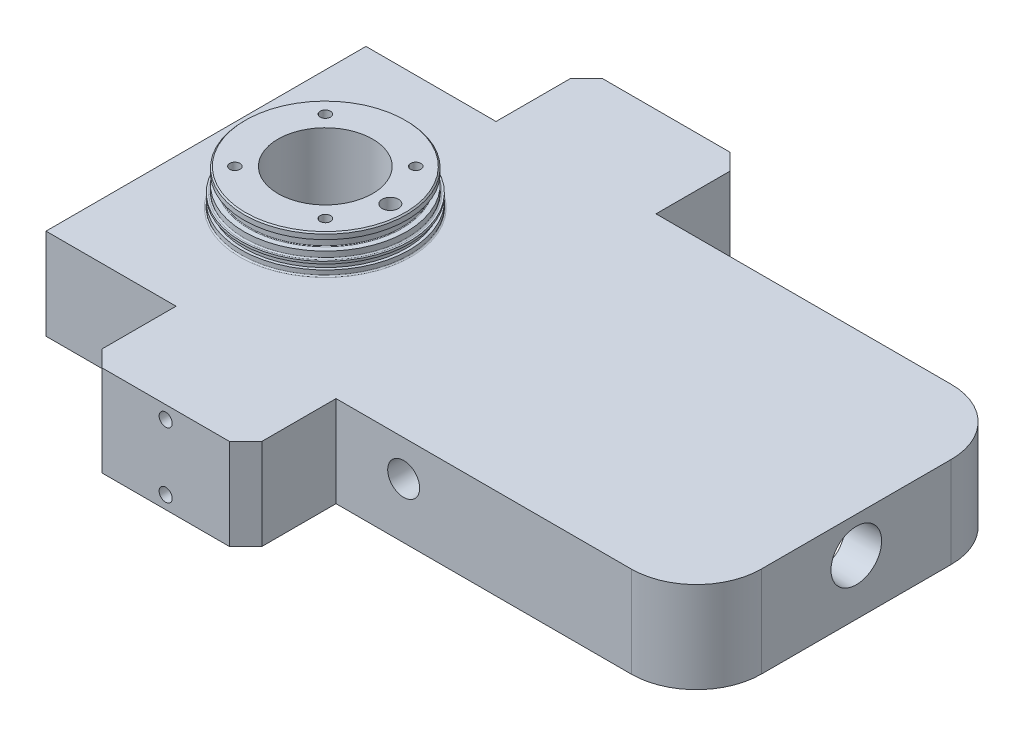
ISO-10303-21;
HEADER;
FILE_DESCRIPTION(('STEP AP214'),'2;1');
FILE_NAME('part.step','',(''),(''),'','','');
FILE_SCHEMA(('AUTOMOTIVE_DESIGN { 1 0 10303 214 1 1 1 1 }'));
ENDSEC;
DATA;
#1=APPLICATION_CONTEXT('core data for automotive mechanical design processes');
#2=APPLICATION_PROTOCOL_DEFINITION('international standard','automotive_design',2000,#1);
#3=PRODUCT_CONTEXT('',#1,'mechanical');
#4=PRODUCT('Part','Part','',(#3));
#5=PRODUCT_RELATED_PRODUCT_CATEGORY('part','',(#4));
#6=PRODUCT_DEFINITION_FORMATION('','',#4);
#7=PRODUCT_DEFINITION_CONTEXT('part definition',#1,'design');
#8=PRODUCT_DEFINITION('design','',#6,#7);
#9=PRODUCT_DEFINITION_SHAPE('','',#8);
#10=(LENGTH_UNIT() NAMED_UNIT(*) SI_UNIT(.MILLI.,.METRE.));
#11=(NAMED_UNIT(*) PLANE_ANGLE_UNIT() SI_UNIT($,.RADIAN.));
#12=(NAMED_UNIT(*) SI_UNIT($,.STERADIAN.) SOLID_ANGLE_UNIT());
#13=UNCERTAINTY_MEASURE_WITH_UNIT(LENGTH_MEASURE(1.E-05),#10,'distance_accuracy_value','');
#14=(GEOMETRIC_REPRESENTATION_CONTEXT(3) GLOBAL_UNCERTAINTY_ASSIGNED_CONTEXT((#13)) GLOBAL_UNIT_ASSIGNED_CONTEXT((#10,
#11,#12)) REPRESENTATION_CONTEXT('',''));
#15=CARTESIAN_POINT('',(0.,0.,0.));
#16=DIRECTION('',(0.,0.,1.));
#17=DIRECTION('',(1.,0.,0.));
#18=AXIS2_PLACEMENT_3D('',#15,#16,#17);
#19=CARTESIAN_POINT('',(46.609,35.56,0.));
#20=DIRECTION('',(0.,1.,0.));
#21=DIRECTION('',(0.,0.,1.));
#22=AXIS2_PLACEMENT_3D('',#19,#20,#21);
#23=CYLINDRICAL_SURFACE('',#22,31.7246);
#24=CARTESIAN_POINT('',(46.609,47.1474916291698,0.));
#25=DIRECTION('',(0.,1.,0.));
#26=DIRECTION('',(0.,0.,1.));
#27=AXIS2_PLACEMENT_3D('',#24,#25,#26);
#28=CIRCLE('',#27,31.7246);
#29=CARTESIAN_POINT('',(46.609,47.1474916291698,31.7246));
#30=VERTEX_POINT('',#29);
#31=EDGE_CURVE('E78',#30,#30,#28,.F.);
#32=ORIENTED_EDGE('',*,*,#31,.F.);
#33=EDGE_LOOP('',(#32));
#34=FACE_BOUND('',#33,.T.);
#35=CARTESIAN_POINT('',(46.609,49.022,0.));
#36=DIRECTION('',(0.,1.,0.));
#37=DIRECTION('',(0.,0.,1.));
#38=AXIS2_PLACEMENT_3D('',#35,#36,#37);
#39=CIRCLE('',#38,31.7246);
#40=CARTESIAN_POINT('',(46.609,49.022,31.7246));
#41=VERTEX_POINT('',#40);
#42=EDGE_CURVE('E614',#41,#41,#39,.F.);
#43=ORIENTED_EDGE('',*,*,#42,.T.);
#44=EDGE_LOOP('',(#43));
#45=FACE_BOUND('',#44,.T.);
#46=ADVANCED_FACE('F74',(#34,#45),#23,.T.);
#47=CARTESIAN_POINT('',(113.284,0.,62.484));
#48=DIRECTION('',(0.,1.,0.));
#49=DIRECTION('',(0.,0.,1.));
#50=AXIS2_PLACEMENT_3D('',#47,#48,#49);
#51=PLANE('',#50);
#52=CARTESIAN_POINT('',(73.5497683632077,0.,26.9407683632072));
#53=DIRECTION('',(0.,-1.,0.));
#54=DIRECTION('',(0.,0.,-1.));
#55=AXIS2_PLACEMENT_3D('',#52,#53,#54);
#56=CIRCLE('',#55,1.89865);
#57=CARTESIAN_POINT('',(73.5497683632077,0.,25.0421183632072));
#58=VERTEX_POINT('',#57);
#59=EDGE_CURVE('E1646',#58,#58,#56,.T.);
#60=ORIENTED_EDGE('',*,*,#59,.F.);
#61=EDGE_LOOP('',(#60));
#62=FACE_BOUND('',#61,.T.);
#63=CARTESIAN_POINT('',(19.6682316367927,0.,26.9407683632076));
#64=DIRECTION('',(0.,-1.,0.));
#65=DIRECTION('',(0.,0.,-1.));
#66=AXIS2_PLACEMENT_3D('',#63,#64,#65);
#67=CIRCLE('',#66,1.89865);
#68=CARTESIAN_POINT('',(19.6682316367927,0.,25.0421183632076));
#69=VERTEX_POINT('',#68);
#70=EDGE_CURVE('E1652',#69,#69,#67,.T.);
#71=ORIENTED_EDGE('',*,*,#70,.F.);
#72=EDGE_LOOP('',(#71));
#73=FACE_BOUND('',#72,.T.);
#74=CARTESIAN_POINT('',(19.6682316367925,0.,-26.9407683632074));
#75=DIRECTION('',(0.,-1.,0.));
#76=DIRECTION('',(0.,0.,-1.));
#77=AXIS2_PLACEMENT_3D('',#74,#75,#76);
#78=CIRCLE('',#77,1.89865);
#79=CARTESIAN_POINT('',(19.6682316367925,0.,-28.8394183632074));
#80=VERTEX_POINT('',#79);
#81=EDGE_CURVE('E1658',#80,#80,#78,.T.);
#82=ORIENTED_EDGE('',*,*,#81,.F.);
#83=EDGE_LOOP('',(#82));
#84=FACE_BOUND('',#83,.T.);
#85=CARTESIAN_POINT('',(73.5497683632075,0.,-26.9407683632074));
#86=DIRECTION('',(0.,-1.,0.));
#87=DIRECTION('',(0.,0.,-1.));
#88=AXIS2_PLACEMENT_3D('',#85,#86,#87);
#89=CIRCLE('',#88,1.89865);
#90=CARTESIAN_POINT('',(73.5497683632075,0.,-28.8394183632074));
#91=VERTEX_POINT('',#90);
#92=EDGE_CURVE('E1664',#91,#91,#89,.T.);
#93=ORIENTED_EDGE('',*,*,#92,.F.);
#94=EDGE_LOOP('',(#93));
#95=FACE_BOUND('',#94,.T.);
#96=CARTESIAN_POINT('',(167.445816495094,0.,34.4841835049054));
#97=DIRECTION('',(0.,-1.,0.));
#98=DIRECTION('',(0.,0.,-1.));
#99=AXIS2_PLACEMENT_3D('',#96,#97,#98);
#100=CIRCLE('',#99,1.35255000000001);
#101=CARTESIAN_POINT('',(167.445816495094,0.,33.1316335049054));
#102=VERTEX_POINT('',#101);
#103=EDGE_CURVE('E1676',#102,#102,#100,.T.);
#104=ORIENTED_EDGE('',*,*,#103,.F.);
#105=EDGE_LOOP('',(#104));
#106=FACE_BOUND('',#105,.T.);
#107=DIRECTION('',(0.,0.,1.));
#108=VECTOR('',#107,1.);
#109=CARTESIAN_POINT('',(50.8,0.,-62.484));
#110=LINE('',#109,#108);
#111=CARTESIAN_POINT('',(50.8,0.,-91.44));
#112=VERTEX_POINT('',#111);
#113=CARTESIAN_POINT('',(50.8,0.,-62.484));
#114=VERTEX_POINT('',#113);
#115=EDGE_CURVE('E542',#112,#114,#110,.T.);
#116=ORIENTED_EDGE('',*,*,#115,.F.);
#117=DIRECTION('',(-0.707106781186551,0.,0.707106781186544));
#118=VECTOR('',#117,1.);
#119=CARTESIAN_POINT('',(50.8,0.,-91.44));
#120=LINE('',#119,#118);
#121=CARTESIAN_POINT('',(57.15,0.,-97.79));
#122=VERTEX_POINT('',#121);
#123=EDGE_CURVE('E464',#112,#122,#120,.F.);
#124=ORIENTED_EDGE('',*,*,#123,.T.);
#125=DIRECTION('',(-1.,0.,0.));
#126=VECTOR('',#125,1.);
#127=CARTESIAN_POINT('',(50.8,0.,-97.79));
#128=LINE('',#127,#126);
#129=CARTESIAN_POINT('',(106.934,0.,-97.79));
#130=VERTEX_POINT('',#129);
#131=EDGE_CURVE('E539',#130,#122,#128,.T.);
#132=ORIENTED_EDGE('',*,*,#131,.F.);
#133=DIRECTION('',(-0.707106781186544,0.,-0.707106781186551));
#134=VECTOR('',#133,1.);
#135=CARTESIAN_POINT('',(106.934,0.,-97.79));
#136=LINE('',#135,#134);
#137=CARTESIAN_POINT('',(113.284,0.,-91.44));
#138=VERTEX_POINT('',#137);
#139=EDGE_CURVE('E462',#130,#138,#136,.F.);
#140=ORIENTED_EDGE('',*,*,#139,.T.);
#141=DIRECTION('',(0.,0.,-1.));
#142=VECTOR('',#141,1.);
#143=CARTESIAN_POINT('',(113.284,0.,-97.79));
#144=LINE('',#143,#142);
#145=CARTESIAN_POINT('',(113.284,0.,-62.484));
#146=VERTEX_POINT('',#145);
#147=EDGE_CURVE('E536',#146,#138,#144,.T.);
#148=ORIENTED_EDGE('',*,*,#147,.F.);
#149=DIRECTION('',(-1.,0.,0.));
#150=VECTOR('',#149,1.);
#151=CARTESIAN_POINT('',(113.284,0.,-62.484));
#152=LINE('',#151,#150);
#153=CARTESIAN_POINT('',(228.6,0.,-62.484));
#154=VERTEX_POINT('',#153);
#155=EDGE_CURVE('E534',#154,#146,#152,.T.);
#156=ORIENTED_EDGE('',*,*,#155,.F.);
#157=CARTESIAN_POINT('',(228.6,0.,-37.084));
#158=DIRECTION('',(0.,1.,0.));
#159=DIRECTION('',(0.,0.,1.));
#160=AXIS2_PLACEMENT_3D('',#157,#158,#159);
#161=CIRCLE('',#160,25.4);
#162=CARTESIAN_POINT('',(254.,0.,-37.084));
#163=VERTEX_POINT('',#162);
#164=EDGE_CURVE('E593',#154,#163,#161,.F.);
#165=ORIENTED_EDGE('',*,*,#164,.T.);
#166=DIRECTION('',(0.,0.,-1.));
#167=VECTOR('',#166,1.);
#168=CARTESIAN_POINT('',(254.,0.,62.484));
#169=LINE('',#168,#167);
#170=CARTESIAN_POINT('',(254.,0.,37.084));
#171=VERTEX_POINT('',#170);
#172=EDGE_CURVE('E531',#171,#163,#169,.T.);
#173=ORIENTED_EDGE('',*,*,#172,.F.);
#174=CARTESIAN_POINT('',(228.6,0.,37.084));
#175=DIRECTION('',(0.,1.,0.));
#176=DIRECTION('',(0.,0.,1.));
#177=AXIS2_PLACEMENT_3D('',#174,#175,#176);
#178=CIRCLE('',#177,25.4);
#179=CARTESIAN_POINT('',(228.6,0.,62.484));
#180=VERTEX_POINT('',#179);
#181=EDGE_CURVE('E591',#171,#180,#178,.F.);
#182=ORIENTED_EDGE('',*,*,#181,.T.);
#183=DIRECTION('',(1.,0.,0.));
#184=VECTOR('',#183,1.);
#185=CARTESIAN_POINT('',(113.284,0.,62.484));
#186=LINE('',#185,#184);
#187=CARTESIAN_POINT('',(113.284,0.,62.484));
#188=VERTEX_POINT('',#187);
#189=EDGE_CURVE('E523',#188,#180,#186,.T.);
#190=ORIENTED_EDGE('',*,*,#189,.F.);
#191=DIRECTION('',(0.,0.,-1.));
#192=VECTOR('',#191,1.);
#193=CARTESIAN_POINT('',(113.284,0.,97.79));
#194=LINE('',#193,#192);
#195=CARTESIAN_POINT('',(113.284,0.,91.4400000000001));
#196=VERTEX_POINT('',#195);
#197=EDGE_CURVE('E521',#196,#188,#194,.T.);
#198=ORIENTED_EDGE('',*,*,#197,.F.);
#199=DIRECTION('',(0.707106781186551,0.,-0.707106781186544));
#200=VECTOR('',#199,1.);
#201=CARTESIAN_POINT('',(113.284,0.,91.4400000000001));
#202=LINE('',#201,#200);
#203=CARTESIAN_POINT('',(106.934,0.,97.79));
#204=VERTEX_POINT('',#203);
#205=EDGE_CURVE('E458',#196,#204,#202,.F.);
#206=ORIENTED_EDGE('',*,*,#205,.T.);
#207=DIRECTION('',(1.,0.,0.));
#208=VECTOR('',#207,1.);
#209=CARTESIAN_POINT('',(50.8,0.,97.79));
#210=LINE('',#209,#208);
#211=CARTESIAN_POINT('',(57.1499999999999,0.,97.79));
#212=VERTEX_POINT('',#211);
#213=EDGE_CURVE('E516',#212,#204,#210,.T.);
#214=ORIENTED_EDGE('',*,*,#213,.F.);
#215=DIRECTION('',(0.707106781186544,0.,0.707106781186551));
#216=VECTOR('',#215,1.);
#217=CARTESIAN_POINT('',(57.1499999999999,0.,97.79));
#218=LINE('',#217,#216);
#219=CARTESIAN_POINT('',(50.8,0.,91.44));
#220=VERTEX_POINT('',#219);
#221=EDGE_CURVE('E460',#212,#220,#218,.F.);
#222=ORIENTED_EDGE('',*,*,#221,.T.);
#223=DIRECTION('',(0.,0.,1.));
#224=VECTOR('',#223,1.);
#225=CARTESIAN_POINT('',(50.8,0.,62.484));
#226=LINE('',#225,#224);
#227=CARTESIAN_POINT('',(50.8,0.,62.484));
#228=VERTEX_POINT('',#227);
#229=EDGE_CURVE('E502',#228,#220,#226,.T.);
#230=ORIENTED_EDGE('',*,*,#229,.F.);
#231=DIRECTION('',(1.,0.,0.));
#232=VECTOR('',#231,1.);
#233=CARTESIAN_POINT('',(0.,0.,62.484));
#234=LINE('',#233,#232);
#235=CARTESIAN_POINT('',(0.,0.,62.484));
#236=VERTEX_POINT('',#235);
#237=EDGE_CURVE('E525',#236,#228,#234,.T.);
#238=ORIENTED_EDGE('',*,*,#237,.F.);
#239=DIRECTION('',(0.,0.,1.));
#240=VECTOR('',#239,1.);
#241=CARTESIAN_POINT('',(0.,0.,-62.484));
#242=LINE('',#241,#240);
#243=CARTESIAN_POINT('',(0.,0.,-62.484));
#244=VERTEX_POINT('',#243);
#245=EDGE_CURVE('E546',#244,#236,#242,.T.);
#246=ORIENTED_EDGE('',*,*,#245,.F.);
#247=DIRECTION('',(-1.,0.,0.));
#248=VECTOR('',#247,1.);
#249=CARTESIAN_POINT('',(0.,0.,-62.484));
#250=LINE('',#249,#248);
#251=EDGE_CURVE('E544',#114,#244,#250,.T.);
#252=ORIENTED_EDGE('',*,*,#251,.F.);
#253=EDGE_LOOP('',(#116,#124,#132,#140,#148,#156,#165,#173,#182,#190,#198,#206,#214,#222,#230,
#238,#246,#252));
#254=FACE_BOUND('',#253,.T.);
#255=CARTESIAN_POINT('',(46.609,0.,0.));
#256=DIRECTION('',(0.,1.,0.));
#257=DIRECTION('',(0.,0.,1.));
#258=AXIS2_PLACEMENT_3D('',#255,#256,#257);
#259=CIRCLE('',#258,6.731);
#260=CARTESIAN_POINT('',(46.609,0.,6.731));
#261=VERTEX_POINT('',#260);
#262=EDGE_CURVE('E742',#261,#261,#259,.T.);
#263=ORIENTED_EDGE('',*,*,#262,.T.);
#264=EDGE_LOOP('',(#263));
#265=FACE_BOUND('',#264,.T.);
#266=CARTESIAN_POINT('',(201.93,0.,0.));
#267=DIRECTION('',(0.,1.,0.));
#268=DIRECTION('',(0.,0.,1.));
#269=AXIS2_PLACEMENT_3D('',#266,#267,#268);
#270=CIRCLE('',#269,40.9575);
#271=CARTESIAN_POINT('',(201.93,0.,40.9575));
#272=VERTEX_POINT('',#271);
#273=EDGE_CURVE('E432',#272,#272,#270,.T.);
#274=ORIENTED_EDGE('',*,*,#273,.T.);
#275=EDGE_LOOP('',(#274));
#276=FACE_BOUND('',#275,.T.);
#277=CARTESIAN_POINT('',(236.414183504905,0.,-34.4841835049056));
#278=DIRECTION('',(0.,-1.,0.));
#279=DIRECTION('',(0.,0.,-1.));
#280=AXIS2_PLACEMENT_3D('',#277,#278,#279);
#281=CIRCLE('',#280,1.35255000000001);
#282=CARTESIAN_POINT('',(236.414183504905,0.,-35.8367335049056));
#283=VERTEX_POINT('',#282);
#284=EDGE_CURVE('E703',#283,#283,#281,.T.);
#285=ORIENTED_EDGE('',*,*,#284,.F.);
#286=EDGE_LOOP('',(#285));
#287=FACE_BOUND('',#286,.T.);
#288=CARTESIAN_POINT('',(236.414183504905,0.,34.4841835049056));
#289=DIRECTION('',(0.,-1.,0.));
#290=DIRECTION('',(0.,0.,-1.));
#291=AXIS2_PLACEMENT_3D('',#288,#289,#290);
#292=CIRCLE('',#291,1.35255000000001);
#293=CARTESIAN_POINT('',(236.414183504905,0.,33.1316335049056));
#294=VERTEX_POINT('',#293);
#295=EDGE_CURVE('E1682',#294,#294,#292,.T.);
#296=ORIENTED_EDGE('',*,*,#295,.F.);
#297=EDGE_LOOP('',(#296));
#298=FACE_BOUND('',#297,.T.);
#299=CARTESIAN_POINT('',(167.445816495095,0.,-34.4841835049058));
#300=DIRECTION('',(0.,-1.,0.));
#301=DIRECTION('',(0.,0.,-1.));
#302=AXIS2_PLACEMENT_3D('',#299,#300,#301);
#303=CIRCLE('',#302,1.35255000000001);
#304=CARTESIAN_POINT('',(167.445816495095,0.,-35.8367335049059));
#305=VERTEX_POINT('',#304);
#306=EDGE_CURVE('E1670',#305,#305,#303,.T.);
#307=ORIENTED_EDGE('',*,*,#306,.F.);
#308=EDGE_LOOP('',(#307));
#309=FACE_BOUND('',#308,.T.);
#310=ADVANCED_FACE('F398',(#62,#73,#84,#95,#106,#254,#265,#276,#287,#298,#309),#51,.F.);
#311=CARTESIAN_POINT('',(46.609,35.56,0.));
#312=DIRECTION('',(0.,1.,0.));
#313=DIRECTION('',(0.,0.,1.));
#314=AXIS2_PLACEMENT_3D('',#311,#312,#313);
#315=CYLINDRICAL_SURFACE('',#314,32.893);
#316=CARTESIAN_POINT('',(46.609,36.068,0.));
#317=DIRECTION('',(0.,1.,0.));
#318=DIRECTION('',(0.,0.,1.));
#319=AXIS2_PLACEMENT_3D('',#316,#317,#318);
#320=CIRCLE('',#319,32.893);
#321=CARTESIAN_POINT('',(46.609,36.068,32.893));
#322=VERTEX_POINT('',#321);
#323=EDGE_CURVE('E435',#322,#322,#320,.T.);
#324=ORIENTED_EDGE('',*,*,#323,.T.);
#325=EDGE_LOOP('',(#324));
#326=FACE_BOUND('',#325,.T.);
#327=CARTESIAN_POINT('',(46.609,37.719,0.));
#328=DIRECTION('',(0.,-1.,0.));
#329=DIRECTION('',(0.,0.,-1.));
#330=AXIS2_PLACEMENT_3D('',#327,#328,#329);
#331=CIRCLE('',#330,32.893);
#332=CARTESIAN_POINT('',(46.609,37.719,-32.893));
#333=VERTEX_POINT('',#332);
#334=EDGE_CURVE('E441',#333,#333,#331,.F.);
#335=ORIENTED_EDGE('',*,*,#334,.F.);
#336=EDGE_LOOP('',(#335));
#337=FACE_BOUND('',#336,.T.);
#338=ADVANCED_FACE('F405',(#326,#337),#315,.T.);
#339=CARTESIAN_POINT('',(46.609,0.,0.));
#340=DIRECTION('',(0.,1.,0.));
#341=DIRECTION('',(0.,0.,1.));
#342=AXIS2_PLACEMENT_3D('',#339,#340,#341);
#343=CYLINDRICAL_SURFACE('',#342,6.731);
#344=ORIENTED_EDGE('',*,*,#262,.F.);
#345=EDGE_LOOP('',(#344));
#346=FACE_BOUND('',#345,.T.);
#347=CARTESIAN_POINT('',(46.609,5.588,0.));
#348=DIRECTION('',(0.,1.,0.));
#349=DIRECTION('',(0.,0.,1.));
#350=AXIS2_PLACEMENT_3D('',#347,#348,#349);
#351=CIRCLE('',#350,6.731);
#352=CARTESIAN_POINT('',(46.609,5.588,6.731));
#353=VERTEX_POINT('',#352);
#354=EDGE_CURVE('E607',#353,#353,#351,.F.);
#355=ORIENTED_EDGE('',*,*,#354,.F.);
#356=EDGE_LOOP('',(#355));
#357=FACE_BOUND('',#356,.T.);
#358=ADVANCED_FACE('F724',(#346,#357),#343,.F.);
#359=CARTESIAN_POINT('',(46.609,49.53,0.));
#360=DIRECTION('',(0.,1.,0.));
#361=DIRECTION('',(0.,0.,1.));
#362=AXIS2_PLACEMENT_3D('',#359,#360,#361);
#363=PLANE('',#362);
#364=CARTESIAN_POINT('',(28.9538164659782,49.53,17.6551835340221));
#365=DIRECTION('',(0.,1.,0.));
#366=DIRECTION('',(0.,0.,1.));
#367=AXIS2_PLACEMENT_3D('',#364,#365,#366);
#368=CIRCLE('',#367,2.0193);
#369=CARTESIAN_POINT('',(28.9538164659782,49.53,19.6744835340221));
#370=VERTEX_POINT('',#369);
#371=EDGE_CURVE('E279',#370,#370,#368,.T.);
#372=ORIENTED_EDGE('',*,*,#371,.F.);
#373=EDGE_LOOP('',(#372));
#374=FACE_BOUND('',#373,.T.);
#375=CARTESIAN_POINT('',(28.9538164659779,49.53,-17.6551835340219));
#376=DIRECTION('',(0.,1.,0.));
#377=DIRECTION('',(0.,0.,1.));
#378=AXIS2_PLACEMENT_3D('',#375,#376,#377);
#379=CIRCLE('',#378,2.0193);
#380=CARTESIAN_POINT('',(28.9538164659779,49.53,-15.6358835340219));
#381=VERTEX_POINT('',#380);
#382=EDGE_CURVE('E287',#381,#381,#379,.T.);
#383=ORIENTED_EDGE('',*,*,#382,.F.);
#384=EDGE_LOOP('',(#383));
#385=FACE_BOUND('',#384,.T.);
#386=CARTESIAN_POINT('',(64.2641835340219,49.53,-17.655183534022));
#387=DIRECTION('',(0.,1.,0.));
#388=DIRECTION('',(0.,0.,1.));
#389=AXIS2_PLACEMENT_3D('',#386,#387,#388);
#390=CIRCLE('',#389,2.0193);
#391=CARTESIAN_POINT('',(64.2641835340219,49.53,-15.635883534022));
#392=VERTEX_POINT('',#391);
#393=EDGE_CURVE('E293',#392,#392,#390,.T.);
#394=ORIENTED_EDGE('',*,*,#393,.F.);
#395=EDGE_LOOP('',(#394));
#396=FACE_BOUND('',#395,.T.);
#397=CARTESIAN_POINT('',(64.2641835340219,49.53,17.655183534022));
#398=DIRECTION('',(0.,1.,0.));
#399=DIRECTION('',(0.,0.,1.));
#400=AXIS2_PLACEMENT_3D('',#397,#398,#399);
#401=CIRCLE('',#400,2.0193);
#402=CARTESIAN_POINT('',(64.2641835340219,49.53,19.674483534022));
#403=VERTEX_POINT('',#402);
#404=EDGE_CURVE('E299',#403,#403,#401,.T.);
#405=ORIENTED_EDGE('',*,*,#404,.F.);
#406=EDGE_LOOP('',(#405));
#407=FACE_BOUND('',#406,.T.);
#408=CARTESIAN_POINT('',(72.009,49.53,0.));
#409=DIRECTION('',(0.,1.,0.));
#410=DIRECTION('',(0.,0.,1.));
#411=AXIS2_PLACEMENT_3D('',#408,#409,#410);
#412=CIRCLE('',#411,3.17499999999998);
#413=CARTESIAN_POINT('',(72.009,49.53,3.17499999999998));
#414=VERTEX_POINT('',#413);
#415=EDGE_CURVE('E653',#414,#414,#412,.T.);
#416=ORIENTED_EDGE('',*,*,#415,.F.);
#417=EDGE_LOOP('',(#416));
#418=FACE_BOUND('',#417,.T.);
#419=CARTESIAN_POINT('',(46.609,49.53,0.));
#420=DIRECTION('',(0.,1.,0.));
#421=DIRECTION('',(0.,0.,1.));
#422=AXIS2_PLACEMENT_3D('',#419,#420,#421);
#423=CIRCLE('',#422,31.2166);
#424=CARTESIAN_POINT('',(46.609,49.53,31.2166));
#425=VERTEX_POINT('',#424);
#426=EDGE_CURVE('E606',#425,#425,#423,.T.);
#427=ORIENTED_EDGE('',*,*,#426,.T.);
#428=EDGE_LOOP('',(#427));
#429=FACE_BOUND('',#428,.T.);
#430=CARTESIAN_POINT('',(46.609,49.53,0.));
#431=DIRECTION('',(0.,1.,0.));
#432=DIRECTION('',(0.,0.,1.));
#433=AXIS2_PLACEMENT_3D('',#430,#431,#432);
#434=CIRCLE('',#433,18.4785);
#435=CARTESIAN_POINT('',(46.609,49.53,18.4785));
#436=VERTEX_POINT('',#435);
#437=EDGE_CURVE('E611',#436,#436,#434,.T.);
#438=ORIENTED_EDGE('',*,*,#437,.F.);
#439=EDGE_LOOP('',(#438));
#440=FACE_BOUND('',#439,.T.);
#441=ADVANCED_FACE('F721',(#374,#385,#396,#407,#418,#429,#440),#363,.T.);
#442=CARTESIAN_POINT('',(0.,35.56,62.484));
#443=DIRECTION('',(0.,0.,-1.));
#444=DIRECTION('',(-1.,0.,0.));
#445=AXIS2_PLACEMENT_3D('',#442,#443,#444);
#446=PLANE('',#445);
#447=ORIENTED_EDGE('',*,*,#237,.T.);
#448=DIRECTION('',(0.,-1.,0.));
#449=VECTOR('',#448,1.);
#450=CARTESIAN_POINT('',(50.8,35.56,62.484));
#451=LINE('',#450,#449);
#452=CARTESIAN_POINT('',(50.8,35.56,62.484));
#453=VERTEX_POINT('',#452);
#454=EDGE_CURVE('E586',#453,#228,#451,.T.);
#455=ORIENTED_EDGE('',*,*,#454,.F.);
#456=DIRECTION('',(1.,0.,0.));
#457=VECTOR('',#456,1.);
#458=CARTESIAN_POINT('',(0.,35.56,62.484));
#459=LINE('',#458,#457);
#460=CARTESIAN_POINT('',(0.,35.56,62.484));
#461=VERTEX_POINT('',#460);
#462=EDGE_CURVE('E508',#461,#453,#459,.T.);
#463=ORIENTED_EDGE('',*,*,#462,.F.);
#464=DIRECTION('',(0.,-1.,0.));
#465=VECTOR('',#464,1.);
#466=CARTESIAN_POINT('',(0.,35.56,62.484));
#467=LINE('',#466,#465);
#468=EDGE_CURVE('E571',#461,#236,#467,.T.);
#469=ORIENTED_EDGE('',*,*,#468,.T.);
#470=EDGE_LOOP('',(#447,#455,#463,#469));
#471=FACE_BOUND('',#470,.T.);
#472=ADVANCED_FACE('F76',(#471),#446,.F.);
#473=CARTESIAN_POINT('',(50.8,35.56,62.484));
#474=DIRECTION('',(1.,0.,0.));
#475=DIRECTION('',(0.,0.,-1.));
#476=AXIS2_PLACEMENT_3D('',#473,#474,#475);
#477=PLANE('',#476);
#478=ORIENTED_EDGE('',*,*,#229,.T.);
#479=DIRECTION('',(0.,1.,0.));
#480=VECTOR('',#479,1.);
#481=CARTESIAN_POINT('',(50.8,35.56,91.44));
#482=LINE('',#481,#480);
#483=CARTESIAN_POINT('',(50.8,35.56,91.44));
#484=VERTEX_POINT('',#483);
#485=EDGE_CURVE('E83',#220,#484,#482,.T.);
#486=ORIENTED_EDGE('',*,*,#485,.T.);
#487=DIRECTION('',(0.,0.,1.));
#488=VECTOR('',#487,1.);
#489=CARTESIAN_POINT('',(50.8,35.56,62.484));
#490=LINE('',#489,#488);
#491=EDGE_CURVE('E500',#453,#484,#490,.T.);
#492=ORIENTED_EDGE('',*,*,#491,.F.);
#493=ORIENTED_EDGE('',*,*,#454,.T.);
#494=EDGE_LOOP('',(#478,#486,#492,#493));
#495=FACE_BOUND('',#494,.T.);
#496=ADVANCED_FACE('F498',(#495),#477,.F.);
#497=CARTESIAN_POINT('',(50.8,35.56,97.79));
#498=DIRECTION('',(0.,0.,-1.));
#499=DIRECTION('',(-1.,0.,0.));
#500=AXIS2_PLACEMENT_3D('',#497,#498,#499);
#501=PLANE('',#500);
#502=CARTESIAN_POINT('',(82.042,30.48,97.79));
#503=DIRECTION('',(0.,0.,1.));
#504=DIRECTION('',(1.,0.,0.));
#505=AXIS2_PLACEMENT_3D('',#502,#503,#504);
#506=CIRCLE('',#505,2.55270000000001);
#507=CARTESIAN_POINT('',(84.5947,30.48,97.79));
#508=VERTEX_POINT('',#507);
#509=EDGE_CURVE('E1634',#508,#508,#506,.T.);
#510=ORIENTED_EDGE('',*,*,#509,.F.);
#511=EDGE_LOOP('',(#510));
#512=FACE_BOUND('',#511,.T.);
#513=CARTESIAN_POINT('',(82.042,5.07999999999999,97.79));
#514=DIRECTION('',(0.,0.,1.));
#515=DIRECTION('',(1.,0.,0.));
#516=AXIS2_PLACEMENT_3D('',#513,#514,#515);
#517=CIRCLE('',#516,2.55270000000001);
#518=CARTESIAN_POINT('',(84.5947,5.07999999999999,97.79));
#519=VERTEX_POINT('',#518);
#520=EDGE_CURVE('E1640',#519,#519,#517,.T.);
#521=ORIENTED_EDGE('',*,*,#520,.F.);
#522=EDGE_LOOP('',(#521));
#523=FACE_BOUND('',#522,.T.);
#524=DIRECTION('',(1.,0.,0.));
#525=VECTOR('',#524,1.);
#526=CARTESIAN_POINT('',(50.8,35.56,97.79));
#527=LINE('',#526,#525);
#528=CARTESIAN_POINT('',(57.1499999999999,35.56,97.79));
#529=VERTEX_POINT('',#528);
#530=CARTESIAN_POINT('',(106.934,35.56,97.79));
#531=VERTEX_POINT('',#530);
#532=EDGE_CURVE('E510',#529,#531,#527,.T.);
#533=ORIENTED_EDGE('',*,*,#532,.F.);
#534=DIRECTION('',(0.,-1.,0.));
#535=VECTOR('',#534,1.);
#536=CARTESIAN_POINT('',(57.1499999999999,35.56,97.79));
#537=LINE('',#536,#535);
#538=EDGE_CURVE('E481',#529,#212,#537,.T.);
#539=ORIENTED_EDGE('',*,*,#538,.T.);
#540=ORIENTED_EDGE('',*,*,#213,.T.);
#541=DIRECTION('',(0.,1.,0.));
#542=VECTOR('',#541,1.);
#543=CARTESIAN_POINT('',(106.934,35.56,97.79));
#544=LINE('',#543,#542);
#545=EDGE_CURVE('E99',#204,#531,#544,.T.);
#546=ORIENTED_EDGE('',*,*,#545,.T.);
#547=EDGE_LOOP('',(#533,#539,#540,#546));
#548=FACE_BOUND('',#547,.T.);
#549=ADVANCED_FACE('F515',(#512,#523,#548),#501,.F.);
#550=CARTESIAN_POINT('',(113.284,35.56,97.79));
#551=DIRECTION('',(-1.,0.,0.));
#552=DIRECTION('',(0.,0.,1.));
#553=AXIS2_PLACEMENT_3D('',#550,#551,#552);
#554=PLANE('',#553);
#555=DIRECTION('',(0.,0.,-1.));
#556=VECTOR('',#555,1.);
#557=CARTESIAN_POINT('',(113.284,35.56,97.79));
#558=LINE('',#557,#556);
#559=CARTESIAN_POINT('',(113.284,35.56,91.4400000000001));
#560=VERTEX_POINT('',#559);
#561=CARTESIAN_POINT('',(113.284,35.56,62.484));
#562=VERTEX_POINT('',#561);
#563=EDGE_CURVE('E550',#560,#562,#558,.T.);
#564=ORIENTED_EDGE('',*,*,#563,.F.);
#565=DIRECTION('',(0.,-1.,0.));
#566=VECTOR('',#565,1.);
#567=CARTESIAN_POINT('',(113.284,35.56,91.4400000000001));
#568=LINE('',#567,#566);
#569=EDGE_CURVE('E13',#560,#196,#568,.T.);
#570=ORIENTED_EDGE('',*,*,#569,.T.);
#571=ORIENTED_EDGE('',*,*,#197,.T.);
#572=DIRECTION('',(0.,-1.,0.));
#573=VECTOR('',#572,1.);
#574=CARTESIAN_POINT('',(113.284,35.56,62.484));
#575=LINE('',#574,#573);
#576=EDGE_CURVE('E583',#562,#188,#575,.T.);
#577=ORIENTED_EDGE('',*,*,#576,.F.);
#578=EDGE_LOOP('',(#564,#570,#571,#577));
#579=FACE_BOUND('',#578,.T.);
#580=ADVANCED_FACE('F804',(#579),#554,.F.);
#581=CARTESIAN_POINT('',(113.284,35.56,62.484));
#582=DIRECTION('',(0.,0.,-1.));
#583=DIRECTION('',(-1.,0.,0.));
#584=AXIS2_PLACEMENT_3D('',#581,#582,#583);
#585=PLANE('',#584);
#586=CARTESIAN_POINT('',(139.7,21.59,62.484));
#587=DIRECTION('',(0.,0.,1.));
#588=DIRECTION('',(1.,0.,0.));
#589=AXIS2_PLACEMENT_3D('',#586,#587,#588);
#590=CIRCLE('',#589,6.24028470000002);
#591=CARTESIAN_POINT('',(145.9402847,21.59,62.484));
#592=VERTEX_POINT('',#591);
#593=EDGE_CURVE('E315',#592,#592,#590,.T.);
#594=ORIENTED_EDGE('',*,*,#593,.F.);
#595=EDGE_LOOP('',(#594));
#596=FACE_BOUND('',#595,.T.);
#597=ORIENTED_EDGE('',*,*,#189,.T.);
#598=DIRECTION('',(0.,-1.,0.));
#599=VECTOR('',#598,1.);
#600=CARTESIAN_POINT('',(228.6,35.56,62.484));
#601=LINE('',#600,#599);
#602=CARTESIAN_POINT('',(228.6,35.56,62.484));
#603=VERTEX_POINT('',#602);
#604=EDGE_CURVE('E604',#180,#603,#601,.F.);
#605=ORIENTED_EDGE('',*,*,#604,.T.);
#606=DIRECTION('',(1.,0.,0.));
#607=VECTOR('',#606,1.);
#608=CARTESIAN_POINT('',(113.284,35.56,62.484));
#609=LINE('',#608,#607);
#610=EDGE_CURVE('E552',#562,#603,#609,.T.);
#611=ORIENTED_EDGE('',*,*,#610,.F.);
#612=ORIENTED_EDGE('',*,*,#576,.T.);
#613=EDGE_LOOP('',(#597,#605,#611,#612));
#614=FACE_BOUND('',#613,.T.);
#615=ADVANCED_FACE('F800',(#596,#614),#585,.F.);
#616=CARTESIAN_POINT('',(254.,35.56,62.484));
#617=DIRECTION('',(-1.,0.,0.));
#618=DIRECTION('',(0.,0.,1.));
#619=AXIS2_PLACEMENT_3D('',#616,#617,#618);
#620=PLANE('',#619);
#621=CARTESIAN_POINT('',(254.,21.59,0.));
#622=DIRECTION('',(1.,0.,0.));
#623=DIRECTION('',(0.,0.,-1.));
#624=AXIS2_PLACEMENT_3D('',#621,#622,#623);
#625=CIRCLE('',#624,9.8827971);
#626=CARTESIAN_POINT('',(254.,21.59,-9.8827971));
#627=VERTEX_POINT('',#626);
#628=EDGE_CURVE('E696',#627,#627,#625,.T.);
#629=ORIENTED_EDGE('',*,*,#628,.F.);
#630=EDGE_LOOP('',(#629));
#631=FACE_BOUND('',#630,.T.);
#632=ORIENTED_EDGE('',*,*,#172,.T.);
#633=DIRECTION('',(0.,-1.,0.));
#634=VECTOR('',#633,1.);
#635=CARTESIAN_POINT('',(254.,35.56,-37.084));
#636=LINE('',#635,#634);
#637=CARTESIAN_POINT('',(254.,35.56,-37.084));
#638=VERTEX_POINT('',#637);
#639=EDGE_CURVE('E598',#163,#638,#636,.F.);
#640=ORIENTED_EDGE('',*,*,#639,.T.);
#641=DIRECTION('',(0.,0.,-1.));
#642=VECTOR('',#641,1.);
#643=CARTESIAN_POINT('',(254.,35.56,62.484));
#644=LINE('',#643,#642);
#645=CARTESIAN_POINT('',(254.,35.56,37.084));
#646=VERTEX_POINT('',#645);
#647=EDGE_CURVE('E555',#646,#638,#644,.T.);
#648=ORIENTED_EDGE('',*,*,#647,.F.);
#649=DIRECTION('',(0.,-1.,0.));
#650=VECTOR('',#649,1.);
#651=CARTESIAN_POINT('',(254.,35.56,37.084));
#652=LINE('',#651,#650);
#653=EDGE_CURVE('E595',#646,#171,#652,.T.);
#654=ORIENTED_EDGE('',*,*,#653,.T.);
#655=EDGE_LOOP('',(#632,#640,#648,#654));
#656=FACE_BOUND('',#655,.T.);
#657=ADVANCED_FACE('F789',(#631,#656),#620,.F.);
#658=CARTESIAN_POINT('',(113.284,35.56,-62.484));
#659=DIRECTION('',(0.,0.,1.));
#660=DIRECTION('',(1.,0.,0.));
#661=AXIS2_PLACEMENT_3D('',#658,#659,#660);
#662=PLANE('',#661);
#663=CARTESIAN_POINT('',(139.7,21.59,-62.484));
#664=DIRECTION('',(0.,0.,-1.));
#665=DIRECTION('',(-1.,0.,0.));
#666=AXIS2_PLACEMENT_3D('',#663,#664,#665);
#667=CIRCLE('',#666,6.24028470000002);
#668=CARTESIAN_POINT('',(133.4597153,21.59,-62.484));
#669=VERTEX_POINT('',#668);
#670=EDGE_CURVE('E331',#669,#669,#667,.T.);
#671=ORIENTED_EDGE('',*,*,#670,.F.);
#672=EDGE_LOOP('',(#671));
#673=FACE_BOUND('',#672,.T.);
#674=DIRECTION('',(-1.,0.,0.));
#675=VECTOR('',#674,1.);
#676=CARTESIAN_POINT('',(113.284,35.56,-62.484));
#677=LINE('',#676,#675);
#678=CARTESIAN_POINT('',(228.6,35.56,-62.484));
#679=VERTEX_POINT('',#678);
#680=CARTESIAN_POINT('',(113.284,35.56,-62.484));
#681=VERTEX_POINT('',#680);
#682=EDGE_CURVE('E558',#679,#681,#677,.T.);
#683=ORIENTED_EDGE('',*,*,#682,.F.);
#684=DIRECTION('',(0.,-1.,0.));
#685=VECTOR('',#684,1.);
#686=CARTESIAN_POINT('',(228.6,35.56,-62.484));
#687=LINE('',#686,#685);
#688=EDGE_CURVE('E588',#679,#154,#687,.T.);
#689=ORIENTED_EDGE('',*,*,#688,.T.);
#690=ORIENTED_EDGE('',*,*,#155,.T.);
#691=DIRECTION('',(0.,-1.,0.));
#692=VECTOR('',#691,1.);
#693=CARTESIAN_POINT('',(113.284,35.56,-62.484));
#694=LINE('',#693,#692);
#695=EDGE_CURVE('E580',#681,#146,#694,.T.);
#696=ORIENTED_EDGE('',*,*,#695,.F.);
#697=EDGE_LOOP('',(#683,#689,#690,#696));
#698=FACE_BOUND('',#697,.T.);
#699=ADVANCED_FACE('F783',(#673,#698),#662,.F.);
#700=CARTESIAN_POINT('',(113.284,35.56,-97.79));
#701=DIRECTION('',(-1.,0.,0.));
#702=DIRECTION('',(0.,0.,1.));
#703=AXIS2_PLACEMENT_3D('',#700,#701,#702);
#704=PLANE('',#703);
#705=ORIENTED_EDGE('',*,*,#147,.T.);
#706=DIRECTION('',(0.,1.,0.));
#707=VECTOR('',#706,1.);
#708=CARTESIAN_POINT('',(113.284,35.56,-91.44));
#709=LINE('',#708,#707);
#710=CARTESIAN_POINT('',(113.284,35.56,-91.44));
#711=VERTEX_POINT('',#710);
#712=EDGE_CURVE('E478',#138,#711,#709,.T.);
#713=ORIENTED_EDGE('',*,*,#712,.T.);
#714=DIRECTION('',(0.,0.,-1.));
#715=VECTOR('',#714,1.);
#716=CARTESIAN_POINT('',(113.284,35.56,-97.79));
#717=LINE('',#716,#715);
#718=EDGE_CURVE('E560',#681,#711,#717,.T.);
#719=ORIENTED_EDGE('',*,*,#718,.F.);
#720=ORIENTED_EDGE('',*,*,#695,.T.);
#721=EDGE_LOOP('',(#705,#713,#719,#720));
#722=FACE_BOUND('',#721,.T.);
#723=ADVANCED_FACE('F778',(#722),#704,.F.);
#724=CARTESIAN_POINT('',(50.8,35.56,-97.79));
#725=DIRECTION('',(0.,0.,1.));
#726=DIRECTION('',(1.,0.,0.));
#727=AXIS2_PLACEMENT_3D('',#724,#725,#726);
#728=PLANE('',#727);
#729=CARTESIAN_POINT('',(82.042,5.07999999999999,-97.79));
#730=DIRECTION('',(0.,0.,-1.));
#731=DIRECTION('',(-1.,0.,0.));
#732=AXIS2_PLACEMENT_3D('',#729,#730,#731);
#733=CIRCLE('',#732,2.55269999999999);
#734=CARTESIAN_POINT('',(79.4893,5.07999999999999,-97.79));
#735=VERTEX_POINT('',#734);
#736=EDGE_CURVE('E1622',#735,#735,#733,.T.);
#737=ORIENTED_EDGE('',*,*,#736,.F.);
#738=EDGE_LOOP('',(#737));
#739=FACE_BOUND('',#738,.T.);
#740=CARTESIAN_POINT('',(82.042,30.48,-97.79));
#741=DIRECTION('',(0.,0.,-1.));
#742=DIRECTION('',(-1.,0.,0.));
#743=AXIS2_PLACEMENT_3D('',#740,#741,#742);
#744=CIRCLE('',#743,2.55269999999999);
#745=CARTESIAN_POINT('',(79.4893,30.48,-97.79));
#746=VERTEX_POINT('',#745);
#747=EDGE_CURVE('E1628',#746,#746,#744,.T.);
#748=ORIENTED_EDGE('',*,*,#747,.F.);
#749=EDGE_LOOP('',(#748));
#750=FACE_BOUND('',#749,.T.);
#751=ORIENTED_EDGE('',*,*,#131,.T.);
#752=DIRECTION('',(0.,1.,0.));
#753=VECTOR('',#752,1.);
#754=CARTESIAN_POINT('',(57.15,35.56,-97.79));
#755=LINE('',#754,#753);
#756=CARTESIAN_POINT('',(57.15,35.56,-97.79));
#757=VERTEX_POINT('',#756);
#758=EDGE_CURVE('E469',#122,#757,#755,.T.);
#759=ORIENTED_EDGE('',*,*,#758,.T.);
#760=DIRECTION('',(-1.,0.,0.));
#761=VECTOR('',#760,1.);
#762=CARTESIAN_POINT('',(50.8,35.56,-97.79));
#763=LINE('',#762,#761);
#764=CARTESIAN_POINT('',(106.934,35.56,-97.79));
#765=VERTEX_POINT('',#764);
#766=EDGE_CURVE('E563',#765,#757,#763,.T.);
#767=ORIENTED_EDGE('',*,*,#766,.F.);
#768=DIRECTION('',(0.,-1.,0.));
#769=VECTOR('',#768,1.);
#770=CARTESIAN_POINT('',(106.934,35.56,-97.79));
#771=LINE('',#770,#769);
#772=EDGE_CURVE('E466',#765,#130,#771,.T.);
#773=ORIENTED_EDGE('',*,*,#772,.T.);
#774=EDGE_LOOP('',(#751,#759,#767,#773));
#775=FACE_BOUND('',#774,.T.);
#776=ADVANCED_FACE('F766',(#739,#750,#775),#728,.F.);
#777=CARTESIAN_POINT('',(50.8,35.56,-62.484));
#778=DIRECTION('',(1.,0.,0.));
#779=DIRECTION('',(0.,0.,-1.));
#780=AXIS2_PLACEMENT_3D('',#777,#778,#779);
#781=PLANE('',#780);
#782=DIRECTION('',(0.,0.,1.));
#783=VECTOR('',#782,1.);
#784=CARTESIAN_POINT('',(50.8,35.56,-62.484));
#785=LINE('',#784,#783);
#786=CARTESIAN_POINT('',(50.8,35.56,-91.4400000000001));
#787=VERTEX_POINT('',#786);
#788=CARTESIAN_POINT('',(50.8,35.56,-62.484));
#789=VERTEX_POINT('',#788);
#790=EDGE_CURVE('E565',#787,#789,#785,.T.);
#791=ORIENTED_EDGE('',*,*,#790,.F.);
#792=DIRECTION('',(0.,-1.,0.));
#793=VECTOR('',#792,1.);
#794=CARTESIAN_POINT('',(50.8,35.56,-91.44));
#795=LINE('',#794,#793);
#796=EDGE_CURVE('E455',#787,#112,#795,.T.);
#797=ORIENTED_EDGE('',*,*,#796,.T.);
#798=ORIENTED_EDGE('',*,*,#115,.T.);
#799=DIRECTION('',(0.,-1.,0.));
#800=VECTOR('',#799,1.);
#801=CARTESIAN_POINT('',(50.8,35.56,-62.484));
#802=LINE('',#801,#800);
#803=EDGE_CURVE('E577',#789,#114,#802,.T.);
#804=ORIENTED_EDGE('',*,*,#803,.F.);
#805=EDGE_LOOP('',(#791,#797,#798,#804));
#806=FACE_BOUND('',#805,.T.);
#807=ADVANCED_FACE('F760',(#806),#781,.F.);
#808=CARTESIAN_POINT('',(0.,35.56,-62.484));
#809=DIRECTION('',(0.,0.,1.));
#810=DIRECTION('',(1.,0.,0.));
#811=AXIS2_PLACEMENT_3D('',#808,#809,#810);
#812=PLANE('',#811);
#813=ORIENTED_EDGE('',*,*,#251,.T.);
#814=DIRECTION('',(0.,-1.,0.));
#815=VECTOR('',#814,1.);
#816=CARTESIAN_POINT('',(0.,35.56,-62.484));
#817=LINE('',#816,#815);
#818=CARTESIAN_POINT('',(0.,35.56,-62.484));
#819=VERTEX_POINT('',#818);
#820=EDGE_CURVE('E574',#819,#244,#817,.T.);
#821=ORIENTED_EDGE('',*,*,#820,.F.);
#822=DIRECTION('',(-1.,0.,0.));
#823=VECTOR('',#822,1.);
#824=CARTESIAN_POINT('',(0.,35.56,-62.484));
#825=LINE('',#824,#823);
#826=EDGE_CURVE('E567',#789,#819,#825,.T.);
#827=ORIENTED_EDGE('',*,*,#826,.F.);
#828=ORIENTED_EDGE('',*,*,#803,.T.);
#829=EDGE_LOOP('',(#813,#821,#827,#828));
#830=FACE_BOUND('',#829,.T.);
#831=ADVANCED_FACE('F756',(#830),#812,.F.);
#832=CARTESIAN_POINT('',(0.,35.56,-62.484));
#833=DIRECTION('',(1.,0.,0.));
#834=DIRECTION('',(0.,0.,-1.));
#835=AXIS2_PLACEMENT_3D('',#832,#833,#834);
#836=PLANE('',#835);
#837=ORIENTED_EDGE('',*,*,#245,.T.);
#838=ORIENTED_EDGE('',*,*,#468,.F.);
#839=DIRECTION('',(0.,0.,1.));
#840=VECTOR('',#839,1.);
#841=CARTESIAN_POINT('',(0.,35.56,-62.484));
#842=LINE('',#841,#840);
#843=EDGE_CURVE('E569',#819,#461,#842,.T.);
#844=ORIENTED_EDGE('',*,*,#843,.F.);
#845=ORIENTED_EDGE('',*,*,#820,.T.);
#846=EDGE_LOOP('',(#837,#838,#844,#845));
#847=FACE_BOUND('',#846,.T.);
#848=ADVANCED_FACE('F751',(#847),#836,.F.);
#849=CARTESIAN_POINT('',(113.284,35.56,62.484));
#850=DIRECTION('',(0.,1.,0.));
#851=DIRECTION('',(0.,0.,1.));
#852=AXIS2_PLACEMENT_3D('',#849,#850,#851);
#853=PLANE('',#852);
#854=CARTESIAN_POINT('',(46.609,35.56,0.));
#855=DIRECTION('',(0.,1.,0.));
#856=DIRECTION('',(0.,0.,1.));
#857=AXIS2_PLACEMENT_3D('',#854,#855,#856);
#858=CIRCLE('',#857,33.401);
#859=CARTESIAN_POINT('',(46.609,35.56,33.401));
#860=VERTEX_POINT('',#859);
#861=EDGE_CURVE('E446',#860,#860,#858,.F.);
#862=ORIENTED_EDGE('',*,*,#861,.T.);
#863=EDGE_LOOP('',(#862));
#864=FACE_BOUND('',#863,.T.);
#865=ORIENTED_EDGE('',*,*,#766,.T.);
#866=DIRECTION('',(0.707106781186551,0.,-0.707106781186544));
#867=VECTOR('',#866,1.);
#868=CARTESIAN_POINT('',(5.08000000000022,35.56,-45.7200000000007));
#869=LINE('',#868,#867);
#870=EDGE_CURVE('E476',#757,#787,#869,.F.);
#871=ORIENTED_EDGE('',*,*,#870,.T.);
#872=ORIENTED_EDGE('',*,*,#790,.T.);
#873=ORIENTED_EDGE('',*,*,#826,.T.);
#874=ORIENTED_EDGE('',*,*,#843,.T.);
#875=ORIENTED_EDGE('',*,*,#462,.T.);
#876=ORIENTED_EDGE('',*,*,#491,.T.);
#877=DIRECTION('',(-0.707106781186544,0.,-0.707106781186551));
#878=VECTOR('',#877,1.);
#879=CARTESIAN_POINT('',(67.5639999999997,35.56,108.204));
#880=LINE('',#879,#878);
#881=EDGE_CURVE('E472',#484,#529,#880,.F.);
#882=ORIENTED_EDGE('',*,*,#881,.T.);
#883=ORIENTED_EDGE('',*,*,#532,.T.);
#884=DIRECTION('',(-0.707106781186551,0.,0.707106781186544));
#885=VECTOR('',#884,1.);
#886=CARTESIAN_POINT('',(127.762,35.56,76.9620000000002));
#887=LINE('',#886,#885);
#888=EDGE_CURVE('E91',#531,#560,#887,.F.);
#889=ORIENTED_EDGE('',*,*,#888,.T.);
#890=ORIENTED_EDGE('',*,*,#563,.T.);
#891=ORIENTED_EDGE('',*,*,#610,.T.);
#892=CARTESIAN_POINT('',(228.6,35.56,37.084));
#893=DIRECTION('',(0.,1.,0.));
#894=DIRECTION('',(0.,0.,1.));
#895=AXIS2_PLACEMENT_3D('',#892,#893,#894);
#896=CIRCLE('',#895,25.4);
#897=EDGE_CURVE('E600',#603,#646,#896,.T.);
#898=ORIENTED_EDGE('',*,*,#897,.T.);
#899=ORIENTED_EDGE('',*,*,#647,.T.);
#900=CARTESIAN_POINT('',(228.6,35.56,-37.084));
#901=DIRECTION('',(0.,1.,0.));
#902=DIRECTION('',(0.,0.,1.));
#903=AXIS2_PLACEMENT_3D('',#900,#901,#902);
#904=CIRCLE('',#903,25.4);
#905=EDGE_CURVE('E602',#638,#679,#904,.T.);
#906=ORIENTED_EDGE('',*,*,#905,.T.);
#907=ORIENTED_EDGE('',*,*,#682,.T.);
#908=ORIENTED_EDGE('',*,*,#718,.T.);
#909=DIRECTION('',(0.707106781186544,0.,0.707106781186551));
#910=VECTOR('',#909,1.);
#911=CARTESIAN_POINT('',(190.246,35.56,-14.4779999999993));
#912=LINE('',#911,#910);
#913=EDGE_CURVE('E474',#711,#765,#912,.F.);
#914=ORIENTED_EDGE('',*,*,#913,.T.);
#915=EDGE_LOOP('',(#865,#871,#872,#873,#874,#875,#876,#882,#883,#889,#890,#891,#898,#899,#906,
#907,#908,#914));
#916=FACE_BOUND('',#915,.T.);
#917=ADVANCED_FACE('F506',(#864,#916),#853,.T.);
#918=CARTESIAN_POINT('',(228.6,35.56,-37.084));
#919=DIRECTION('',(0.,-1.,0.));
#920=DIRECTION('',(0.,0.,-1.));
#921=AXIS2_PLACEMENT_3D('',#918,#919,#920);
#922=CYLINDRICAL_SURFACE('',#921,25.4);
#923=ORIENTED_EDGE('',*,*,#905,.F.);
#924=ORIENTED_EDGE('',*,*,#639,.F.);
#925=ORIENTED_EDGE('',*,*,#164,.F.);
#926=ORIENTED_EDGE('',*,*,#688,.F.);
#927=EDGE_LOOP('',(#923,#924,#925,#926));
#928=FACE_BOUND('',#927,.T.);
#929=ADVANCED_FACE('F793',(#928),#922,.T.);
#930=CARTESIAN_POINT('',(228.6,35.56,37.084));
#931=DIRECTION('',(0.,-1.,0.));
#932=DIRECTION('',(0.,0.,-1.));
#933=AXIS2_PLACEMENT_3D('',#930,#931,#932);
#934=CYLINDRICAL_SURFACE('',#933,25.4);
#935=ORIENTED_EDGE('',*,*,#897,.F.);
#936=ORIENTED_EDGE('',*,*,#604,.F.);
#937=ORIENTED_EDGE('',*,*,#181,.F.);
#938=ORIENTED_EDGE('',*,*,#653,.F.);
#939=EDGE_LOOP('',(#935,#936,#937,#938));
#940=FACE_BOUND('',#939,.T.);
#941=ADVANCED_FACE('F796',(#940),#934,.T.);
#942=CARTESIAN_POINT('',(201.93,31.75,0.));
#943=DIRECTION('',(0.,-1.,0.));
#944=DIRECTION('',(0.,0.,-1.));
#945=AXIS2_PLACEMENT_3D('',#942,#943,#944);
#946=CYLINDRICAL_SURFACE('',#945,39.6875);
#947=CARTESIAN_POINT('',(201.93,2.19970452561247,0.));
#948=DIRECTION('',(0.,1.,0.));
#949=DIRECTION('',(0.,0.,1.));
#950=AXIS2_PLACEMENT_3D('',#947,#948,#949);
#951=CIRCLE('',#950,39.6875);
#952=CARTESIAN_POINT('',(201.93,2.19970452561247,39.6875));
#953=VERTEX_POINT('',#952);
#954=EDGE_CURVE('E438',#953,#953,#951,.F.);
#955=ORIENTED_EDGE('',*,*,#954,.T.);
#956=EDGE_LOOP('',(#955));
#957=FACE_BOUND('',#956,.T.);
#958=DIRECTION('',(0.,-1.,0.));
#959=VECTOR('',#958,1.);
#960=CARTESIAN_POINT('',(240.538,31.75,9.19347552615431));
#961=LINE('',#960,#959);
#962=CARTESIAN_POINT('',(240.538,23.9019748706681,9.19347552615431));
#963=VERTEX_POINT('',#962);
#964=CARTESIAN_POINT('',(240.538,19.2780251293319,9.19347552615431));
#965=VERTEX_POINT('',#964);
#966=EDGE_CURVE('E1768',#963,#965,#961,.T.);
#967=ORIENTED_EDGE('',*,*,#966,.T.);
#968=CARTESIAN_POINT('',(240.5378,19.2813919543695,9.19431538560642));
#969=CARTESIAN_POINT('',(240.553198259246,19.0216067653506,9.12959148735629));
#970=CARTESIAN_POINT('',(240.571063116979,18.7647169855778,9.05391764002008));
#971=CARTESIAN_POINT('',(240.611085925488,18.2585376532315,8.88140762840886));
#972=CARTESIAN_POINT('',(240.633243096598,18.0092467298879,8.78457530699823));
#973=CARTESIAN_POINT('',(240.681187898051,17.5202704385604,8.57058947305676));
#974=CARTESIAN_POINT('',(240.706971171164,17.2805739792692,8.45346031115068));
#975=CARTESIAN_POINT('',(240.761428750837,16.8120919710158,8.19967412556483));
#976=CARTESIAN_POINT('',(240.790103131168,16.5833067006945,8.06301660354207));
#977=CARTESIAN_POINT('',(240.849512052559,16.1382529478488,7.77118962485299));
#978=CARTESIAN_POINT('',(240.880245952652,15.9219806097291,7.61602591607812));
#979=CARTESIAN_POINT('',(240.942924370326,15.5032341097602,7.28815799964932));
#980=CARTESIAN_POINT('',(240.974869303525,15.3007647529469,7.11544773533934));
#981=CARTESIAN_POINT('',(241.039064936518,14.9110681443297,6.75369743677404));
#982=CARTESIAN_POINT('',(241.071315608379,14.7238395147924,6.56465888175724));
#983=CARTESIAN_POINT('',(241.135231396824,14.3658664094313,6.17147857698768));
#984=CARTESIAN_POINT('',(241.166896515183,14.1951218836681,5.96733687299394));
#985=CARTESIAN_POINT('',(241.229109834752,13.8694960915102,5.54293406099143));
#986=CARTESIAN_POINT('',(241.259641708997,13.7148122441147,5.32251900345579));
#987=CARTESIAN_POINT('',(241.318335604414,13.4246924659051,4.86917725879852));
#988=CARTESIAN_POINT('',(241.346498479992,13.289249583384,4.63625513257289));
#989=CARTESIAN_POINT('',(241.39966888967,13.0385585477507,4.15938144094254));
#990=CARTESIAN_POINT('',(241.424675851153,12.9233140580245,3.91542788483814));
#991=CARTESIAN_POINT('',(241.470808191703,12.7139752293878,3.41825380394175));
#992=CARTESIAN_POINT('',(241.491933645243,12.6198804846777,3.16503345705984));
#993=CARTESIAN_POINT('',(241.529391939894,12.4549343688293,2.65520477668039));
#994=CARTESIAN_POINT('',(241.545794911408,12.3837408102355,2.39871230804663));
#995=CARTESIAN_POINT('',(241.573778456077,12.2632042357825,1.88038276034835));
#996=CARTESIAN_POINT('',(241.585359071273,12.2138610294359,1.61854572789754));
#997=CARTESIAN_POINT('',(241.603363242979,12.1374612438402,1.09151718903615));
#998=CARTESIAN_POINT('',(241.609787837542,12.1104001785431,0.826326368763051));
#999=CARTESIAN_POINT('',(241.617297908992,12.0787882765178,0.29453272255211));
#1000=CARTESIAN_POINT('',(241.618383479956,12.0742370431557,0.0279299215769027));
#1001=CARTESIAN_POINT('',(241.615225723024,12.0875113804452,-0.497858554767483));
#1002=CARTESIAN_POINT('',(241.611117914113,12.1047678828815,-0.757059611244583));
#1003=CARTESIAN_POINT('',(241.597917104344,12.1605442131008,-1.27303069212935));
#1004=CARTESIAN_POINT('',(241.588824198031,12.1990636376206,-1.52980076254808));
#1005=CARTESIAN_POINT('',(241.565901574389,12.2970467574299,-2.03910519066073));
#1006=CARTESIAN_POINT('',(241.552071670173,12.3565112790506,-2.29163938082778));
#1007=CARTESIAN_POINT('',(241.520050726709,12.4959017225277,-2.79071149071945));
#1008=CARTESIAN_POINT('',(241.501859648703,12.5758278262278,-3.03724935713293));
#1009=CARTESIAN_POINT('',(241.461586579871,12.7555993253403,-3.5228893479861));
#1010=CARTESIAN_POINT('',(241.439500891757,12.8554636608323,-3.76198415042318));
#1011=CARTESIAN_POINT('',(241.39203074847,13.0743491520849,-4.23100123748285));
#1012=CARTESIAN_POINT('',(241.366645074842,13.1933773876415,-4.4609200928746));
#1013=CARTESIAN_POINT('',(241.313260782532,13.4496608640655,-4.90994249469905));
#1014=CARTESIAN_POINT('',(241.285263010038,13.5869102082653,-5.12904950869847));
#1015=CARTESIAN_POINT('',(241.227368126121,13.8787791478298,-5.55524926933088));
#1016=CARTESIAN_POINT('',(241.197470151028,14.0334066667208,-5.76233646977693));
#1017=CARTESIAN_POINT('',(241.135767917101,14.363218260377,-6.16836177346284));
#1018=CARTESIAN_POINT('',(241.103934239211,14.5388346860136,-6.3669443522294));
#1019=CARTESIAN_POINT('',(241.0399877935,14.9059483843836,-6.7486256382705));
#1020=CARTESIAN_POINT('',(241.007875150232,15.0974388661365,-6.93173089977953));
#1021=CARTESIAN_POINT('',(240.944231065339,15.4951595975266,-7.28141695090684));
#1022=CARTESIAN_POINT('',(240.912699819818,15.7013947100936,-7.44799224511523));
#1023=CARTESIAN_POINT('',(240.851117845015,16.1271122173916,-7.76337910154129));
#1024=CARTESIAN_POINT('',(240.821066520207,16.3465892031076,-7.91219784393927));
#1025=CARTESIAN_POINT('',(240.765415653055,16.7807312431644,-8.18080384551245));
#1026=CARTESIAN_POINT('',(240.739651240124,16.9945518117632,-8.30192417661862));
#1027=CARTESIAN_POINT('',(240.690737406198,17.4311398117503,-8.52737855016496));
#1028=CARTESIAN_POINT('',(240.667587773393,17.6539065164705,-8.63171395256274));
#1029=CARTESIAN_POINT('',(240.624474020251,18.1072125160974,-8.82298259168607));
#1030=CARTESIAN_POINT('',(240.604511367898,18.337755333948,-8.90990781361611));
#1031=CARTESIAN_POINT('',(240.568269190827,18.8051774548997,-9.06575871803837));
#1032=CARTESIAN_POINT('',(240.5519903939,19.04205799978,-9.13468084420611));
#1033=CARTESIAN_POINT('',(240.5378,19.2813919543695,-9.19431538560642));
#1034=B_SPLINE_CURVE_WITH_KNOTS('',3,(#968,#969,#970,#971,#972,#973,#974,#975,#976,#977,#978,
#979,#980,#981,#982,#983,#984,#985,#986,#987,#988,#989,#990,#991,#992,#993,#994,#995,#996,#997,
#998,#999,#1000,#1001,#1002,#1003,#1004,#1005,#1006,#1007,#1008,#1009,#1010,#1011,#1012,#1013,
#1014,#1015,#1016,#1017,#1018,#1019,#1020,#1021,#1022,#1023,#1024,#1025,#1026,#1027,#1028,#1029,
#1030,#1031,#1032,#1033),.UNSPECIFIED.,.F.,.F.,(4,2,2,2,2,2,2,2,2,2,2,2,2,2,2,2,2,2,2,2,2,2,2,2,
2,2,2,2,2,2,2,2,4),(0.,0.804230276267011,1.60831460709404,2.41144085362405,3.21458759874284,
4.01748553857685,4.82066156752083,5.62376491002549,6.42686581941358,7.23889338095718,
8.05062680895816,8.86250730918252,9.67437223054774,10.4734724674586,11.2725657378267,
12.0714980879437,12.8704163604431,13.6489110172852,14.4273909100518,15.2059015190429,
15.9844190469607,16.7636796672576,17.5432288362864,18.3225263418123,19.1021806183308,
19.9022563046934,20.7019914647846,21.5019916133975,22.3016671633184,23.0422039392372,
23.7826806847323,24.5234975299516,25.2644606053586),.UNSPECIFIED.);
#1035=CARTESIAN_POINT('',(240.538,19.2780251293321,-9.19347552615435));
#1036=VERTEX_POINT('',#1035);
#1037=EDGE_CURVE('E681',#965,#1036,#1034,.T.);
#1038=ORIENTED_EDGE('',*,*,#1037,.T.);
#1039=DIRECTION('',(0.,-1.,0.));
#1040=VECTOR('',#1039,1.);
#1041=CARTESIAN_POINT('',(240.538,31.75,-9.19347552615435));
#1042=LINE('',#1041,#1040);
#1043=CARTESIAN_POINT('',(240.538,23.9019748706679,-9.19347552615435));
#1044=VERTEX_POINT('',#1043);
#1045=EDGE_CURVE('E688',#1036,#1044,#1042,.F.);
#1046=ORIENTED_EDGE('',*,*,#1045,.T.);
#1047=CARTESIAN_POINT('',(240.5378,23.8986080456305,-9.19431538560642));
#1048=CARTESIAN_POINT('',(240.553198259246,24.1583932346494,-9.12959148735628));
#1049=CARTESIAN_POINT('',(240.571063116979,24.4152830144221,-9.05391764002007));
#1050=CARTESIAN_POINT('',(240.611085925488,24.9214623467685,-8.88140762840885));
#1051=CARTESIAN_POINT('',(240.633243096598,25.1707532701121,-8.78457530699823));
#1052=CARTESIAN_POINT('',(240.681187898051,25.6597295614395,-8.57058947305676));
#1053=CARTESIAN_POINT('',(240.706971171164,25.8994260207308,-8.45346031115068));
#1054=CARTESIAN_POINT('',(240.761428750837,26.3679080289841,-8.19967412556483));
#1055=CARTESIAN_POINT('',(240.790103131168,26.5966932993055,-8.06301660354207));
#1056=CARTESIAN_POINT('',(240.849512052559,27.0417470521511,-7.771189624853));
#1057=CARTESIAN_POINT('',(240.880245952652,27.2580193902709,-7.61602591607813));
#1058=CARTESIAN_POINT('',(240.942924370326,27.6767658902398,-7.28815799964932));
#1059=CARTESIAN_POINT('',(240.974869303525,27.8792352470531,-7.11544773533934));
#1060=CARTESIAN_POINT('',(241.039064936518,28.2689318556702,-6.75369743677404));
#1061=CARTESIAN_POINT('',(241.071315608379,28.4561604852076,-6.56465888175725));
#1062=CARTESIAN_POINT('',(241.135231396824,28.8141335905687,-6.17147857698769));
#1063=CARTESIAN_POINT('',(241.166896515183,28.9848781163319,-5.96733687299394));
#1064=CARTESIAN_POINT('',(241.229109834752,29.3105039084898,-5.54293406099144));
#1065=CARTESIAN_POINT('',(241.259641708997,29.4651877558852,-5.3225190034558));
#1066=CARTESIAN_POINT('',(241.318335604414,29.7553075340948,-4.86917725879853));
#1067=CARTESIAN_POINT('',(241.346498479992,29.8907504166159,-4.6362551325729));
#1068=CARTESIAN_POINT('',(241.39966888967,30.1414414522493,-4.15938144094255));
#1069=CARTESIAN_POINT('',(241.424675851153,30.2566859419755,-3.91542788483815));
#1070=CARTESIAN_POINT('',(241.470808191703,30.4660247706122,-3.41825380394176));
#1071=CARTESIAN_POINT('',(241.491933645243,30.5601195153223,-3.16503345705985));
#1072=CARTESIAN_POINT('',(241.529391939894,30.7250656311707,-2.6552047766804));
#1073=CARTESIAN_POINT('',(241.545794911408,30.7962591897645,-2.39871230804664));
#1074=CARTESIAN_POINT('',(241.573778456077,30.9167957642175,-1.88038276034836));
#1075=CARTESIAN_POINT('',(241.585359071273,30.966138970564,-1.61854572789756));
#1076=CARTESIAN_POINT('',(241.603363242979,31.0425387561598,-1.09151718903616));
#1077=CARTESIAN_POINT('',(241.609787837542,31.0695998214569,-0.826326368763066));
#1078=CARTESIAN_POINT('',(241.617297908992,31.1012117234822,-0.294532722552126));
#1079=CARTESIAN_POINT('',(241.618383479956,31.1057629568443,-0.0279299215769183));
#1080=CARTESIAN_POINT('',(241.615225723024,31.0924886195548,0.497858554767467));
#1081=CARTESIAN_POINT('',(241.611117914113,31.0752321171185,0.757059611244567));
#1082=CARTESIAN_POINT('',(241.597917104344,31.0194557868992,1.27303069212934));
#1083=CARTESIAN_POINT('',(241.588824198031,30.9809363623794,1.52980076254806));
#1084=CARTESIAN_POINT('',(241.565901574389,30.8829532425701,2.03910519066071));
#1085=CARTESIAN_POINT('',(241.552071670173,30.8234887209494,2.29163938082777));
#1086=CARTESIAN_POINT('',(241.520050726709,30.6840982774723,2.79071149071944));
#1087=CARTESIAN_POINT('',(241.501859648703,30.6041721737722,3.03724935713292));
#1088=CARTESIAN_POINT('',(241.461586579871,30.4244006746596,3.52288934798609));
#1089=CARTESIAN_POINT('',(241.439500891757,30.3245363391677,3.76198415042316));
#1090=CARTESIAN_POINT('',(241.39203074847,30.105650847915,4.23100123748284));
#1091=CARTESIAN_POINT('',(241.366645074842,29.9866226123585,4.46092009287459));
#1092=CARTESIAN_POINT('',(241.313260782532,29.7303391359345,4.90994249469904));
#1093=CARTESIAN_POINT('',(241.285263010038,29.5930897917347,5.12904950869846));
#1094=CARTESIAN_POINT('',(241.227368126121,29.3012208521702,5.55524926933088));
#1095=CARTESIAN_POINT('',(241.197470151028,29.1465933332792,5.76233646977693));
#1096=CARTESIAN_POINT('',(241.135767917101,28.816781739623,6.16836177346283));
#1097=CARTESIAN_POINT('',(241.103934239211,28.6411653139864,6.36694435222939));
#1098=CARTESIAN_POINT('',(241.0399877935,28.2740516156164,6.74862563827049));
#1099=CARTESIAN_POINT('',(241.007875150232,28.0825611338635,6.93173089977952));
#1100=CARTESIAN_POINT('',(240.944231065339,27.6848404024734,7.28141695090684));
#1101=CARTESIAN_POINT('',(240.912699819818,27.4786052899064,7.44799224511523));
#1102=CARTESIAN_POINT('',(240.851117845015,27.0528877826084,7.76337910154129));
#1103=CARTESIAN_POINT('',(240.821066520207,26.8334107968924,7.91219784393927));
#1104=CARTESIAN_POINT('',(240.765415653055,26.3992687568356,8.18080384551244));
#1105=CARTESIAN_POINT('',(240.739651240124,26.1854481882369,8.30192417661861));
#1106=CARTESIAN_POINT('',(240.690737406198,25.7488601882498,8.52737855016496));
#1107=CARTESIAN_POINT('',(240.667587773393,25.5260934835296,8.63171395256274));
#1108=CARTESIAN_POINT('',(240.624474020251,25.0727874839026,8.82298259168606));
#1109=CARTESIAN_POINT('',(240.604511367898,24.842244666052,8.9099078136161));
#1110=CARTESIAN_POINT('',(240.568269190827,24.3748225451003,9.06575871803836));
#1111=CARTESIAN_POINT('',(240.5519903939,24.13794200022,9.13468084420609));
#1112=CARTESIAN_POINT('',(240.5378,23.8986080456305,9.19431538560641));
#1113=B_SPLINE_CURVE_WITH_KNOTS('',3,(#1047,#1048,#1049,#1050,#1051,#1052,#1053,#1054,#1055,
#1056,#1057,#1058,#1059,#1060,#1061,#1062,#1063,#1064,#1065,#1066,#1067,#1068,#1069,#1070,#1071,
#1072,#1073,#1074,#1075,#1076,#1077,#1078,#1079,#1080,#1081,#1082,#1083,#1084,#1085,#1086,#1087,
#1088,#1089,#1090,#1091,#1092,#1093,#1094,#1095,#1096,#1097,#1098,#1099,#1100,#1101,#1102,#1103,
#1104,#1105,#1106,#1107,#1108,#1109,#1110,#1111,#1112),.UNSPECIFIED.,.F.,.F.,(4,2,2,2,2,2,2,2,2,
2,2,2,2,2,2,2,2,2,2,2,2,2,2,2,2,2,2,2,2,2,2,2,4),(0.,0.804230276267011,1.60831460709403,
2.41144085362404,3.21458759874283,4.01748553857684,4.82066156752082,5.62376491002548,
6.42686581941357,7.23889338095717,8.05062680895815,8.86250730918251,9.67437223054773,
10.4734724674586,11.2725657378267,12.0714980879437,12.8704163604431,13.6489110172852,
14.4273909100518,15.2059015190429,15.9844190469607,16.7636796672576,17.5432288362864,
18.3225263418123,19.1021806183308,19.9022563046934,20.7019914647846,21.5019916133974,
22.3016671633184,23.0422039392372,23.7826806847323,24.5234975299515,25.2644606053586),.UNSPECIFIED.);
#1114=EDGE_CURVE('E675',#1044,#963,#1113,.T.);
#1115=ORIENTED_EDGE('',*,*,#1114,.T.);
#1116=EDGE_LOOP('',(#967,#1038,#1046,#1115));
#1117=FACE_BOUND('',#1116,.T.);
#1118=CARTESIAN_POINT('',(163.260151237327,21.59,-8.92975099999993));
#1119=CARTESIAN_POINT('',(163.260154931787,21.3425546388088,-8.9297570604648));
#1120=CARTESIAN_POINT('',(163.257771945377,21.0951800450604,-8.91946366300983));
#1121=CARTESIAN_POINT('',(163.24831990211,20.6021557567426,-8.87838785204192));
#1122=CARTESIAN_POINT('',(163.24125017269,20.356506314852,-8.84760249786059));
#1123=CARTESIAN_POINT('',(163.222627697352,19.8686827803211,-8.76577038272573));
#1124=CARTESIAN_POINT('',(163.211073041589,19.6265102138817,-8.71471498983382));
#1125=CARTESIAN_POINT('',(163.183820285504,19.1473646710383,-8.59273638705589));
#1126=CARTESIAN_POINT('',(163.168120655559,18.9103936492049,-8.5218058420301));
#1127=CARTESIAN_POINT('',(163.133066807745,18.4437511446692,-8.36076573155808));
#1128=CARTESIAN_POINT('',(163.113718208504,18.2140690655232,-8.27068562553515));
#1129=CARTESIAN_POINT('',(163.071899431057,17.7630938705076,-8.07192585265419));
#1130=CARTESIAN_POINT('',(163.04942808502,17.5418039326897,-7.96323922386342));
#1131=CARTESIAN_POINT('',(163.002015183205,17.1092636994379,-7.72813179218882));
#1132=CARTESIAN_POINT('',(162.977074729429,16.898008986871,-7.60171889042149));
#1133=CARTESIAN_POINT('',(162.925396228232,16.4867104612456,-7.33194411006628));
#1134=CARTESIAN_POINT('',(162.898657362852,16.2866718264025,-7.18857449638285));
#1135=CARTESIAN_POINT('',(162.843685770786,15.8960780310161,-6.88346574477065));
#1136=CARTESIAN_POINT('',(162.815435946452,15.7057268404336,-6.72146850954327));
#1137=CARTESIAN_POINT('',(162.758648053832,15.3393718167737,-6.38219437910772));
#1138=CARTESIAN_POINT('',(162.730110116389,15.1633617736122,-6.20492416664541));
#1139=CARTESIAN_POINT('',(162.673509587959,14.8266876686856,-5.83613126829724));
#1140=CARTESIAN_POINT('',(162.645447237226,14.6660311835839,-5.6446016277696));
#1141=CARTESIAN_POINT('',(162.590597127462,14.3613158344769,-5.24870940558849));
#1142=CARTESIAN_POINT('',(162.563808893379,14.2172507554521,-5.04435167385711));
#1143=CARTESIAN_POINT('',(162.511935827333,13.9450906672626,-4.62165840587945));
#1144=CARTESIAN_POINT('',(162.486874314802,13.817199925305,-4.40318840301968));
#1145=CARTESIAN_POINT('',(162.439519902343,13.5803633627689,-3.95602825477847));
#1146=CARTESIAN_POINT('',(162.417225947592,13.4714103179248,-3.7273420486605));
#1147=CARTESIAN_POINT('',(162.376029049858,13.2732207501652,-3.26125292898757));
#1148=CARTESIAN_POINT('',(162.357126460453,13.1839862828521,-3.02384910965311));
#1149=CARTESIAN_POINT('',(162.323259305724,13.0259666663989,-2.54205735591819));
#1150=CARTESIAN_POINT('',(162.308294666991,12.9571811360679,-2.29766955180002));
#1151=CARTESIAN_POINT('',(162.282948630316,12.8415940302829,-1.80779662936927));
#1152=CARTESIAN_POINT('',(162.27249548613,12.7944474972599,-1.56239659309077));
#1153=CARTESIAN_POINT('',(162.256112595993,12.7208721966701,-1.0683602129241));
#1154=CARTESIAN_POINT('',(162.250182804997,12.6944432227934,-0.819723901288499));
#1155=CARTESIAN_POINT('',(162.243015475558,12.6625266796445,-0.32106960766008));
#1156=CARTESIAN_POINT('',(162.241777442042,12.6570369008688,-0.071051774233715));
#1157=CARTESIAN_POINT('',(162.244027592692,12.6670393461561,0.428541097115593));
#1158=CARTESIAN_POINT('',(162.24751572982,12.6825313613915,0.678116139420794));
#1159=CARTESIAN_POINT('',(162.259012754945,12.7338927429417,1.17045186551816));
#1160=CARTESIAN_POINT('',(162.266938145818,12.769385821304,1.41325387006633));
#1161=CARTESIAN_POINT('',(162.287035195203,12.8601996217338,1.89503278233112));
#1162=CARTESIAN_POINT('',(162.299208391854,12.9155275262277,2.13400827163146));
#1163=CARTESIAN_POINT('',(162.327467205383,13.0455618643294,2.60634288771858));
#1164=CARTESIAN_POINT('',(162.343552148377,13.120264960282,2.83970297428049));
#1165=CARTESIAN_POINT('',(162.379202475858,13.2884860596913,3.2992724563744));
#1166=CARTESIAN_POINT('',(162.39876799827,13.3820048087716,3.52548156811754));
#1167=CARTESIAN_POINT('',(162.441016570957,13.5879478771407,3.97092965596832));
#1168=CARTESIAN_POINT('',(162.463722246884,13.7005108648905,4.19010236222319));
#1169=CARTESIAN_POINT('',(162.511524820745,13.9432272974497,4.61821074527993));
#1170=CARTESIAN_POINT('',(162.536621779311,14.0733811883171,4.82714616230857));
#1171=CARTESIAN_POINT('',(162.588537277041,14.3503874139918,5.23344261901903));
#1172=CARTESIAN_POINT('',(162.615356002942,14.4972415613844,5.43080239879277));
#1173=CARTESIAN_POINT('',(162.669996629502,14.8066496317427,5.81265863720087));
#1174=CARTESIAN_POINT('',(162.697818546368,14.9692038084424,5.99715488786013));
#1175=CARTESIAN_POINT('',(162.754338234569,15.3126925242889,6.35601323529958));
#1176=CARTESIAN_POINT('',(162.783041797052,15.4939531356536,6.53006246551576));
#1177=CARTESIAN_POINT('',(162.839914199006,15.8705383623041,6.86230739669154));
#1178=CARTESIAN_POINT('',(162.868083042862,16.0658628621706,7.02050322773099));
#1179=CARTESIAN_POINT('',(162.923090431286,16.4692857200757,7.31996224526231));
#1180=CARTESIAN_POINT('',(162.949928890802,16.6773848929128,7.46122434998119));
#1181=CARTESIAN_POINT('',(163.001502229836,17.1049403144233,7.72579379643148));
#1182=CARTESIAN_POINT('',(163.026237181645,17.3243961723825,7.84910175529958));
#1183=CARTESIAN_POINT('',(163.072965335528,17.7739695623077,8.07726004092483));
#1184=CARTESIAN_POINT('',(163.094948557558,18.0041219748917,8.18204371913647));
#1185=CARTESIAN_POINT('',(163.135405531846,18.4726615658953,8.37176855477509));
#1186=CARTESIAN_POINT('',(163.153880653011,18.7110454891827,8.45671745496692));
#1187=CARTESIAN_POINT('',(163.186771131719,19.1944370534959,8.60614506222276));
#1188=CARTESIAN_POINT('',(163.201186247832,19.4394450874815,8.67062255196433));
#1189=CARTESIAN_POINT('',(163.225509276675,19.9342668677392,8.77856032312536));
#1190=CARTESIAN_POINT('',(163.235417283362,20.1840805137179,8.82202104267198));
#1191=CARTESIAN_POINT('',(163.250254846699,20.6812209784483,8.88684713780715));
#1192=CARTESIAN_POINT('',(163.255287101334,20.9284853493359,8.90866854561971));
#1193=CARTESIAN_POINT('',(163.260588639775,21.4240220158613,8.93165285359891));
#1194=CARTESIAN_POINT('',(163.260857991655,21.672294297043,8.93281604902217));
#1195=CARTESIAN_POINT('',(163.2566257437,22.1680153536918,8.914475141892));
#1196=CARTESIAN_POINT('',(163.252124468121,22.4154641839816,8.89497244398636));
#1197=CARTESIAN_POINT('',(163.238487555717,22.9077536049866,8.83546548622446));
#1198=CARTESIAN_POINT('',(163.229351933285,23.1525942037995,8.79546129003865));
#1199=CARTESIAN_POINT('',(163.206866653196,23.6347766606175,8.69592794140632));
#1200=CARTESIAN_POINT('',(163.193572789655,23.8721744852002,8.63665691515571));
#1201=CARTESIAN_POINT('',(163.163115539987,24.3411650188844,8.49889983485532));
#1202=CARTESIAN_POINT('',(163.145950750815,24.5727555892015,8.42040681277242));
#1203=CARTESIAN_POINT('',(163.108248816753,25.0284161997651,8.24483739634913));
#1204=CARTESIAN_POINT('',(163.087712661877,25.2524884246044,8.14776645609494));
#1205=CARTESIAN_POINT('',(163.043831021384,25.6917957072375,7.93569410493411));
#1206=CARTESIAN_POINT('',(163.020484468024,25.9070273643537,7.82068587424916));
#1207=CARTESIAN_POINT('',(162.971244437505,26.3305021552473,7.57161692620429));
#1208=CARTESIAN_POINT('',(162.945316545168,26.5385811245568,7.43728387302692));
#1209=CARTESIAN_POINT('',(162.891943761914,26.9428312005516,7.15184618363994));
#1210=CARTESIAN_POINT('',(162.864498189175,27.1389968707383,7.00073397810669));
#1211=CARTESIAN_POINT('',(162.808854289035,27.5180688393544,6.68278802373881));
#1212=CARTESIAN_POINT('',(162.780655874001,27.7009735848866,6.51595243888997));
#1213=CARTESIAN_POINT('',(162.724291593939,28.0522298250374,6.16775237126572));
#1214=CARTESIAN_POINT('',(162.696125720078,28.2205876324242,5.98639425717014));
#1215=CARTESIAN_POINT('',(162.640013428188,28.5449900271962,5.60644475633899));
#1216=CARTESIAN_POINT('',(162.612083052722,28.7007155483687,5.40757840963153));
#1217=CARTESIAN_POINT('',(162.557834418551,28.9948028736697,4.99730201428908));
#1218=CARTESIAN_POINT('',(162.531515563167,29.1331711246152,4.78589666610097));
#1219=CARTESIAN_POINT('',(162.481211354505,29.3916540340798,4.35183568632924));
#1220=CARTESIAN_POINT('',(162.457226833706,29.5117621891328,4.12917608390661));
#1221=CARTESIAN_POINT('',(162.412291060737,29.7327157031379,3.67430786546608));
#1222=CARTESIAN_POINT('',(162.391338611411,29.8335686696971,3.4421030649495));
#1223=CARTESIAN_POINT('',(162.353177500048,30.0146939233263,2.97122964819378));
#1224=CARTESIAN_POINT('',(162.335945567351,30.0950947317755,2.73261236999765));
#1225=CARTESIAN_POINT('',(162.30554529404,30.2355139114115,2.24919802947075));
#1226=CARTESIAN_POINT('',(162.292376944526,30.2955323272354,2.00440098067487));
#1227=CARTESIAN_POINT('',(162.270482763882,30.3946831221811,1.5104484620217));
#1228=CARTESIAN_POINT('',(162.261756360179,30.4338181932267,1.26129355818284));
#1229=CARTESIAN_POINT('',(162.2489954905,30.4908815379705,0.760449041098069));
#1230=CARTESIAN_POINT('',(162.244960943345,30.5088101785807,0.508759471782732));
#1231=CARTESIAN_POINT('',(162.241735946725,30.5231486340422,0.0102866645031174));
#1232=CARTESIAN_POINT('',(162.242440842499,30.5200233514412,-0.2364826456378));
#1233=CARTESIAN_POINT('',(162.248429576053,30.4933699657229,-0.728864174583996));
#1234=CARTESIAN_POINT('',(162.253713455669,30.4698416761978,-0.974476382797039));
#1235=CARTESIAN_POINT('',(162.268713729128,30.4025761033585,-1.46276894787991));
#1236=CARTESIAN_POINT('',(162.278429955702,30.3588395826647,-1.7054494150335));
#1237=CARTESIAN_POINT('',(162.302027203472,30.2515103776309,-2.18617132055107));
#1238=CARTESIAN_POINT('',(162.315908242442,30.1879176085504,-2.42421273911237));
#1239=CARTESIAN_POINT('',(162.347395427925,30.0416541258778,-2.89310953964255));
#1240=CARTESIAN_POINT('',(162.364987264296,29.9590565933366,-3.12398872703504));
#1241=CARTESIAN_POINT('',(162.403459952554,29.7752452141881,-3.5780186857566));
#1242=CARTESIAN_POINT('',(162.42434192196,29.6740250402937,-3.80116679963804));
#1243=CARTESIAN_POINT('',(162.468830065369,29.4537369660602,-4.23815522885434));
#1244=CARTESIAN_POINT('',(162.492435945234,29.3346709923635,-4.45199654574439));
#1245=CARTESIAN_POINT('',(162.541748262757,29.0795149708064,-4.86902216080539));
#1246=CARTESIAN_POINT('',(162.56745478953,28.9434242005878,-5.07220600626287));
#1247=CARTESIAN_POINT('',(162.620816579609,28.6522644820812,-5.47055241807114));
#1248=CARTESIAN_POINT('',(162.648500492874,28.4968710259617,-5.66547402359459));
#1249=CARTESIAN_POINT('',(162.704587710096,28.1703965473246,-6.04159329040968));
#1250=CARTESIAN_POINT('',(162.732991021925,27.9993153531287,-6.22279080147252));
#1251=CARTESIAN_POINT('',(162.78974305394,27.6425632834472,-6.57030860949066));
#1252=CARTESIAN_POINT('',(162.818091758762,27.4568887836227,-6.73662518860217));
#1253=CARTESIAN_POINT('',(162.873941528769,27.0722172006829,-7.05321183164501));
#1254=CARTESIAN_POINT('',(162.901442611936,26.8732204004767,-7.20348223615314));
#1255=CARTESIAN_POINT('',(162.955216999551,26.4602177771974,-7.48901645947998));
#1256=CARTESIAN_POINT('',(162.98146657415,26.2460355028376,-7.62402970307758));
#1257=CARTESIAN_POINT('',(163.031524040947,25.8068477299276,-7.87544625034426));
#1258=CARTESIAN_POINT('',(163.055332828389,25.5818462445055,-7.99185638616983));
#1259=CARTESIAN_POINT('',(163.099799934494,25.1226191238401,-8.20518756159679));
#1260=CARTESIAN_POINT('',(163.120459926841,24.8883984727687,-8.30211896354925));
#1261=CARTESIAN_POINT('',(163.15801734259,24.4123740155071,-8.47578185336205));
#1262=CARTESIAN_POINT('',(163.174915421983,24.1705715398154,-8.55251686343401));
#1263=CARTESIAN_POINT('',(163.212557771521,23.5461045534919,-8.72173510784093));
#1264=CARTESIAN_POINT('',(163.230295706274,23.1591966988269,-8.79962061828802));
#1265=CARTESIAN_POINT('',(163.254089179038,22.3781324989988,-8.90362232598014));
#1266=CARTESIAN_POINT('',(163.260145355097,21.9839765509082,-8.92974135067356));
#1267=CARTESIAN_POINT('',(163.260151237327,21.59,-8.92975099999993));
#1268=B_SPLINE_CURVE_WITH_KNOTS('',3,(#1118,#1119,#1120,#1121,#1122,#1123,#1124,#1125,#1126,
#1127,#1128,#1129,#1130,#1131,#1132,#1133,#1134,#1135,#1136,#1137,#1138,#1139,#1140,#1141,#1142,
#1143,#1144,#1145,#1146,#1147,#1148,#1149,#1150,#1151,#1152,#1153,#1154,#1155,#1156,#1157,#1158,
#1159,#1160,#1161,#1162,#1163,#1164,#1165,#1166,#1167,#1168,#1169,#1170,#1171,#1172,#1173,#1174,
#1175,#1176,#1177,#1178,#1179,#1180,#1181,#1182,#1183,#1184,#1185,#1186,#1187,#1188,#1189,#1190,
#1191,#1192,#1193,#1194,#1195,#1196,#1197,#1198,#1199,#1200,#1201,#1202,#1203,#1204,#1205,#1206,
#1207,#1208,#1209,#1210,#1211,#1212,#1213,#1214,#1215,#1216,#1217,#1218,#1219,#1220,#1221,#1222,
#1223,#1224,#1225,#1226,#1227,#1228,#1229,#1230,#1231,#1232,#1233,#1234,#1235,#1236,#1237,#1238,
#1239,#1240,#1241,#1242,#1243,#1244,#1245,#1246,#1247,#1248,#1249,#1250,#1251,#1252,#1253,#1254,
#1255,#1256,#1257,#1258,#1259,#1260,#1261,#1262,#1263,#1264,#1265,#1266,#1267),.UNSPECIFIED.,
.T.,.F.,(4,2,2,2,2,2,2,2,2,2,2,2,2,2,2,2,2,2,2,2,2,2,2,2,2,2,2,2,2,2,2,2,2,2,2,2,2,2,2,2,2,2,2,
2,2,2,2,2,2,2,2,2,2,2,2,2,2,2,2,2,2,2,2,2,2,2,2,2,2,2,2,2,2,2,4),(0.,0.741988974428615,
1.48408444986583,2.22649628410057,2.96918247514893,3.71073429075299,4.45256417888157,
5.19406445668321,5.93590429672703,6.68966138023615,7.44309031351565,8.1968891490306,
8.95040469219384,9.71264653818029,10.4745969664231,11.2366267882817,11.9986424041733,
12.7480480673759,13.4974462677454,14.2467653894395,14.9960770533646,15.73174091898,
16.4676714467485,17.2034752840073,17.9393082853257,18.6807499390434,19.4222103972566,
20.1637514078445,20.9053044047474,21.6631967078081,22.4210827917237,23.179017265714,
23.9369256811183,24.6975078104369,25.4577925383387,26.2181224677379,26.9784365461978,
27.7223635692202,28.4662799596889,29.2101457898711,29.9540093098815,30.6882915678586,
31.4228404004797,32.1571739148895,32.8917873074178,33.6380084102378,34.3845675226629,
35.1312139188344,35.8775346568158,36.6389951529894,37.4001719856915,38.1616192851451,
38.9227651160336,39.6790026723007,40.4352385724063,41.1913769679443,41.947502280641,
42.6869867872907,43.4264780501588,44.1659414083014,44.9054079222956,45.6420732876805,
46.3789894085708,47.1158260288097,47.852693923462,48.6042654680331,49.355845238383,
50.1076122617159,50.8593633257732,51.6220685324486,52.3844929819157,53.1465107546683,
53.9083955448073,55.0898370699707,56.2712140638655),.UNSPECIFIED.);
#1269=CARTESIAN_POINT('',(163.260151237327,21.59,-8.92975099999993));
#1270=VERTEX_POINT('',#1269);
#1271=EDGE_CURVE('E618',#1270,#1270,#1268,.T.);
#1272=ORIENTED_EDGE('',*,*,#1271,.T.);
#1273=EDGE_LOOP('',(#1272));
#1274=FACE_BOUND('',#1273,.T.);
#1275=CARTESIAN_POINT('',(201.93,31.75,0.));
#1276=DIRECTION('',(0.,-1.,0.));
#1277=DIRECTION('',(0.,0.,-1.));
#1278=AXIS2_PLACEMENT_3D('',#1275,#1276,#1277);
#1279=CIRCLE('',#1278,39.6875);
#1280=CARTESIAN_POINT('',(201.93,31.75,-39.6875));
#1281=VERTEX_POINT('',#1280);
#1282=EDGE_CURVE('E739',#1281,#1281,#1279,.T.);
#1283=ORIENTED_EDGE('',*,*,#1282,.F.);
#1284=EDGE_LOOP('',(#1283));
#1285=FACE_BOUND('',#1284,.T.);
#1286=ADVANCED_FACE('F422',(#957,#1117,#1274,#1285),#946,.F.);
#1287=CARTESIAN_POINT('',(201.93,31.75,0.));
#1288=DIRECTION('',(0.,-1.,0.));
#1289=DIRECTION('',(0.,0.,-1.));
#1290=AXIS2_PLACEMENT_3D('',#1287,#1288,#1289);
#1291=PLANE('',#1290);
#1292=ORIENTED_EDGE('',*,*,#1282,.T.);
#1293=EDGE_LOOP('',(#1292));
#1294=FACE_BOUND('',#1293,.T.);
#1295=ADVANCED_FACE('F414',(#1294),#1291,.T.);
#1296=CARTESIAN_POINT('',(46.609,43.2765083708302,0.));
#1297=DIRECTION('',(0.,-1.,0.));
#1298=DIRECTION('',(0.,0.,-1.));
#1299=AXIS2_PLACEMENT_3D('',#1296,#1297,#1298);
#1300=CIRCLE('',#1299,31.7246);
#1301=CARTESIAN_POINT('',(46.609,43.2765083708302,-31.7246));
#1302=VERTEX_POINT('',#1301);
#1303=EDGE_CURVE('E314',#1302,#1302,#1300,.F.);
#1304=ORIENTED_EDGE('',*,*,#1303,.F.);
#1305=EDGE_LOOP('',(#1304));
#1306=FACE_BOUND('',#1305,.T.);
#1307=CARTESIAN_POINT('',(46.609,41.148,0.));
#1308=DIRECTION('',(0.,1.,0.));
#1309=DIRECTION('',(0.,0.,1.));
#1310=AXIS2_PLACEMENT_3D('',#1307,#1308,#1309);
#1311=CIRCLE('',#1310,31.7246);
#1312=CARTESIAN_POINT('',(46.609,41.148,31.7246));
#1313=VERTEX_POINT('',#1312);
#1314=EDGE_CURVE('E429',#1313,#1313,#1311,.T.);
#1315=ORIENTED_EDGE('',*,*,#1314,.T.);
#1316=EDGE_LOOP('',(#1315));
#1317=FACE_BOUND('',#1316,.T.);
#1318=ADVANCED_FACE('F401',(#1306,#1317),#23,.T.);
#1319=CARTESIAN_POINT('',(13.716,40.64,0.));
#1320=DIRECTION('',(0.,1.,0.));
#1321=DIRECTION('',(0.,0.,1.));
#1322=AXIS2_PLACEMENT_3D('',#1319,#1320,#1321);
#1323=PLANE('',#1322);
#1324=CARTESIAN_POINT('',(46.609,40.64,0.));
#1325=DIRECTION('',(0.,1.,0.));
#1326=DIRECTION('',(0.,0.,1.));
#1327=AXIS2_PLACEMENT_3D('',#1324,#1325,#1326);
#1328=CIRCLE('',#1327,32.2326);
#1329=CARTESIAN_POINT('',(46.609,40.64,32.2326));
#1330=VERTEX_POINT('',#1329);
#1331=EDGE_CURVE('E431',#1330,#1330,#1328,.F.);
#1332=ORIENTED_EDGE('',*,*,#1331,.T.);
#1333=EDGE_LOOP('',(#1332));
#1334=FACE_BOUND('',#1333,.T.);
#1335=CARTESIAN_POINT('',(46.609,40.64,0.));
#1336=DIRECTION('',(0.,1.,0.));
#1337=DIRECTION('',(0.,0.,1.));
#1338=AXIS2_PLACEMENT_3D('',#1335,#1336,#1337);
#1339=CIRCLE('',#1338,32.893);
#1340=CARTESIAN_POINT('',(46.609,40.64,32.893));
#1341=VERTEX_POINT('',#1340);
#1342=EDGE_CURVE('E610',#1341,#1341,#1339,.T.);
#1343=ORIENTED_EDGE('',*,*,#1342,.T.);
#1344=EDGE_LOOP('',(#1343));
#1345=FACE_BOUND('',#1344,.T.);
#1346=ADVANCED_FACE('F413',(#1334,#1345),#1323,.T.);
#1347=CARTESIAN_POINT('',(46.609,39.751,0.));
#1348=DIRECTION('',(0.,1.,0.));
#1349=DIRECTION('',(0.,0.,1.));
#1350=AXIS2_PLACEMENT_3D('',#1347,#1348,#1349);
#1351=CIRCLE('',#1350,32.893);
#1352=CARTESIAN_POINT('',(46.609,39.751,32.893));
#1353=VERTEX_POINT('',#1352);
#1354=EDGE_CURVE('E690',#1353,#1353,#1351,.F.);
#1355=ORIENTED_EDGE('',*,*,#1354,.F.);
#1356=EDGE_LOOP('',(#1355));
#1357=FACE_BOUND('',#1356,.T.);
#1358=ORIENTED_EDGE('',*,*,#1342,.F.);
#1359=EDGE_LOOP('',(#1358));
#1360=FACE_BOUND('',#1359,.T.);
#1361=ADVANCED_FACE('F420',(#1357,#1360),#315,.T.);
#1362=CARTESIAN_POINT('',(37.36975,5.588,0.));
#1363=DIRECTION('',(0.,1.,0.));
#1364=DIRECTION('',(0.,0.,1.));
#1365=AXIS2_PLACEMENT_3D('',#1362,#1363,#1364);
#1366=PLANE('',#1365);
#1367=CARTESIAN_POINT('',(46.609,5.588,0.));
#1368=DIRECTION('',(0.,1.,0.));
#1369=DIRECTION('',(0.,0.,1.));
#1370=AXIS2_PLACEMENT_3D('',#1367,#1368,#1369);
#1371=CIRCLE('',#1370,17.2085);
#1372=CARTESIAN_POINT('',(46.609,5.588,17.2085));
#1373=VERTEX_POINT('',#1372);
#1374=EDGE_CURVE('E449',#1373,#1373,#1371,.T.);
#1375=ORIENTED_EDGE('',*,*,#1374,.T.);
#1376=EDGE_LOOP('',(#1375));
#1377=FACE_BOUND('',#1376,.T.);
#1378=ORIENTED_EDGE('',*,*,#354,.T.);
#1379=EDGE_LOOP('',(#1378));
#1380=FACE_BOUND('',#1379,.T.);
#1381=ADVANCED_FACE('F959',(#1377,#1380),#1366,.T.);
#1382=CARTESIAN_POINT('',(46.609,35.56,0.));
#1383=DIRECTION('',(0.,1.,0.));
#1384=DIRECTION('',(0.,0.,1.));
#1385=AXIS2_PLACEMENT_3D('',#1382,#1383,#1384);
#1386=CYLINDRICAL_SURFACE('',#1385,18.4785);
#1387=ORIENTED_EDGE('',*,*,#437,.T.);
#1388=EDGE_LOOP('',(#1387));
#1389=FACE_BOUND('',#1388,.T.);
#1390=CARTESIAN_POINT('',(46.609,18.7934370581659,0.));
#1391=DIRECTION('',(0.,1.,0.));
#1392=DIRECTION('',(0.,0.,1.));
#1393=AXIS2_PLACEMENT_3D('',#1390,#1391,#1392);
#1394=CIRCLE('',#1393,18.4785);
#1395=CARTESIAN_POINT('',(46.609,18.7934370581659,18.4785));
#1396=VERTEX_POINT('',#1395);
#1397=EDGE_CURVE('E732',#1396,#1396,#1394,.T.);
#1398=ORIENTED_EDGE('',*,*,#1397,.F.);
#1399=EDGE_LOOP('',(#1398));
#1400=FACE_BOUND('',#1399,.T.);
#1401=ADVANCED_FACE('F964',(#1389,#1400),#1386,.F.);
#1402=CARTESIAN_POINT('',(46.609,16.002,0.));
#1403=DIRECTION('',(0.,1.,0.));
#1404=DIRECTION('',(0.,0.,1.));
#1405=AXIS2_PLACEMENT_3D('',#1402,#1403,#1404);
#1406=CONICAL_SURFACE('',#1405,17.4625,0.349065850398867);
#1407=ORIENTED_EDGE('',*,*,#1397,.T.);
#1408=EDGE_LOOP('',(#1407));
#1409=FACE_BOUND('',#1408,.T.);
#1410=CARTESIAN_POINT('',(46.609,16.002,0.));
#1411=DIRECTION('',(0.,1.,0.));
#1412=DIRECTION('',(0.,0.,1.));
#1413=AXIS2_PLACEMENT_3D('',#1410,#1411,#1412);
#1414=CIRCLE('',#1413,17.4625);
#1415=CARTESIAN_POINT('',(46.609,16.002,17.4625));
#1416=VERTEX_POINT('',#1415);
#1417=EDGE_CURVE('E625',#1416,#1416,#1414,.T.);
#1418=ORIENTED_EDGE('',*,*,#1417,.F.);
#1419=EDGE_LOOP('',(#1418));
#1420=FACE_BOUND('',#1419,.T.);
#1421=ADVANCED_FACE('F972',(#1409,#1420),#1406,.F.);
#1422=CARTESIAN_POINT('',(46.609,35.56,0.));
#1423=DIRECTION('',(0.,1.,0.));
#1424=DIRECTION('',(0.,0.,1.));
#1425=AXIS2_PLACEMENT_3D('',#1422,#1423,#1424);
#1426=CYLINDRICAL_SURFACE('',#1425,17.4625);
#1427=CARTESIAN_POINT('',(46.609,5.842,0.));
#1428=DIRECTION('',(0.,1.,0.));
#1429=DIRECTION('',(0.,0.,1.));
#1430=AXIS2_PLACEMENT_3D('',#1427,#1428,#1429);
#1431=CIRCLE('',#1430,17.4625);
#1432=CARTESIAN_POINT('',(46.609,5.842,17.4625));
#1433=VERTEX_POINT('',#1432);
#1434=EDGE_CURVE('E452',#1433,#1433,#1431,.F.);
#1435=ORIENTED_EDGE('',*,*,#1434,.T.);
#1436=EDGE_LOOP('',(#1435));
#1437=FACE_BOUND('',#1436,.T.);
#1438=ORIENTED_EDGE('',*,*,#1417,.T.);
#1439=EDGE_LOOP('',(#1438));
#1440=FACE_BOUND('',#1439,.T.);
#1441=ADVANCED_FACE('F976',(#1437,#1440),#1426,.F.);
#1442=CARTESIAN_POINT('',(46.609,49.53,0.));
#1443=DIRECTION('',(0.,-1.,0.));
#1444=DIRECTION('',(0.,0.,-1.));
#1445=AXIS2_PLACEMENT_3D('',#1442,#1443,#1444);
#1446=CONICAL_SURFACE('',#1445,31.2166,0.785398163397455);
#1447=ORIENTED_EDGE('',*,*,#42,.F.);
#1448=EDGE_LOOP('',(#1447));
#1449=FACE_BOUND('',#1448,.T.);
#1450=ORIENTED_EDGE('',*,*,#426,.F.);
#1451=EDGE_LOOP('',(#1450));
#1452=FACE_BOUND('',#1451,.T.);
#1453=ADVANCED_FACE('F640',(#1449,#1452),#1446,.T.);
#1454=CARTESIAN_POINT('',(254.,21.59,0.));
#1455=DIRECTION('',(1.,0.,0.));
#1456=DIRECTION('',(0.,0.,-1.));
#1457=AXIS2_PLACEMENT_3D('',#1454,#1455,#1456);
#1458=CYLINDRICAL_SURFACE('',#1457,8.92975099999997);
#1459=CARTESIAN_POINT('',(145.2626,21.59,8.92975100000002));
#1460=CARTESIAN_POINT('',(145.262599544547,21.7314595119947,8.92975055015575));
#1461=CARTESIAN_POINT('',(145.25719662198,21.8729287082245,8.9263820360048));
#1462=CARTESIAN_POINT('',(145.235659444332,22.1547854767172,8.91298993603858));
#1463=CARTESIAN_POINT('',(145.219520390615,22.2951725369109,8.90296337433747));
#1464=CARTESIAN_POINT('',(145.176707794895,22.5739221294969,8.87648462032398));
#1465=CARTESIAN_POINT('',(145.150018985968,22.7122814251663,8.86002311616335));
#1466=CARTESIAN_POINT('',(145.086457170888,22.9858249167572,8.82106712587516));
#1467=CARTESIAN_POINT('',(145.049579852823,23.1210077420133,8.79857008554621));
#1468=CARTESIAN_POINT('',(144.966325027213,23.3865498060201,8.74820092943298));
#1469=CARTESIAN_POINT('',(144.920000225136,23.516931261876,8.7203586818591));
#1470=CARTESIAN_POINT('',(144.818230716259,23.7729417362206,8.65982416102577));
#1471=CARTESIAN_POINT('',(144.762782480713,23.8985688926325,8.62713001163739));
#1472=CARTESIAN_POINT('',(144.583597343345,24.2672241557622,8.52279102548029));
#1473=CARTESIAN_POINT('',(144.44692420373,24.5023272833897,8.44483019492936));
#1474=CARTESIAN_POINT('',(144.131194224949,24.9651764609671,8.27131437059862));
#1475=CARTESIAN_POINT('',(143.949629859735,25.190847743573,8.17485291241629));
#1476=CARTESIAN_POINT('',(143.554859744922,25.6106562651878,7.97675655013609));
#1477=CARTESIAN_POINT('',(143.341611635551,25.8047505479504,7.87511484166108));
#1478=CARTESIAN_POINT('',(142.985253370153,26.0818067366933,7.71864324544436));
#1479=CARTESIAN_POINT('',(142.851680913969,26.1765352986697,7.66257383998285));
#1480=CARTESIAN_POINT('',(142.575875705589,26.3543275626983,7.55331178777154));
#1481=CARTESIAN_POINT('',(142.433641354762,26.4373891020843,7.50011967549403));
#1482=CARTESIAN_POINT('',(141.995062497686,26.6677865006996,7.34781221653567));
#1483=CARTESIAN_POINT('',(141.686140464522,26.7968842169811,7.25563991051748));
#1484=CARTESIAN_POINT('',(141.125422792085,26.9726828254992,7.12573009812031));
#1485=CARTESIAN_POINT('',(140.879432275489,27.0320458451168,7.08008507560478));
#1486=CARTESIAN_POINT('',(140.503890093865,27.095673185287,7.03055301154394));
#1487=CARTESIAN_POINT('',(140.377647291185,27.1126450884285,7.01719915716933));
#1488=CARTESIAN_POINT('',(140.123737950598,27.1379025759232,6.99725003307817));
#1489=CARTESIAN_POINT('',(139.996071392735,27.1461880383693,6.9906548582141));
#1490=CARTESIAN_POINT('',(139.739972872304,27.1539355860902,6.98448958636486));
#1491=CARTESIAN_POINT('',(139.61153978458,27.153374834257,6.98493767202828));
#1492=CARTESIAN_POINT('',(139.355240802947,27.143387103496,6.99288103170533));
#1493=CARTESIAN_POINT('',(139.227374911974,27.1339600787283,7.00037634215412));
#1494=CARTESIAN_POINT('',(138.9731061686,27.1063848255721,7.02212636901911));
#1495=CARTESIAN_POINT('',(138.846704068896,27.0882322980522,7.03638441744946));
#1496=CARTESIAN_POINT('',(138.59625430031,27.0434827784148,7.07112239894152));
#1497=CARTESIAN_POINT('',(138.47220762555,27.0168823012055,7.09160489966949));
#1498=CARTESIAN_POINT('',(138.11022230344,26.9262864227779,7.1603213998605));
#1499=CARTESIAN_POINT('',(137.876526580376,26.8508256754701,7.2163889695));
#1500=CARTESIAN_POINT('',(137.424769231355,26.671838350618,7.34352560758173));
#1501=CARTESIAN_POINT('',(137.206713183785,26.5683018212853,7.41459999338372));
#1502=CARTESIAN_POINT('',(136.749068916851,26.3138898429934,7.57972978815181));
#1503=CARTESIAN_POINT('',(136.513010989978,26.1577925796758,7.6756012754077));
#1504=CARTESIAN_POINT('',(136.17939466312,25.899027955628,7.82193216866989));
#1505=CARTESIAN_POINT('',(136.071523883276,25.8085887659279,7.87116963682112));
#1506=CARTESIAN_POINT('',(135.862861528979,25.6197246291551,7.96951020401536));
#1507=CARTESIAN_POINT('',(135.762071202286,25.5212982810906,8.01861327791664));
#1508=CARTESIAN_POINT('',(135.552149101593,25.3000872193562,8.12361026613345));
#1509=CARTESIAN_POINT('',(135.444340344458,25.1759486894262,8.17930467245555));
#1510=CARTESIAN_POINT('',(135.239606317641,24.9178411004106,8.287672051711));
#1511=CARTESIAN_POINT('',(135.142677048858,24.7838756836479,8.34034613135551));
#1512=CARTESIAN_POINT('',(134.96044778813,24.5066224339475,8.44129933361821));
#1513=CARTESIAN_POINT('',(134.875150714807,24.3633322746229,8.48957735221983));
#1514=CARTESIAN_POINT('',(134.717180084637,24.0683055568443,8.58034097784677));
#1515=CARTESIAN_POINT('',(134.644498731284,23.9165742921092,8.62283015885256));
#1516=CARTESIAN_POINT('',(134.516252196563,23.6140507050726,8.69865793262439));
#1517=CARTESIAN_POINT('',(134.459971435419,23.4636555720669,8.73236835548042));
#1518=CARTESIAN_POINT('',(134.360338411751,23.1573081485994,8.7925162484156));
#1519=CARTESIAN_POINT('',(134.316978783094,23.0013590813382,8.81895786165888));
#1520=CARTESIAN_POINT('',(134.243891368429,22.6852998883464,8.86375891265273));
#1521=CARTESIAN_POINT('',(134.214151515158,22.5251935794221,8.88212550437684));
#1522=CARTESIAN_POINT('',(134.168794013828,22.2022513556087,8.91021065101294));
#1523=CARTESIAN_POINT('',(134.153173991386,22.0394159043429,8.91993065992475));
#1524=CARTESIAN_POINT('',(134.137590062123,21.7368473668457,8.92963115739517));
#1525=CARTESIAN_POINT('',(134.135656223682,21.5972504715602,8.9308370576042));
#1526=CARTESIAN_POINT('',(134.142284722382,21.3184061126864,8.9267085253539));
#1527=CARTESIAN_POINT('',(134.150846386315,21.1791586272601,8.9213745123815));
#1528=CARTESIAN_POINT('',(134.178342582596,20.902106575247,8.90429780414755));
#1529=CARTESIAN_POINT('',(134.197276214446,20.7643018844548,8.89255566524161));
#1530=CARTESIAN_POINT('',(134.245254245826,20.4911367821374,8.8629470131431));
#1531=CARTESIAN_POINT('',(134.274298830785,20.3557764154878,8.84508038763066));
#1532=CARTESIAN_POINT('',(134.340835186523,20.0935151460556,8.8044258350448));
#1533=CARTESIAN_POINT('',(134.377962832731,19.966488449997,8.78185141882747));
#1534=CARTESIAN_POINT('',(134.460828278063,19.7162352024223,8.73188233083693));
#1535=CARTESIAN_POINT('',(134.506568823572,19.5930098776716,8.70448612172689));
#1536=CARTESIAN_POINT('',(134.656041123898,19.2300503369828,8.61585535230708));
#1537=CARTESIAN_POINT('',(134.772074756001,18.9968337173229,8.54814660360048));
#1538=CARTESIAN_POINT('',(135.046464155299,18.5292839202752,8.39281001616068));
#1539=CARTESIAN_POINT('',(135.20791590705,18.2972294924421,8.30385935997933));
#1540=CARTESIAN_POINT('',(135.562108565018,17.8618305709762,8.11771834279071));
#1541=CARTESIAN_POINT('',(135.754884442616,17.6585186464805,8.02051883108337));
#1542=CARTESIAN_POINT('',(136.198320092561,17.2560749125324,7.81127765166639));
#1543=CARTESIAN_POINT('',(136.453317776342,17.0617617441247,7.69911441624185));
#1544=CARTESIAN_POINT('',(136.996316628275,16.7180667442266,7.4863584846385));
#1545=CARTESIAN_POINT('',(137.284293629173,16.568652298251,7.38575742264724));
#1546=CARTESIAN_POINT('',(137.825284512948,16.3464954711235,7.2291516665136));
#1547=CARTESIAN_POINT('',(138.072896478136,16.264234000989,7.16821706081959));
#1548=CARTESIAN_POINT('',(138.45418285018,16.1671135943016,7.09467193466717));
#1549=CARTESIAN_POINT('',(138.582896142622,16.1391217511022,7.07313556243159));
#1550=CARTESIAN_POINT('',(138.842881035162,16.0922473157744,7.03676494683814));
#1551=CARTESIAN_POINT('',(138.974151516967,16.0733608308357,7.02192783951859));
#1552=CARTESIAN_POINT('',(139.239098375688,16.0449168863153,6.99948834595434));
#1553=CARTESIAN_POINT('',(139.372784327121,16.0354145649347,6.99192872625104));
#1554=CARTESIAN_POINT('',(139.640710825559,16.0261013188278,6.98452013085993));
#1555=CARTESIAN_POINT('',(139.774951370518,16.0262903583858,6.98467112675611));
#1556=CARTESIAN_POINT('',(140.042876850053,16.0363585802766,6.99267901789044));
#1557=CARTESIAN_POINT('',(140.176561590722,16.0462408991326,7.00053840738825));
#1558=CARTESIAN_POINT('',(140.442230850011,16.0755214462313,7.02362615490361));
#1559=CARTESIAN_POINT('',(140.574215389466,16.0949195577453,7.03885442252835));
#1560=CARTESIAN_POINT('',(140.825318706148,16.1410388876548,7.07460626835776));
#1561=CARTESIAN_POINT('',(140.944637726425,16.1670704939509,7.09462387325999));
#1562=CARTESIAN_POINT('',(141.180419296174,16.2266354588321,7.13975958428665));
#1563=CARTESIAN_POINT('',(141.296880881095,16.2601713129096,7.16487938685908));
#1564=CARTESIAN_POINT('',(141.641179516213,16.3715262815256,7.24682643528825));
#1565=CARTESIAN_POINT('',(141.864050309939,16.4601152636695,7.31025959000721));
#1566=CARTESIAN_POINT('',(142.324875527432,16.6780969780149,7.45878293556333));
#1567=CARTESIAN_POINT('',(142.560290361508,16.8115560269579,7.54568235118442));
#1568=CARTESIAN_POINT('',(143.007798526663,17.1096776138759,7.72641826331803));
#1569=CARTESIAN_POINT('',(143.219872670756,17.2743655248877,7.82026036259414));
#1570=CARTESIAN_POINT('',(143.538095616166,17.5604593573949,7.9698120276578));
#1571=CARTESIAN_POINT('',(143.652569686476,17.6726715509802,8.02569446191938));
#1572=CARTESIAN_POINT('',(143.871747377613,17.9069635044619,8.13587304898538));
#1573=CARTESIAN_POINT('',(143.976453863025,18.0290403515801,8.1901696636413));
#1574=CARTESIAN_POINT('',(144.175560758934,18.2827491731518,8.29586978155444));
#1575=CARTESIAN_POINT('',(144.269949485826,18.4143917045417,8.34726997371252));
#1576=CARTESIAN_POINT('',(144.447474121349,18.6864889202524,8.44576784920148));
#1577=CARTESIAN_POINT('',(144.53061595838,18.8269389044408,8.49286779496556));
#1578=CARTESIAN_POINT('',(144.684798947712,19.1159144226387,8.58150207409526));
#1579=CARTESIAN_POINT('',(144.755846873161,19.2644353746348,8.62303951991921));
#1580=CARTESIAN_POINT('',(144.88495343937,19.5686020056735,8.69936584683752));
#1581=CARTESIAN_POINT('',(144.943019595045,19.724243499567,8.73415863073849));
#1582=CARTESIAN_POINT('',(145.045185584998,20.0410842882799,8.79586776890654));
#1583=CARTESIAN_POINT('',(145.089323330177,20.2022671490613,8.8228054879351));
#1584=CARTESIAN_POINT('',(145.163044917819,20.5290232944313,8.86802923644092));
#1585=CARTESIAN_POINT('',(145.192639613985,20.6945932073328,8.88632171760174));
#1586=CARTESIAN_POINT('',(145.230605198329,20.9819666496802,8.90984735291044));
#1587=CARTESIAN_POINT('',(145.242590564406,21.10312654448,8.91729816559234));
#1588=CARTESIAN_POINT('',(145.258588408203,21.346188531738,8.92725033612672));
#1589=CARTESIAN_POINT('',(145.262600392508,21.4680906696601,8.92975138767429));
#1590=CARTESIAN_POINT('',(145.2626,21.59,8.92975100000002));
#1591=B_SPLINE_CURVE_WITH_KNOTS('',3,(#1459,#1460,#1461,#1462,#1463,#1464,#1465,#1466,#1467,
#1468,#1469,#1470,#1471,#1472,#1473,#1474,#1475,#1476,#1477,#1478,#1479,#1480,#1481,#1482,#1483,
#1484,#1485,#1486,#1487,#1488,#1489,#1490,#1491,#1492,#1493,#1494,#1495,#1496,#1497,#1498,#1499,
#1500,#1501,#1502,#1503,#1504,#1505,#1506,#1507,#1508,#1509,#1510,#1511,#1512,#1513,#1514,#1515,
#1516,#1517,#1518,#1519,#1520,#1521,#1522,#1523,#1524,#1525,#1526,#1527,#1528,#1529,#1530,#1531,
#1532,#1533,#1534,#1535,#1536,#1537,#1538,#1539,#1540,#1541,#1542,#1543,#1544,#1545,#1546,#1547,
#1548,#1549,#1550,#1551,#1552,#1553,#1554,#1555,#1556,#1557,#1558,#1559,#1560,#1561,#1562,#1563,
#1564,#1565,#1566,#1567,#1568,#1569,#1570,#1571,#1572,#1573,#1574,#1575,#1576,#1577,#1578,#1579,
#1580,#1581,#1582,#1583,#1584,#1585,#1586,#1587,#1588,#1589,#1590),.UNSPECIFIED.,.T.,.F.,(4,2,2,
2,2,2,2,2,2,2,2,2,2,2,2,2,2,2,2,2,2,2,2,2,2,2,2,2,2,2,2,2,2,2,2,2,2,2,2,2,2,2,2,2,2,2,2,2,2,2,2,
2,2,2,2,2,2,2,2,2,2,2,2,2,2,4),(0.,0.424253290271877,0.848696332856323,1.27375586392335,
1.6989955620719,2.12192482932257,2.54501806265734,3.39025036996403,4.30275359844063,
5.21648796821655,5.73516835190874,6.25394475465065,7.28868838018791,8.05666406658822,
8.44047024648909,8.82428181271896,9.20908437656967,9.59388892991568,9.97888327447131,
10.3640366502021,11.1166232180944,11.869476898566,12.7622527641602,13.2093475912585,
13.6565210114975,14.1766707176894,14.6966285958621,15.2167166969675,15.7364822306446,
16.2279978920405,16.7192328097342,17.2100316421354,17.7007479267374,18.1190618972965,
18.5373490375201,18.9555998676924,19.373858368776,19.7761763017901,20.1786227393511,
20.9828988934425,21.8686248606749,22.7553465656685,23.7697679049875,24.7834505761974,
25.5837375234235,25.9837199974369,26.3835313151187,26.7856780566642,27.1878233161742,
27.590098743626,27.9923692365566,28.3632474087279,28.7342490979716,29.4758862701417,
30.3256701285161,31.1761474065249,31.684934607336,32.1935721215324,32.7027797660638,
33.2117179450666,33.7203701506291,34.2287271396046,34.7356882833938,35.2422704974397,
35.6078679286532,35.9734879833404),.UNSPECIFIED.);
#1592=CARTESIAN_POINT('',(145.2626,21.59,8.92975100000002));
#1593=VERTEX_POINT('',#1592);
#1594=EDGE_CURVE('E324',#1593,#1593,#1591,.T.);
#1595=ORIENTED_EDGE('',*,*,#1594,.T.);
#1596=EDGE_LOOP('',(#1595));
#1597=FACE_BOUND('',#1596,.T.);
#1598=CARTESIAN_POINT('',(134.1374,21.59,-8.92975099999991));
#1599=CARTESIAN_POINT('',(134.137400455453,21.7314595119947,-8.92975055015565));
#1600=CARTESIAN_POINT('',(134.14280337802,21.8729287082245,-8.9263820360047));
#1601=CARTESIAN_POINT('',(134.164340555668,22.1547854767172,-8.91298993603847));
#1602=CARTESIAN_POINT('',(134.180479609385,22.2951725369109,-8.90296337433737));
#1603=CARTESIAN_POINT('',(134.223292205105,22.5739221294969,-8.87648462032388));
#1604=CARTESIAN_POINT('',(134.249981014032,22.7122814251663,-8.86002311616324));
#1605=CARTESIAN_POINT('',(134.313542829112,22.9858249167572,-8.82106712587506));
#1606=CARTESIAN_POINT('',(134.350420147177,23.1210077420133,-8.79857008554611));
#1607=CARTESIAN_POINT('',(134.433674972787,23.3865498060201,-8.74820092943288));
#1608=CARTESIAN_POINT('',(134.479999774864,23.516931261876,-8.720358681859));
#1609=CARTESIAN_POINT('',(134.581769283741,23.7729417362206,-8.65982416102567));
#1610=CARTESIAN_POINT('',(134.637217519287,23.8985688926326,-8.62713001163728));
#1611=CARTESIAN_POINT('',(134.816402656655,24.2672241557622,-8.52279102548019));
#1612=CARTESIAN_POINT('',(134.95307579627,24.5023272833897,-8.44483019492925));
#1613=CARTESIAN_POINT('',(135.268805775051,24.9651764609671,-8.27131437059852));
#1614=CARTESIAN_POINT('',(135.450370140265,25.190847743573,-8.17485291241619));
#1615=CARTESIAN_POINT('',(135.845140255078,25.6106562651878,-7.97675655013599));
#1616=CARTESIAN_POINT('',(136.058388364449,25.8047505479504,-7.87511484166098));
#1617=CARTESIAN_POINT('',(136.414746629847,26.0818067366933,-7.71864324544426));
#1618=CARTESIAN_POINT('',(136.548319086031,26.1765352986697,-7.66257383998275));
#1619=CARTESIAN_POINT('',(136.824124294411,26.3543275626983,-7.55331178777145));
#1620=CARTESIAN_POINT('',(136.966358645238,26.4373891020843,-7.50011967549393));
#1621=CARTESIAN_POINT('',(137.404937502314,26.6677865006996,-7.34781221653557));
#1622=CARTESIAN_POINT('',(137.713859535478,26.7968842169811,-7.25563991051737));
#1623=CARTESIAN_POINT('',(138.274577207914,26.9726828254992,-7.12573009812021));
#1624=CARTESIAN_POINT('',(138.520567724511,27.0320458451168,-7.08008507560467));
#1625=CARTESIAN_POINT('',(138.896109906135,27.095673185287,-7.03055301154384));
#1626=CARTESIAN_POINT('',(139.022352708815,27.1126450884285,-7.01719915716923));
#1627=CARTESIAN_POINT('',(139.276262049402,27.1379025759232,-6.99725003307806));
#1628=CARTESIAN_POINT('',(139.403928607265,27.1461880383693,-6.990654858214));
#1629=CARTESIAN_POINT('',(139.660027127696,27.1539355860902,-6.98448958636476));
#1630=CARTESIAN_POINT('',(139.78846021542,27.153374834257,-6.98493767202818));
#1631=CARTESIAN_POINT('',(140.044759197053,27.143387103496,-6.99288103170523));
#1632=CARTESIAN_POINT('',(140.172625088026,27.1339600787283,-7.00037634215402));
#1633=CARTESIAN_POINT('',(140.4268938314,27.1063848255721,-7.02212636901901));
#1634=CARTESIAN_POINT('',(140.553295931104,27.0882322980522,-7.03638441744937));
#1635=CARTESIAN_POINT('',(140.80374569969,27.0434827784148,-7.07112239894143));
#1636=CARTESIAN_POINT('',(140.92779237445,27.0168823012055,-7.0916048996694));
#1637=CARTESIAN_POINT('',(141.28977769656,26.9262864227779,-7.16032139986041));
#1638=CARTESIAN_POINT('',(141.523473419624,26.8508256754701,-7.21638896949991));
#1639=CARTESIAN_POINT('',(141.975230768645,26.671838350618,-7.34352560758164));
#1640=CARTESIAN_POINT('',(142.193286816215,26.5683018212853,-7.41459999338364));
#1641=CARTESIAN_POINT('',(142.650931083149,26.3138898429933,-7.57972978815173));
#1642=CARTESIAN_POINT('',(142.886989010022,26.1577925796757,-7.67560127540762));
#1643=CARTESIAN_POINT('',(143.22060533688,25.899027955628,-7.82193216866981));
#1644=CARTESIAN_POINT('',(143.328476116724,25.8085887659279,-7.87116963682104));
#1645=CARTESIAN_POINT('',(143.537138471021,25.6197246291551,-7.96951020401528));
#1646=CARTESIAN_POINT('',(143.637928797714,25.5212982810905,-8.01861327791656));
#1647=CARTESIAN_POINT('',(143.847850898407,25.3000872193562,-8.12361026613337));
#1648=CARTESIAN_POINT('',(143.955659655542,25.1759486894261,-8.17930467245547));
#1649=CARTESIAN_POINT('',(144.160393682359,24.9178411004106,-8.28767205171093));
#1650=CARTESIAN_POINT('',(144.257322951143,24.7838756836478,-8.34034613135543));
#1651=CARTESIAN_POINT('',(144.43955221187,24.5066224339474,-8.44129933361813));
#1652=CARTESIAN_POINT('',(144.524849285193,24.3633322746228,-8.48957735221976));
#1653=CARTESIAN_POINT('',(144.682819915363,24.0683055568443,-8.58034097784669));
#1654=CARTESIAN_POINT('',(144.755501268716,23.9165742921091,-8.62283015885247));
#1655=CARTESIAN_POINT('',(144.883747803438,23.6140507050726,-8.69865793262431));
#1656=CARTESIAN_POINT('',(144.940028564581,23.4636555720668,-8.73236835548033));
#1657=CARTESIAN_POINT('',(145.039661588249,23.1573081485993,-8.79251624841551));
#1658=CARTESIAN_POINT('',(145.083021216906,23.0013590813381,-8.81895786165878));
#1659=CARTESIAN_POINT('',(145.156108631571,22.6852998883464,-8.86375891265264));
#1660=CARTESIAN_POINT('',(145.185848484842,22.5251935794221,-8.88212550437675));
#1661=CARTESIAN_POINT('',(145.231205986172,22.2022513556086,-8.91021065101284));
#1662=CARTESIAN_POINT('',(145.246826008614,22.0394159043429,-8.91993065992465));
#1663=CARTESIAN_POINT('',(145.262409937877,21.7368473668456,-8.92963115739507));
#1664=CARTESIAN_POINT('',(145.264343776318,21.5972504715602,-8.9308370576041));
#1665=CARTESIAN_POINT('',(145.257715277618,21.3184061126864,-8.9267085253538));
#1666=CARTESIAN_POINT('',(145.249153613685,21.17915862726,-8.9213745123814));
#1667=CARTESIAN_POINT('',(145.221657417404,20.902106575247,-8.90429780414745));
#1668=CARTESIAN_POINT('',(145.202723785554,20.7643018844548,-8.8925556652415));
#1669=CARTESIAN_POINT('',(145.154745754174,20.4911367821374,-8.86294701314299));
#1670=CARTESIAN_POINT('',(145.125701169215,20.3557764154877,-8.84508038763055));
#1671=CARTESIAN_POINT('',(145.059164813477,20.0935151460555,-8.80442583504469));
#1672=CARTESIAN_POINT('',(145.022037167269,19.9664884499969,-8.78185141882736));
#1673=CARTESIAN_POINT('',(144.939171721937,19.7162352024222,-8.73188233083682));
#1674=CARTESIAN_POINT('',(144.893431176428,19.5930098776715,-8.70448612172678));
#1675=CARTESIAN_POINT('',(144.743958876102,19.2300503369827,-8.61585535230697));
#1676=CARTESIAN_POINT('',(144.627925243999,18.9968337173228,-8.54814660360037));
#1677=CARTESIAN_POINT('',(144.353535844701,18.5292839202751,-8.39281001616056));
#1678=CARTESIAN_POINT('',(144.19208409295,18.297229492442,-8.30385935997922));
#1679=CARTESIAN_POINT('',(143.837891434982,17.8618305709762,-8.11771834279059));
#1680=CARTESIAN_POINT('',(143.645115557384,17.6585186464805,-8.02051883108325));
#1681=CARTESIAN_POINT('',(143.201679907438,17.2560749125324,-7.81127765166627));
#1682=CARTESIAN_POINT('',(142.946682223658,17.0617617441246,-7.69911441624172));
#1683=CARTESIAN_POINT('',(142.403683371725,16.7180667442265,-7.48635848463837));
#1684=CARTESIAN_POINT('',(142.115706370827,16.568652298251,-7.38575742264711));
#1685=CARTESIAN_POINT('',(141.574715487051,16.3464954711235,-7.22915166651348));
#1686=CARTESIAN_POINT('',(141.327103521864,16.2642340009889,-7.16821706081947));
#1687=CARTESIAN_POINT('',(140.94581714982,16.1671135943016,-7.09467193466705));
#1688=CARTESIAN_POINT('',(140.817103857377,16.1391217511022,-7.07313556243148));
#1689=CARTESIAN_POINT('',(140.557118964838,16.0922473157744,-7.03676494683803));
#1690=CARTESIAN_POINT('',(140.425848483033,16.0733608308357,-7.02192783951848));
#1691=CARTESIAN_POINT('',(140.160901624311,16.0449168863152,-6.99948834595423));
#1692=CARTESIAN_POINT('',(140.027215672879,16.0354145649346,-6.99192872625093));
#1693=CARTESIAN_POINT('',(139.759289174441,16.0261013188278,-6.98452013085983));
#1694=CARTESIAN_POINT('',(139.625048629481,16.0262903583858,-6.98467112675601));
#1695=CARTESIAN_POINT('',(139.357123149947,16.0363585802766,-6.99267901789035));
#1696=CARTESIAN_POINT('',(139.223438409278,16.0462408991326,-7.00053840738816));
#1697=CARTESIAN_POINT('',(138.957769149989,16.0755214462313,-7.02362615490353));
#1698=CARTESIAN_POINT('',(138.825784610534,16.0949195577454,-7.03885442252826));
#1699=CARTESIAN_POINT('',(138.574681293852,16.1410388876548,-7.07460626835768));
#1700=CARTESIAN_POINT('',(138.455362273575,16.1670704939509,-7.09462387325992));
#1701=CARTESIAN_POINT('',(138.219580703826,16.2266354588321,-7.13975958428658));
#1702=CARTESIAN_POINT('',(138.103119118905,16.2601713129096,-7.164879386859));
#1703=CARTESIAN_POINT('',(137.758820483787,16.3715262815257,-7.24682643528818));
#1704=CARTESIAN_POINT('',(137.535949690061,16.4601152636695,-7.31025959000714));
#1705=CARTESIAN_POINT('',(137.075124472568,16.6780969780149,-7.45878293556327));
#1706=CARTESIAN_POINT('',(136.839709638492,16.811556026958,-7.54568235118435));
#1707=CARTESIAN_POINT('',(136.392201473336,17.109677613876,-7.72641826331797));
#1708=CARTESIAN_POINT('',(136.180127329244,17.2743655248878,-7.82026036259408));
#1709=CARTESIAN_POINT('',(135.861904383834,17.560459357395,-7.96981202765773));
#1710=CARTESIAN_POINT('',(135.747430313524,17.6726715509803,-8.02569446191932));
#1711=CARTESIAN_POINT('',(135.528252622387,17.9069635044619,-8.13587304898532));
#1712=CARTESIAN_POINT('',(135.423546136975,18.0290403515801,-8.19016966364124));
#1713=CARTESIAN_POINT('',(135.224439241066,18.2827491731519,-8.29586978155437));
#1714=CARTESIAN_POINT('',(135.130050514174,18.4143917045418,-8.34726997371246));
#1715=CARTESIAN_POINT('',(134.952525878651,18.6864889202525,-8.44576784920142));
#1716=CARTESIAN_POINT('',(134.869384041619,18.826938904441,-8.49286779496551));
#1717=CARTESIAN_POINT('',(134.715201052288,19.1159144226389,-8.5815020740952));
#1718=CARTESIAN_POINT('',(134.644153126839,19.2644353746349,-8.62303951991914));
#1719=CARTESIAN_POINT('',(134.51504656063,19.5686020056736,-8.69936584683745));
#1720=CARTESIAN_POINT('',(134.456980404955,19.7242434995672,-8.73415863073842));
#1721=CARTESIAN_POINT('',(134.354814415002,20.0410842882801,-8.79586776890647));
#1722=CARTESIAN_POINT('',(134.310676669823,20.2022671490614,-8.82280548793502));
#1723=CARTESIAN_POINT('',(134.236955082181,20.5290232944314,-8.86802923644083));
#1724=CARTESIAN_POINT('',(134.207360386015,20.6945932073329,-8.88632171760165));
#1725=CARTESIAN_POINT('',(134.169394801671,20.9819666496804,-8.90984735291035));
#1726=CARTESIAN_POINT('',(134.157409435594,21.1031265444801,-8.91729816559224));
#1727=CARTESIAN_POINT('',(134.141411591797,21.3461885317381,-8.92725033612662));
#1728=CARTESIAN_POINT('',(134.137399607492,21.4680906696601,-8.92975138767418));
#1729=CARTESIAN_POINT('',(134.1374,21.59,-8.92975099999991));
#1730=B_SPLINE_CURVE_WITH_KNOTS('',3,(#1598,#1599,#1600,#1601,#1602,#1603,#1604,#1605,#1606,
#1607,#1608,#1609,#1610,#1611,#1612,#1613,#1614,#1615,#1616,#1617,#1618,#1619,#1620,#1621,#1622,
#1623,#1624,#1625,#1626,#1627,#1628,#1629,#1630,#1631,#1632,#1633,#1634,#1635,#1636,#1637,#1638,
#1639,#1640,#1641,#1642,#1643,#1644,#1645,#1646,#1647,#1648,#1649,#1650,#1651,#1652,#1653,#1654,
#1655,#1656,#1657,#1658,#1659,#1660,#1661,#1662,#1663,#1664,#1665,#1666,#1667,#1668,#1669,#1670,
#1671,#1672,#1673,#1674,#1675,#1676,#1677,#1678,#1679,#1680,#1681,#1682,#1683,#1684,#1685,#1686,
#1687,#1688,#1689,#1690,#1691,#1692,#1693,#1694,#1695,#1696,#1697,#1698,#1699,#1700,#1701,#1702,
#1703,#1704,#1705,#1706,#1707,#1708,#1709,#1710,#1711,#1712,#1713,#1714,#1715,#1716,#1717,#1718,
#1719,#1720,#1721,#1722,#1723,#1724,#1725,#1726,#1727,#1728,#1729),.UNSPECIFIED.,.T.,.F.,(4,2,2,
2,2,2,2,2,2,2,2,2,2,2,2,2,2,2,2,2,2,2,2,2,2,2,2,2,2,2,2,2,2,2,2,2,2,2,2,2,2,2,2,2,2,2,2,2,2,2,2,
2,2,2,2,2,2,2,2,2,2,2,2,2,2,4),(0.,0.424253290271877,0.848696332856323,1.27375586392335,
1.6989955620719,2.12192482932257,2.54501806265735,3.39025036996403,4.30275359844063,
5.21648796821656,5.73516835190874,6.25394475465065,7.28868838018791,8.05666406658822,
8.44047024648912,8.82428181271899,9.20908437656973,9.59388892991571,9.97888327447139,
10.3640366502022,11.1166232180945,11.8694768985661,12.7622527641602,13.2093475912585,
13.6565210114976,14.1766707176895,14.6966285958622,15.2167166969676,15.7364822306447,
16.2279978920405,16.7192328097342,17.2100316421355,17.7007479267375,18.1190618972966,
18.5373490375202,18.9555998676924,19.3738583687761,19.7761763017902,20.1786227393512,
20.9828988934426,21.8686248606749,22.7553465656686,23.7697679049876,24.7834505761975,
25.5837375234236,25.9837199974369,26.3835313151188,26.7856780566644,27.1878233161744,
27.5900987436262,27.9923692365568,28.363247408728,28.7342490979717,29.4758862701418,
30.3256701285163,31.176147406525,31.6849346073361,32.1935721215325,32.7027797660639,
33.2117179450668,33.7203701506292,34.2287271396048,34.735688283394,35.2422704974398,
35.6078679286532,35.9734879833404),.UNSPECIFIED.);
#1731=CARTESIAN_POINT('',(134.1374,21.59,-8.92975099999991));
#1732=VERTEX_POINT('',#1731);
#1733=EDGE_CURVE('E1612',#1732,#1732,#1730,.T.);
#1734=ORIENTED_EDGE('',*,*,#1733,.T.);
#1735=EDGE_LOOP('',(#1734));
#1736=FACE_BOUND('',#1735,.T.);
#1737=CARTESIAN_POINT('',(73.66,21.59,0.));
#1738=DIRECTION('',(1.,0.,0.));
#1739=DIRECTION('',(0.,0.,-1.));
#1740=AXIS2_PLACEMENT_3D('',#1737,#1738,#1739);
#1741=CIRCLE('',#1740,8.92975099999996);
#1742=CARTESIAN_POINT('',(73.66,30.0979744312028,2.71197787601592));
#1743=VERTEX_POINT('',#1742);
#1744=CARTESIAN_POINT('',(73.66,30.0979744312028,-2.71197787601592));
#1745=VERTEX_POINT('',#1744);
#1746=EDGE_CURVE('E626',#1743,#1745,#1741,.T.);
#1747=ORIENTED_EDGE('',*,*,#1746,.F.);
#1748=CARTESIAN_POINT('',(73.66,30.0979744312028,2.71197787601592));
#1749=CARTESIAN_POINT('',(73.7372631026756,30.1129665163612,2.66493713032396));
#1750=CARTESIAN_POINT('',(73.8123904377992,30.1285594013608,2.61467773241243));
#1751=CARTESIAN_POINT('',(73.9579860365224,30.1604920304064,2.50803354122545));
#1752=CARTESIAN_POINT('',(74.0284546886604,30.176831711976,2.45164925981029));
#1753=CARTESIAN_POINT('',(74.2323171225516,30.2262945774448,2.27375827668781));
#1754=CARTESIAN_POINT('',(74.3581595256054,30.2598599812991,2.14351823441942));
#1755=CARTESIAN_POINT('',(74.5861939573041,30.3244001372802,1.86316885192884));
#1756=CARTESIAN_POINT('',(74.688373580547,30.3553735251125,1.71304915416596));
#1757=CARTESIAN_POINT('',(74.8660003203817,30.411290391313,1.39678429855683));
#1758=CARTESIAN_POINT('',(74.9414664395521,30.4362381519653,1.23065063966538));
#1759=CARTESIAN_POINT('',(75.0618032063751,30.4768598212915,0.890448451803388));
#1760=CARTESIAN_POINT('',(75.1072715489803,30.4927140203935,0.716613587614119));
#1761=CARTESIAN_POINT('',(75.1682563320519,30.5141187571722,0.363129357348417));
#1762=CARTESIAN_POINT('',(75.1837777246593,30.5196709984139,0.183480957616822));
#1763=CARTESIAN_POINT('',(75.1842062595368,30.5198252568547,-0.166513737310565));
#1764=CARTESIAN_POINT('',(75.1706567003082,30.5149792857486,-0.336860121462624));
#1765=CARTESIAN_POINT('',(75.1165872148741,30.4959693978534,-0.67263516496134));
#1766=CARTESIAN_POINT('',(75.0760719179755,30.4818070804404,-0.838064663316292));
#1767=CARTESIAN_POINT('',(74.969734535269,30.4456930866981,-1.15894551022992));
#1768=CARTESIAN_POINT('',(74.904006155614,30.4237702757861,-1.31443134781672));
#1769=CARTESIAN_POINT('',(74.749225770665,30.3742645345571,-1.61245456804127));
#1770=CARTESIAN_POINT('',(74.6601553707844,30.3466771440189,-1.75498161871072));
#1771=CARTESIAN_POINT('',(74.4561187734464,30.2870241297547,-2.03053976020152));
#1772=CARTESIAN_POINT('',(74.3400841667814,30.2548039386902,-2.1627449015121));
#1773=CARTESIAN_POINT('',(74.0879943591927,30.1904242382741,-2.40603039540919));
#1774=CARTESIAN_POINT('',(73.9519803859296,30.1582647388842,-2.51715319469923));
#1775=CARTESIAN_POINT('',(73.7593399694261,30.1176764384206,-2.64960294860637));
#1776=CARTESIAN_POINT('',(73.7101027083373,30.1076946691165,-2.68148393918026));
#1777=CARTESIAN_POINT('',(73.66,30.0979744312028,-2.71197787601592));
#1778=B_SPLINE_CURVE_WITH_KNOTS('',3,(#1748,#1749,#1750,#1751,#1752,#1753,#1754,#1755,#1756,
#1757,#1758,#1759,#1760,#1761,#1762,#1763,#1764,#1765,#1766,#1767,#1768,#1769,#1770,#1771,#1772,
#1773,#1774,#1775,#1776,#1777),.UNSPECIFIED.,.F.,.F.,(4,2,2,2,2,2,2,2,2,2,2,2,2,2,4),(0.,
0.274892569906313,0.549762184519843,1.09952909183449,1.64958356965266,2.19924597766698,
2.73759627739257,3.27585754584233,3.78625306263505,4.29656098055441,4.80499039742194,
5.31382169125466,5.84798371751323,6.38105858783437,6.55946487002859),.UNSPECIFIED.);
#1779=EDGE_CURVE('E646',#1743,#1745,#1778,.T.);
#1780=ORIENTED_EDGE('',*,*,#1779,.T.);
#1781=EDGE_LOOP('',(#1747,#1780));
#1782=FACE_BOUND('',#1781,.T.);
#1783=ORIENTED_EDGE('',*,*,#1271,.F.);
#1784=EDGE_LOOP('',(#1783));
#1785=FACE_BOUND('',#1784,.T.);
#1786=ADVANCED_FACE('F635',(#1597,#1736,#1782,#1785),#1458,.F.);
#1787=CARTESIAN_POINT('',(73.66,21.59,0.));
#1788=DIRECTION('',(1.,0.,0.));
#1789=DIRECTION('',(0.,0.,-1.));
#1790=AXIS2_PLACEMENT_3D('',#1787,#1788,#1789);
#1791=CONICAL_SURFACE('',#1790,8.92975099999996,1.02974425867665);
#1792=CARTESIAN_POINT('',(68.2944642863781,21.5899999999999,0.));
#1793=VERTEX_POINT('',#1792);
#1794=VERTEX_LOOP('',#1793);
#1795=FACE_BOUND('',#1794,.T.);
#1796=ORIENTED_EDGE('',*,*,#1746,.T.);
#1797=CARTESIAN_POINT('',(74.1428,31.0350477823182,-2.35106838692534));
#1798=CARTESIAN_POINT('',(74.0856222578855,30.9240667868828,-2.40292665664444));
#1799=CARTESIAN_POINT('',(74.0278539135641,30.8119406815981,-2.45159055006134));
#1800=CARTESIAN_POINT('',(73.9113756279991,30.5858637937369,-2.54305246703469));
#1801=CARTESIAN_POINT('',(73.8526661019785,30.4719138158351,-2.58585300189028));
#1802=CARTESIAN_POINT('',(73.7345902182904,30.2427423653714,-2.66609038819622));
#1803=CARTESIAN_POINT('',(73.675225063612,30.1275232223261,-2.70353572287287));
#1804=CARTESIAN_POINT('',(73.5558881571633,29.8959114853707,-2.77354410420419));
#1805=CARTESIAN_POINT('',(73.4959163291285,29.7795187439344,-2.80610652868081));
#1806=CARTESIAN_POINT('',(73.3162061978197,29.4307456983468,-2.89650786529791));
#1807=CARTESIAN_POINT('',(73.1957526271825,29.1969837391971,-2.94767218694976));
#1808=CARTESIAN_POINT('',(72.9536001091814,28.7270664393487,-3.03395263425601));
#1809=CARTESIAN_POINT('',(72.8319005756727,28.4909099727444,-3.0690608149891));
#1810=CARTESIAN_POINT('',(72.6166390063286,28.0732260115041,-3.11777505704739));
#1811=CARTESIAN_POINT('',(72.5232245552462,27.8919781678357,-3.13450188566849));
#1812=CARTESIAN_POINT('',(72.3361408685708,27.5290126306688,-3.15951147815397));
#1813=CARTESIAN_POINT('',(72.2424716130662,27.3472949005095,-3.16779356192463));
#1814=CARTESIAN_POINT('',(72.0549580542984,26.9835522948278,-3.17605535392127));
#1815=CARTESIAN_POINT('',(71.9611136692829,26.8015272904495,-3.17602744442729));
#1816=CARTESIAN_POINT('',(71.7734851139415,26.4376382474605,-3.16764528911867));
#1817=CARTESIAN_POINT('',(71.6797009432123,26.2557742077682,-3.15929109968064));
#1818=CARTESIAN_POINT('',(71.4911681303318,25.890238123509,-3.13394897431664));
#1819=CARTESIAN_POINT('',(71.3964221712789,25.7065720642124,-3.11685390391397));
#1820=CARTESIAN_POINT('',(71.2073369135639,25.3401213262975,-3.07365678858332));
#1821=CARTESIAN_POINT('',(71.1129975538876,25.1573365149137,-3.04755614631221));
#1822=CARTESIAN_POINT('',(70.9251263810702,24.7934744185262,-2.98589981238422));
#1823=CARTESIAN_POINT('',(70.8315932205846,24.6123941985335,-2.9503657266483));
#1824=CARTESIAN_POINT('',(70.6453931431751,24.252147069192,-2.8690629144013));
#1825=CARTESIAN_POINT('',(70.5527259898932,24.0729796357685,-2.8232970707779));
#1826=CARTESIAN_POINT('',(70.3728385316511,23.7255859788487,-2.72281561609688));
#1827=CARTESIAN_POINT('',(70.2855658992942,23.5572394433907,-2.66861753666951));
#1828=CARTESIAN_POINT('',(70.1555440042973,23.3070239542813,-2.57839382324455));
#1829=CARTESIAN_POINT('',(70.1122643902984,23.2238365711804,-2.5467582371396));
#1830=CARTESIAN_POINT('',(70.0261208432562,23.0585755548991,-2.48027759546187));
#1831=CARTESIAN_POINT('',(69.9832567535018,22.9765014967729,-2.44543380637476));
#1832=CARTESIAN_POINT('',(69.8987159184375,22.8151270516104,-2.37284169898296));
#1833=CARTESIAN_POINT('',(69.8570315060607,22.7358032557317,-2.33515467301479));
#1834=CARTESIAN_POINT('',(69.774042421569,22.5787664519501,-2.25585606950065));
#1835=CARTESIAN_POINT('',(69.7327383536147,22.5010558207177,-2.21423914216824));
#1836=CARTESIAN_POINT('',(69.650760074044,22.3484942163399,-2.12671640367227));
#1837=CARTESIAN_POINT('',(69.6100835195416,22.27362805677,-2.08083992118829));
#1838=CARTESIAN_POINT('',(69.5490122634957,22.1645385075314,-2.00750743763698));
#1839=CARTESIAN_POINT('',(69.5286678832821,22.1287473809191,-1.98234007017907));
#1840=CARTESIAN_POINT('',(69.4877546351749,22.058777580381,-1.93004062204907));
#1841=CARTESIAN_POINT('',(69.4671859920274,22.0245974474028,-1.90291037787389));
#1842=CARTESIAN_POINT('',(69.4337776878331,21.9724586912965,-1.85722894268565));
#1843=CARTESIAN_POINT('',(69.4211686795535,21.9535202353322,-1.83963394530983));
#1844=CARTESIAN_POINT('',(69.3954690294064,21.9174594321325,-1.80293799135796));
#1845=CARTESIAN_POINT('',(69.3823786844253,21.9003359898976,-1.78383795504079));
#1846=CARTESIAN_POINT('',(69.360539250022,21.8754841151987,-1.75114391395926));
#1847=CARTESIAN_POINT('',(69.3520400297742,21.8666642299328,-1.73823060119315));
#1848=CARTESIAN_POINT('',(69.3346676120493,21.85119141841,-1.71138123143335));
#1849=CARTESIAN_POINT('',(69.3257952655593,21.8445338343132,-1.69744745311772));
#1850=CARTESIAN_POINT('',(69.3095878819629,21.835484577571,-1.67152095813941));
#1851=CARTESIAN_POINT('',(69.3023065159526,21.8325011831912,-1.65970862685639));
#1852=CARTESIAN_POINT('',(69.2877588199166,21.829035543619,-1.63574662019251));
#1853=CARTESIAN_POINT('',(69.2804925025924,21.8285465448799,-1.62359794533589));
#1854=CARTESIAN_POINT('',(69.2646565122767,21.8301551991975,-1.5967143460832));
#1855=CARTESIAN_POINT('',(69.2561423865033,21.8328314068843,-1.58198478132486));
#1856=CARTESIAN_POINT('',(69.2396359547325,21.8408594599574,-1.55291042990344));
#1857=CARTESIAN_POINT('',(69.2316473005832,21.8462281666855,-1.53856867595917));
#1858=CARTESIAN_POINT('',(69.2104409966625,21.8632245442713,-1.49982822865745));
#1859=CARTESIAN_POINT('',(69.1977673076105,21.8765338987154,-1.47590674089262));
#1860=CARTESIAN_POINT('',(69.1734984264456,21.9052020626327,-1.4287261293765));
#1861=CARTESIAN_POINT('',(69.1619074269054,21.9205683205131,-1.40546980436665));
#1862=CARTESIAN_POINT('',(69.1281364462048,21.9679697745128,-1.33564514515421));
#1863=CARTESIAN_POINT('',(69.1071073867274,22.0011410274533,-1.28929571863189));
#1864=CARTESIAN_POINT('',(69.0672327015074,22.0664967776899,-1.19548581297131));
#1865=CARTESIAN_POINT('',(69.0483740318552,22.0986862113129,-1.14803428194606));
#1866=CARTESIAN_POINT('',(69.0125733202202,22.1610102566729,-1.0510618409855));
#1867=CARTESIAN_POINT('',(68.9956324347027,22.1911436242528,-1.00153970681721));
#1868=CARTESIAN_POINT('',(68.94800296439,22.276696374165,-0.849769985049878));
#1869=CARTESIAN_POINT('',(68.9202986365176,22.3276313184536,-0.743839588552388));
#1870=CARTESIAN_POINT('',(68.8811182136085,22.4000697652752,-0.551326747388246));
#1871=CARTESIAN_POINT('',(68.8672983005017,22.4257778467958,-0.466822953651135));
#1872=CARTESIAN_POINT('',(68.8464654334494,22.4646106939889,-0.294166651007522));
#1873=CARTESIAN_POINT('',(68.8394440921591,22.4777509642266,-0.206018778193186));
#1874=CARTESIAN_POINT('',(68.8328739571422,22.4900452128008,-0.0281192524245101));
#1875=CARTESIAN_POINT('',(68.8333524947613,22.4891480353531,0.0616370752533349));
#1876=CARTESIAN_POINT('',(68.8417997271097,22.4733461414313,0.239663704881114));
#1877=CARTESIAN_POINT('',(68.8497823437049,22.4584153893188,0.327930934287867));
#1878=CARTESIAN_POINT('',(68.8747515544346,22.41190435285,0.517697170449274));
#1879=CARTESIAN_POINT('',(68.893217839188,22.3775946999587,0.61831867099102));
#1880=CARTESIAN_POINT('',(68.9379090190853,22.2953546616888,0.811751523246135));
#1881=CARTESIAN_POINT('',(68.9641359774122,22.2474206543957,0.904560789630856));
#1882=CARTESIAN_POINT('',(69.0076505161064,22.1698222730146,1.03661519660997));
#1883=CARTESIAN_POINT('',(69.0225495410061,22.143524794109,1.07874600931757));
#1884=CARTESIAN_POINT('',(69.0537869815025,22.089461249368,1.16159662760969));
#1885=CARTESIAN_POINT('',(69.0701270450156,22.0616935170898,1.20231474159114));
#1886=CARTESIAN_POINT('',(69.1043013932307,22.0058000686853,1.28267447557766));
#1887=CARTESIAN_POINT('',(69.1221326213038,21.9776751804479,1.32231808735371));
#1888=CARTESIAN_POINT('',(69.1597722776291,21.9227948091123,1.40159689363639));
#1889=CARTESIAN_POINT('',(69.1795739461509,21.8960350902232,1.44123167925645));
#1890=CARTESIAN_POINT('',(69.2094433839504,21.8649357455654,1.49780104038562));
#1891=CARTESIAN_POINT('',(69.2179007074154,21.8570066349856,1.51351397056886));
#1892=CARTESIAN_POINT('',(69.2354915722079,21.8434719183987,1.54551216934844));
#1893=CARTESIAN_POINT('',(69.2446215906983,21.8378550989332,1.56179425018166));
#1894=CARTESIAN_POINT('',(69.2610664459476,21.8313368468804,1.59049741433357));
#1895=CARTESIAN_POINT('',(69.2682239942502,21.8295819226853,1.60280273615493));
#1896=CARTESIAN_POINT('',(69.2827531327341,21.8285996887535,1.62739244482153));
#1897=CARTESIAN_POINT('',(69.2901245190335,21.8293700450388,1.63967684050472));
#1898=CARTESIAN_POINT('',(69.3048175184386,21.8334214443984,1.66379744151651));
#1899=CARTESIAN_POINT('',(69.3121392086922,21.8366964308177,1.67563465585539));
#1900=CARTESIAN_POINT('',(69.3265916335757,21.8452855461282,1.69867465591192));
#1901=CARTESIAN_POINT('',(69.3337219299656,21.8506039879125,1.70987604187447));
#1902=CARTESIAN_POINT('',(69.3584312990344,21.8718458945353,1.74819507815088));
#1903=CARTESIAN_POINT('',(69.3753628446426,21.8915735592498,1.7735355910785));
#1904=CARTESIAN_POINT('',(69.4083521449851,21.9347505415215,1.82156668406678));
#1905=CARTESIAN_POINT('',(69.4244002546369,21.9582329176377,1.84423028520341));
#1906=CARTESIAN_POINT('',(69.4750341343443,22.0361317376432,1.91394093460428));
#1907=CARTESIAN_POINT('',(69.5088355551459,22.0939558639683,1.95773233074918));
#1908=CARTESIAN_POINT('',(69.5762959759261,22.2127916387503,2.04093099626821));
#1909=CARTESIAN_POINT('',(69.6099543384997,22.2738115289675,2.08032601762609));
#1910=CARTESIAN_POINT('',(69.6773892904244,22.3978129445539,2.15563789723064));
#1911=CARTESIAN_POINT('',(69.7111657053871,22.4607921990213,2.19155859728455));
#1912=CARTESIAN_POINT('',(69.7789507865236,22.5880457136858,2.26049384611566));
#1913=CARTESIAN_POINT('',(69.8129590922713,22.6523181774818,2.29351212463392));
#1914=CARTESIAN_POINT('',(69.9036349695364,22.8243628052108,2.37782046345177));
#1915=CARTESIAN_POINT('',(69.9605647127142,22.9330727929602,2.42692516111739));
#1916=CARTESIAN_POINT('',(70.0751848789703,23.1526020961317,2.51920278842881));
#1917=CARTESIAN_POINT('',(70.1328755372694,23.2634220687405,2.56237383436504));
#1918=CARTESIAN_POINT('',(70.3070763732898,23.5985943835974,2.68406959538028));
#1919=CARTESIAN_POINT('',(70.4245569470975,23.8253562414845,2.75463415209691));
#1920=CARTESIAN_POINT('',(70.6616663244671,24.2835763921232,2.87805482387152));
#1921=CARTESIAN_POINT('',(70.7813016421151,24.5150493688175,2.93084193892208));
#1922=CARTESIAN_POINT('',(71.0216314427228,24.9803351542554,3.02029060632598));
#1923=CARTESIAN_POINT('',(71.1423251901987,25.2141463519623,3.05696257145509));
#1924=CARTESIAN_POINT('',(71.3584724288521,25.6330146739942,3.10918006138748));
#1925=CARTESIAN_POINT('',(71.4537980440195,25.8177936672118,3.12756762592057));
#1926=CARTESIAN_POINT('',(71.6447034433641,26.1879123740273,3.15550666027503));
#1927=CARTESIAN_POINT('',(71.7402832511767,26.3732521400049,3.1650572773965));
#1928=CARTESIAN_POINT('',(71.9316061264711,26.7442957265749,3.17550322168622));
#1929=CARTESIAN_POINT('',(72.0273492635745,26.9299997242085,3.17639087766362));
#1930=CARTESIAN_POINT('',(72.2187690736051,27.3013135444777,3.16951032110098));
#1931=CARTESIAN_POINT('',(72.3144457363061,27.4869233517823,3.16174098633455));
#1932=CARTESIAN_POINT('',(72.5050672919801,27.8567492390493,3.13747143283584));
#1933=CARTESIAN_POINT('',(72.6000134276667,28.0409675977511,3.12101597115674));
#1934=CARTESIAN_POINT('',(72.7894677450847,28.4085742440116,3.07910817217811));
#1935=CARTESIAN_POINT('',(72.8839759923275,28.5919626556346,3.05365722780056));
#1936=CARTESIAN_POINT('',(73.0722504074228,28.957314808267,2.9933071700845));
#1937=CARTESIAN_POINT('',(73.1660172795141,29.1392798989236,2.95841852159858));
#1938=CARTESIAN_POINT('',(73.3526188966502,29.5014132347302,2.8784743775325));
#1939=CARTESIAN_POINT('',(73.445453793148,29.6815817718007,2.83342056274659));
#1940=CARTESIAN_POINT('',(73.6406129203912,30.0603453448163,2.72622167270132));
#1941=CARTESIAN_POINT('',(73.7427812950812,30.2586390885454,2.66269619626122));
#1942=CARTESIAN_POINT('',(73.8942745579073,30.5526721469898,2.55542343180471));
#1943=CARTESIAN_POINT('',(73.944495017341,30.6501461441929,2.5176542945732));
#1944=CARTESIAN_POINT('',(74.0442228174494,30.8437121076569,2.4377366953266));
#1945=CARTESIAN_POINT('',(74.093729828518,30.9398034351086,2.39558627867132));
#1946=CARTESIAN_POINT('',(74.1428,31.0350477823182,2.35106838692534));
#1947=B_SPLINE_CURVE_WITH_KNOTS('',3,(#1797,#1798,#1799,#1800,#1801,#1802,#1803,#1804,#1805,
#1806,#1807,#1808,#1809,#1810,#1811,#1812,#1813,#1814,#1815,#1816,#1817,#1818,#1819,#1820,#1821,
#1822,#1823,#1824,#1825,#1826,#1827,#1828,#1829,#1830,#1831,#1832,#1833,#1834,#1835,#1836,#1837,
#1838,#1839,#1840,#1841,#1842,#1843,#1844,#1845,#1846,#1847,#1848,#1849,#1850,#1851,#1852,#1853,
#1854,#1855,#1856,#1857,#1858,#1859,#1860,#1861,#1862,#1863,#1864,#1865,#1866,#1867,#1868,#1869,
#1870,#1871,#1872,#1873,#1874,#1875,#1876,#1877,#1878,#1879,#1880,#1881,#1882,#1883,#1884,#1885,
#1886,#1887,#1888,#1889,#1890,#1891,#1892,#1893,#1894,#1895,#1896,#1897,#1898,#1899,#1900,#1901,
#1902,#1903,#1904,#1905,#1906,#1907,#1908,#1909,#1910,#1911,#1912,#1913,#1914,#1915,#1916,#1917,
#1918,#1919,#1920,#1921,#1922,#1923,#1924,#1925,#1926,#1927,#1928,#1929,#1930,#1931,#1932,#1933,
#1934,#1935,#1936,#1937,#1938,#1939,#1940,#1941,#1942,#1943,#1944,#1945,#1946),.UNSPECIFIED.,
.F.,.F.,(4,2,2,2,2,2,2,2,2,2,2,2,2,2,2,2,2,2,2,2,2,2,2,2,2,2,2,2,2,2,2,2,2,2,2,2,2,2,2,2,2,2,2,
2,2,2,2,2,2,2,2,2,2,2,2,2,2,2,2,2,2,2,2,2,2,2,2,2,2,2,2,2,2,2,4),(0.,0.405463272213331,
0.810752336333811,1.21539209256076,1.62008336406,2.42317735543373,3.22666830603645,
3.84026550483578,4.45391211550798,5.06812125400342,5.68232623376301,6.30424654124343,
6.9260700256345,7.54648142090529,8.16671822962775,8.75800089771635,9.05484815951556,
9.3515787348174,9.64313148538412,9.93508701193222,10.2251634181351,10.3698878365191,
10.5144785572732,10.6007192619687,10.6869076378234,10.7402020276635,10.7933808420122,
10.8357611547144,10.8780266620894,10.9293765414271,10.9810520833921,11.0712696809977,
11.1618232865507,11.3439898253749,11.5249970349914,11.7061128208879,12.0664482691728,
12.3336208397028,12.6004633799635,12.8682785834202,13.1365916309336,13.4584841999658,
13.7804624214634,13.9359772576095,14.0916722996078,14.2470556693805,14.4019232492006,
14.4604218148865,14.5186332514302,14.5614735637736,14.6042742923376,14.6469718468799,
14.6897600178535,14.7977983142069,14.9068463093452,15.1463152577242,15.3864355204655,
15.6262871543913,15.8658259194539,16.2621446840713,16.6585889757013,17.4525850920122,
18.2496283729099,19.0461558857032,19.6721662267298,20.2982369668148,20.924862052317,
21.5515683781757,22.1750765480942,22.7984882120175,23.4212114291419,24.0438317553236,
24.7390583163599,25.086896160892,25.4348898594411),.UNSPECIFIED.);
#1948=EDGE_CURVE('E617',#1745,#1743,#1947,.T.);
#1949=ORIENTED_EDGE('',*,*,#1948,.T.);
#1950=EDGE_LOOP('',(#1796,#1949));
#1951=FACE_BOUND('',#1950,.T.);
#1952=ADVANCED_FACE('F639',(#1795,#1951),#1791,.F.);
#1953=CARTESIAN_POINT('',(72.009,49.53,0.));
#1954=DIRECTION('',(0.,1.,0.));
#1955=DIRECTION('',(0.,0.,1.));
#1956=AXIS2_PLACEMENT_3D('',#1953,#1954,#1955);
#1957=CYLINDRICAL_SURFACE('',#1956,3.17499999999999);
#1958=ORIENTED_EDGE('',*,*,#415,.T.);
#1959=EDGE_LOOP('',(#1958));
#1960=FACE_BOUND('',#1959,.T.);
#1961=ORIENTED_EDGE('',*,*,#1948,.F.);
#1962=ORIENTED_EDGE('',*,*,#1779,.F.);
#1963=EDGE_LOOP('',(#1961,#1962));
#1964=FACE_BOUND('',#1963,.T.);
#1965=ADVANCED_FACE('F656',(#1960,#1964),#1957,.F.);
#1966=CARTESIAN_POINT('',(240.538,30.5181,0.));
#1967=DIRECTION('',(-1.,0.,0.));
#1968=DIRECTION('',(0.,0.,1.));
#1969=AXIS2_PLACEMENT_3D('',#1966,#1967,#1968);
#1970=PLANE('',#1969);
#1971=CARTESIAN_POINT('',(240.538,21.59,0.));
#1972=DIRECTION('',(1.,0.,0.));
#1973=DIRECTION('',(0.,0.,-1.));
#1974=AXIS2_PLACEMENT_3D('',#1971,#1972,#1973);
#1975=CIRCLE('',#1974,9.47972679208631);
#1976=EDGE_CURVE('E708',#1036,#1044,#1975,.T.);
#1977=ORIENTED_EDGE('',*,*,#1976,.T.);
#1978=ORIENTED_EDGE('',*,*,#1045,.F.);
#1979=EDGE_LOOP('',(#1977,#1978));
#1980=FACE_BOUND('',#1979,.T.);
#1981=ADVANCED_FACE('F660',(#1980),#1970,.F.);
#1982=EDGE_CURVE('E710',#963,#965,#1975,.T.);
#1983=ORIENTED_EDGE('',*,*,#1982,.T.);
#1984=ORIENTED_EDGE('',*,*,#966,.F.);
#1985=EDGE_LOOP('',(#1983,#1984));
#1986=FACE_BOUND('',#1985,.T.);
#1987=ADVANCED_FACE('F665',(#1986),#1970,.F.);
#1988=CARTESIAN_POINT('',(254.,21.59,0.));
#1989=DIRECTION('',(1.,0.,0.));
#1990=DIRECTION('',(0.,0.,-1.));
#1991=AXIS2_PLACEMENT_3D('',#1988,#1989,#1990);
#1992=CONICAL_SURFACE('',#1991,9.8827971,0.0299323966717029);
#1993=ORIENTED_EDGE('',*,*,#628,.T.);
#1994=EDGE_LOOP('',(#1993));
#1995=FACE_BOUND('',#1994,.T.);
#1996=ORIENTED_EDGE('',*,*,#1982,.F.);
#1997=ORIENTED_EDGE('',*,*,#1114,.F.);
#1998=ORIENTED_EDGE('',*,*,#1976,.F.);
#1999=ORIENTED_EDGE('',*,*,#1037,.F.);
#2000=EDGE_LOOP('',(#1996,#1997,#1998,#1999));
#2001=FACE_BOUND('',#2000,.T.);
#2002=ADVANCED_FACE('F667',(#1995,#2001),#1992,.F.);
#2003=CARTESIAN_POINT('',(201.93,2.19970452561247,0.));
#2004=DIRECTION('',(0.,-1.,0.));
#2005=DIRECTION('',(0.,0.,-1.));
#2006=AXIS2_PLACEMENT_3D('',#2003,#2004,#2005);
#2007=CONICAL_SURFACE('',#2006,39.6875,0.523598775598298);
#2008=ORIENTED_EDGE('',*,*,#273,.F.);
#2009=EDGE_LOOP('',(#2008));
#2010=FACE_BOUND('',#2009,.T.);
#2011=ORIENTED_EDGE('',*,*,#954,.F.);
#2012=EDGE_LOOP('',(#2011));
#2013=FACE_BOUND('',#2012,.T.);
#2014=ADVANCED_FACE('F671',(#2010,#2013),#2007,.F.);
#2015=CARTESIAN_POINT('',(13.589,37.719,0.));
#2016=DIRECTION('',(0.,-1.,0.));
#2017=DIRECTION('',(0.,0.,-1.));
#2018=AXIS2_PLACEMENT_3D('',#2015,#2016,#2017);
#2019=PLANE('',#2018);
#2020=ORIENTED_EDGE('',*,*,#334,.T.);
#2021=EDGE_LOOP('',(#2020));
#2022=FACE_BOUND('',#2021,.T.);
#2023=CARTESIAN_POINT('',(46.609,37.719,0.));
#2024=DIRECTION('',(0.,1.,0.));
#2025=DIRECTION('',(0.,0.,1.));
#2026=AXIS2_PLACEMENT_3D('',#2023,#2024,#2025);
#2027=CIRCLE('',#2026,31.75);
#2028=CARTESIAN_POINT('',(46.609,37.719,31.75));
#2029=VERTEX_POINT('',#2028);
#2030=EDGE_CURVE('E692',#2029,#2029,#2027,.T.);
#2031=ORIENTED_EDGE('',*,*,#2030,.F.);
#2032=EDGE_LOOP('',(#2031));
#2033=FACE_BOUND('',#2032,.T.);
#2034=ADVANCED_FACE('F939',(#2022,#2033),#2019,.F.);
#2035=CARTESIAN_POINT('',(46.609,35.56,0.));
#2036=DIRECTION('',(0.,1.,0.));
#2037=DIRECTION('',(0.,0.,1.));
#2038=AXIS2_PLACEMENT_3D('',#2035,#2036,#2037);
#2039=CYLINDRICAL_SURFACE('',#2038,31.75);
#2040=CARTESIAN_POINT('',(46.609,39.751,0.));
#2041=DIRECTION('',(0.,1.,0.));
#2042=DIRECTION('',(0.,0.,1.));
#2043=AXIS2_PLACEMENT_3D('',#2040,#2041,#2042);
#2044=CIRCLE('',#2043,31.75);
#2045=CARTESIAN_POINT('',(46.609,39.751,31.75));
#2046=VERTEX_POINT('',#2045);
#2047=EDGE_CURVE('E698',#2046,#2046,#2044,.T.);
#2048=ORIENTED_EDGE('',*,*,#2047,.F.);
#2049=EDGE_LOOP('',(#2048));
#2050=FACE_BOUND('',#2049,.T.);
#2051=ORIENTED_EDGE('',*,*,#2030,.T.);
#2052=EDGE_LOOP('',(#2051));
#2053=FACE_BOUND('',#2052,.T.);
#2054=ADVANCED_FACE('F937',(#2050,#2053),#2039,.T.);
#2055=CARTESIAN_POINT('',(13.589,39.751,0.));
#2056=DIRECTION('',(0.,1.,0.));
#2057=DIRECTION('',(0.,0.,1.));
#2058=AXIS2_PLACEMENT_3D('',#2055,#2056,#2057);
#2059=PLANE('',#2058);
#2060=ORIENTED_EDGE('',*,*,#1354,.T.);
#2061=EDGE_LOOP('',(#2060));
#2062=FACE_BOUND('',#2061,.T.);
#2063=ORIENTED_EDGE('',*,*,#2047,.T.);
#2064=EDGE_LOOP('',(#2063));
#2065=FACE_BOUND('',#2064,.T.);
#2066=ADVANCED_FACE('F933',(#2062,#2065),#2059,.F.);
#2067=CARTESIAN_POINT('',(46.609,41.148,0.));
#2068=DIRECTION('',(0.,1.,0.));
#2069=DIRECTION('',(0.,0.,1.));
#2070=AXIS2_PLACEMENT_3D('',#2067,#2068,#2069);
#2071=TOROIDAL_SURFACE('',#2070,32.2326,0.508);
#2072=ORIENTED_EDGE('',*,*,#1331,.F.);
#2073=EDGE_LOOP('',(#2072));
#2074=FACE_BOUND('',#2073,.T.);
#2075=ORIENTED_EDGE('',*,*,#1314,.F.);
#2076=EDGE_LOOP('',(#2075));
#2077=FACE_BOUND('',#2076,.T.);
#2078=ADVANCED_FACE('F929',(#2074,#2077),#2071,.F.);
#2079=CARTESIAN_POINT('',(46.609,36.068,0.));
#2080=DIRECTION('',(0.,1.,0.));
#2081=DIRECTION('',(0.,0.,1.));
#2082=AXIS2_PLACEMENT_3D('',#2079,#2080,#2081);
#2083=TOROIDAL_SURFACE('',#2082,33.401,0.508);
#2084=ORIENTED_EDGE('',*,*,#861,.F.);
#2085=EDGE_LOOP('',(#2084));
#2086=FACE_BOUND('',#2085,.T.);
#2087=ORIENTED_EDGE('',*,*,#323,.F.);
#2088=EDGE_LOOP('',(#2087));
#2089=FACE_BOUND('',#2088,.T.);
#2090=ADVANCED_FACE('F925',(#2086,#2089),#2083,.F.);
#2091=CARTESIAN_POINT('',(236.414183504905,0.,-34.4841835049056));
#2092=DIRECTION('',(0.,-1.,0.));
#2093=DIRECTION('',(0.,0.,-1.));
#2094=AXIS2_PLACEMENT_3D('',#2091,#2092,#2093);
#2095=CYLINDRICAL_SURFACE('',#2094,1.35255000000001);
#2096=CARTESIAN_POINT('',(236.414183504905,11.176,-34.4841835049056));
#2097=DIRECTION('',(0.,-1.,0.));
#2098=DIRECTION('',(0.,0.,-1.));
#2099=AXIS2_PLACEMENT_3D('',#2096,#2097,#2098);
#2100=CIRCLE('',#2099,1.35255000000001);
#2101=CARTESIAN_POINT('',(236.414183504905,11.176,-35.8367335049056));
#2102=VERTEX_POINT('',#2101);
#2103=EDGE_CURVE('E1685',#2102,#2102,#2100,.T.);
#2104=ORIENTED_EDGE('',*,*,#2103,.F.);
#2105=EDGE_LOOP('',(#2104));
#2106=FACE_BOUND('',#2105,.T.);
#2107=ORIENTED_EDGE('',*,*,#284,.T.);
#2108=EDGE_LOOP('',(#2107));
#2109=FACE_BOUND('',#2108,.T.);
#2110=ADVANCED_FACE('F921',(#2106,#2109),#2095,.F.);
#2111=CARTESIAN_POINT('',(236.414183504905,11.176,-34.4841835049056));
#2112=DIRECTION('',(0.,-1.,0.));
#2113=DIRECTION('',(0.,0.,-1.));
#2114=AXIS2_PLACEMENT_3D('',#2111,#2112,#2113);
#2115=CONICAL_SURFACE('',#2114,1.35255000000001,1.02974425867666);
#2116=CARTESIAN_POINT('',(236.414183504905,11.9886940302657,-34.4841835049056));
#2117=VERTEX_POINT('',#2116);
#2118=VERTEX_LOOP('',#2117);
#2119=FACE_BOUND('',#2118,.T.);
#2120=ORIENTED_EDGE('',*,*,#2103,.T.);
#2121=EDGE_LOOP('',(#2120));
#2122=FACE_BOUND('',#2121,.T.);
#2123=ADVANCED_FACE('F917',(#2119,#2122),#2115,.F.);
#2124=CARTESIAN_POINT('',(236.414183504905,0.,34.4841835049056));
#2125=DIRECTION('',(0.,-1.,0.));
#2126=DIRECTION('',(0.,0.,-1.));
#2127=AXIS2_PLACEMENT_3D('',#2124,#2125,#2126);
#2128=CYLINDRICAL_SURFACE('',#2127,1.35255000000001);
#2129=CARTESIAN_POINT('',(236.414183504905,11.176,34.4841835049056));
#2130=DIRECTION('',(0.,-1.,0.));
#2131=DIRECTION('',(0.,0.,-1.));
#2132=AXIS2_PLACEMENT_3D('',#2129,#2130,#2131);
#2133=CIRCLE('',#2132,1.35255000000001);
#2134=CARTESIAN_POINT('',(236.414183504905,11.176,33.1316335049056));
#2135=VERTEX_POINT('',#2134);
#2136=EDGE_CURVE('E1679',#2135,#2135,#2133,.T.);
#2137=ORIENTED_EDGE('',*,*,#2136,.F.);
#2138=EDGE_LOOP('',(#2137));
#2139=FACE_BOUND('',#2138,.T.);
#2140=ORIENTED_EDGE('',*,*,#295,.T.);
#2141=EDGE_LOOP('',(#2140));
#2142=FACE_BOUND('',#2141,.T.);
#2143=ADVANCED_FACE('F913',(#2139,#2142),#2128,.F.);
#2144=CARTESIAN_POINT('',(236.414183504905,11.176,34.4841835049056));
#2145=DIRECTION('',(0.,-1.,0.));
#2146=DIRECTION('',(0.,0.,-1.));
#2147=AXIS2_PLACEMENT_3D('',#2144,#2145,#2146);
#2148=CONICAL_SURFACE('',#2147,1.35255000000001,1.02974425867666);
#2149=CARTESIAN_POINT('',(236.414183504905,11.9886940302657,34.4841835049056));
#2150=VERTEX_POINT('',#2149);
#2151=VERTEX_LOOP('',#2150);
#2152=FACE_BOUND('',#2151,.T.);
#2153=ORIENTED_EDGE('',*,*,#2136,.T.);
#2154=EDGE_LOOP('',(#2153));
#2155=FACE_BOUND('',#2154,.T.);
#2156=ADVANCED_FACE('F909',(#2152,#2155),#2148,.F.);
#2157=CARTESIAN_POINT('',(167.445816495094,0.,34.4841835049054));
#2158=DIRECTION('',(0.,-1.,0.));
#2159=DIRECTION('',(0.,0.,-1.));
#2160=AXIS2_PLACEMENT_3D('',#2157,#2158,#2159);
#2161=CYLINDRICAL_SURFACE('',#2160,1.35255000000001);
#2162=CARTESIAN_POINT('',(167.445816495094,11.176,34.4841835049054));
#2163=DIRECTION('',(0.,-1.,0.));
#2164=DIRECTION('',(0.,0.,-1.));
#2165=AXIS2_PLACEMENT_3D('',#2162,#2163,#2164);
#2166=CIRCLE('',#2165,1.35255000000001);
#2167=CARTESIAN_POINT('',(167.445816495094,11.176,33.1316335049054));
#2168=VERTEX_POINT('',#2167);
#2169=EDGE_CURVE('E1673',#2168,#2168,#2166,.T.);
#2170=ORIENTED_EDGE('',*,*,#2169,.F.);
#2171=EDGE_LOOP('',(#2170));
#2172=FACE_BOUND('',#2171,.T.);
#2173=ORIENTED_EDGE('',*,*,#103,.T.);
#2174=EDGE_LOOP('',(#2173));
#2175=FACE_BOUND('',#2174,.T.);
#2176=ADVANCED_FACE('F905',(#2172,#2175),#2161,.F.);
#2177=CARTESIAN_POINT('',(167.445816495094,11.176,34.4841835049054));
#2178=DIRECTION('',(0.,-1.,0.));
#2179=DIRECTION('',(0.,0.,-1.));
#2180=AXIS2_PLACEMENT_3D('',#2177,#2178,#2179);
#2181=CONICAL_SURFACE('',#2180,1.35255000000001,1.02974425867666);
#2182=CARTESIAN_POINT('',(167.445816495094,11.9886940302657,34.4841835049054));
#2183=VERTEX_POINT('',#2182);
#2184=VERTEX_LOOP('',#2183);
#2185=FACE_BOUND('',#2184,.T.);
#2186=ORIENTED_EDGE('',*,*,#2169,.T.);
#2187=EDGE_LOOP('',(#2186));
#2188=FACE_BOUND('',#2187,.T.);
#2189=ADVANCED_FACE('F901',(#2185,#2188),#2181,.F.);
#2190=CARTESIAN_POINT('',(167.445816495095,0.,-34.4841835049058));
#2191=DIRECTION('',(0.,-1.,0.));
#2192=DIRECTION('',(0.,0.,-1.));
#2193=AXIS2_PLACEMENT_3D('',#2190,#2191,#2192);
#2194=CYLINDRICAL_SURFACE('',#2193,1.35255000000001);
#2195=CARTESIAN_POINT('',(167.445816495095,11.176,-34.4841835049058));
#2196=DIRECTION('',(0.,-1.,0.));
#2197=DIRECTION('',(0.,0.,-1.));
#2198=AXIS2_PLACEMENT_3D('',#2195,#2196,#2197);
#2199=CIRCLE('',#2198,1.35255000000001);
#2200=CARTESIAN_POINT('',(167.445816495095,11.176,-35.8367335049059));
#2201=VERTEX_POINT('',#2200);
#2202=EDGE_CURVE('E1667',#2201,#2201,#2199,.T.);
#2203=ORIENTED_EDGE('',*,*,#2202,.F.);
#2204=EDGE_LOOP('',(#2203));
#2205=FACE_BOUND('',#2204,.T.);
#2206=ORIENTED_EDGE('',*,*,#306,.T.);
#2207=EDGE_LOOP('',(#2206));
#2208=FACE_BOUND('',#2207,.T.);
#2209=ADVANCED_FACE('F897',(#2205,#2208),#2194,.F.);
#2210=CARTESIAN_POINT('',(167.445816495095,11.176,-34.4841835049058));
#2211=DIRECTION('',(0.,-1.,0.));
#2212=DIRECTION('',(0.,0.,-1.));
#2213=AXIS2_PLACEMENT_3D('',#2210,#2211,#2212);
#2214=CONICAL_SURFACE('',#2213,1.35255000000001,1.02974425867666);
#2215=CARTESIAN_POINT('',(167.445816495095,11.9886940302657,-34.4841835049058));
#2216=VERTEX_POINT('',#2215);
#2217=VERTEX_LOOP('',#2216);
#2218=FACE_BOUND('',#2217,.T.);
#2219=ORIENTED_EDGE('',*,*,#2202,.T.);
#2220=EDGE_LOOP('',(#2219));
#2221=FACE_BOUND('',#2220,.T.);
#2222=ADVANCED_FACE('F893',(#2218,#2221),#2214,.F.);
#2223=CARTESIAN_POINT('',(73.5497683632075,0.,-26.9407683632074));
#2224=DIRECTION('',(0.,-1.,0.));
#2225=DIRECTION('',(0.,0.,-1.));
#2226=AXIS2_PLACEMENT_3D('',#2223,#2224,#2225);
#2227=CYLINDRICAL_SURFACE('',#2226,1.89865);
#2228=CARTESIAN_POINT('',(73.5497683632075,14.986,-26.9407683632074));
#2229=DIRECTION('',(0.,-1.,0.));
#2230=DIRECTION('',(0.,0.,-1.));
#2231=AXIS2_PLACEMENT_3D('',#2228,#2229,#2230);
#2232=CIRCLE('',#2231,1.89865);
#2233=CARTESIAN_POINT('',(73.5497683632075,14.986,-28.8394183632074));
#2234=VERTEX_POINT('',#2233);
#2235=EDGE_CURVE('E1661',#2234,#2234,#2232,.T.);
#2236=ORIENTED_EDGE('',*,*,#2235,.F.);
#2237=EDGE_LOOP('',(#2236));
#2238=FACE_BOUND('',#2237,.T.);
#2239=ORIENTED_EDGE('',*,*,#92,.T.);
#2240=EDGE_LOOP('',(#2239));
#2241=FACE_BOUND('',#2240,.T.);
#2242=ADVANCED_FACE('F889',(#2238,#2241),#2227,.F.);
#2243=CARTESIAN_POINT('',(73.5497683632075,14.986,-26.9407683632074));
#2244=DIRECTION('',(0.,-1.,0.));
#2245=DIRECTION('',(0.,0.,-1.));
#2246=AXIS2_PLACEMENT_3D('',#2243,#2244,#2245);
#2247=CONICAL_SURFACE('',#2246,1.89865,1.02974425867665);
#2248=CARTESIAN_POINT('',(73.5497683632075,16.1268240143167,-26.9407683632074));
#2249=VERTEX_POINT('',#2248);
#2250=VERTEX_LOOP('',#2249);
#2251=FACE_BOUND('',#2250,.T.);
#2252=ORIENTED_EDGE('',*,*,#2235,.T.);
#2253=EDGE_LOOP('',(#2252));
#2254=FACE_BOUND('',#2253,.T.);
#2255=ADVANCED_FACE('F885',(#2251,#2254),#2247,.F.);
#2256=CARTESIAN_POINT('',(19.6682316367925,0.,-26.9407683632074));
#2257=DIRECTION('',(0.,-1.,0.));
#2258=DIRECTION('',(0.,0.,-1.));
#2259=AXIS2_PLACEMENT_3D('',#2256,#2257,#2258);
#2260=CYLINDRICAL_SURFACE('',#2259,1.89865);
#2261=CARTESIAN_POINT('',(19.6682316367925,14.986,-26.9407683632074));
#2262=DIRECTION('',(0.,-1.,0.));
#2263=DIRECTION('',(0.,0.,-1.));
#2264=AXIS2_PLACEMENT_3D('',#2261,#2262,#2263);
#2265=CIRCLE('',#2264,1.89864999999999);
#2266=CARTESIAN_POINT('',(19.6682316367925,14.986,-28.8394183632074));
#2267=VERTEX_POINT('',#2266);
#2268=EDGE_CURVE('E1655',#2267,#2267,#2265,.T.);
#2269=ORIENTED_EDGE('',*,*,#2268,.F.);
#2270=EDGE_LOOP('',(#2269));
#2271=FACE_BOUND('',#2270,.T.);
#2272=ORIENTED_EDGE('',*,*,#81,.T.);
#2273=EDGE_LOOP('',(#2272));
#2274=FACE_BOUND('',#2273,.T.);
#2275=ADVANCED_FACE('F881',(#2271,#2274),#2260,.F.);
#2276=CARTESIAN_POINT('',(19.6682316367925,14.986,-26.9407683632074));
#2277=DIRECTION('',(0.,-1.,0.));
#2278=DIRECTION('',(0.,0.,-1.));
#2279=AXIS2_PLACEMENT_3D('',#2276,#2277,#2278);
#2280=CONICAL_SURFACE('',#2279,1.89864999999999,1.02974425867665);
#2281=CARTESIAN_POINT('',(19.6682316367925,16.1268240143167,-26.9407683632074));
#2282=VERTEX_POINT('',#2281);
#2283=VERTEX_LOOP('',#2282);
#2284=FACE_BOUND('',#2283,.T.);
#2285=ORIENTED_EDGE('',*,*,#2268,.T.);
#2286=EDGE_LOOP('',(#2285));
#2287=FACE_BOUND('',#2286,.T.);
#2288=ADVANCED_FACE('F877',(#2284,#2287),#2280,.F.);
#2289=CARTESIAN_POINT('',(19.6682316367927,0.,26.9407683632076));
#2290=DIRECTION('',(0.,-1.,0.));
#2291=DIRECTION('',(0.,0.,-1.));
#2292=AXIS2_PLACEMENT_3D('',#2289,#2290,#2291);
#2293=CYLINDRICAL_SURFACE('',#2292,1.89865);
#2294=CARTESIAN_POINT('',(19.6682316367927,14.986,26.9407683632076));
#2295=DIRECTION('',(0.,-1.,0.));
#2296=DIRECTION('',(0.,0.,-1.));
#2297=AXIS2_PLACEMENT_3D('',#2294,#2295,#2296);
#2298=CIRCLE('',#2297,1.89864999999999);
#2299=CARTESIAN_POINT('',(19.6682316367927,14.986,25.0421183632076));
#2300=VERTEX_POINT('',#2299);
#2301=EDGE_CURVE('E1649',#2300,#2300,#2298,.T.);
#2302=ORIENTED_EDGE('',*,*,#2301,.F.);
#2303=EDGE_LOOP('',(#2302));
#2304=FACE_BOUND('',#2303,.T.);
#2305=ORIENTED_EDGE('',*,*,#70,.T.);
#2306=EDGE_LOOP('',(#2305));
#2307=FACE_BOUND('',#2306,.T.);
#2308=ADVANCED_FACE('F873',(#2304,#2307),#2293,.F.);
#2309=CARTESIAN_POINT('',(19.6682316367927,14.986,26.9407683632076));
#2310=DIRECTION('',(0.,-1.,0.));
#2311=DIRECTION('',(0.,0.,-1.));
#2312=AXIS2_PLACEMENT_3D('',#2309,#2310,#2311);
#2313=CONICAL_SURFACE('',#2312,1.89864999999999,1.02974425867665);
#2314=CARTESIAN_POINT('',(19.6682316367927,16.1268240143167,26.9407683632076));
#2315=VERTEX_POINT('',#2314);
#2316=VERTEX_LOOP('',#2315);
#2317=FACE_BOUND('',#2316,.T.);
#2318=ORIENTED_EDGE('',*,*,#2301,.T.);
#2319=EDGE_LOOP('',(#2318));
#2320=FACE_BOUND('',#2319,.T.);
#2321=ADVANCED_FACE('F869',(#2317,#2320),#2313,.F.);
#2322=CARTESIAN_POINT('',(73.5497683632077,0.,26.9407683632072));
#2323=DIRECTION('',(0.,-1.,0.));
#2324=DIRECTION('',(0.,0.,-1.));
#2325=AXIS2_PLACEMENT_3D('',#2322,#2323,#2324);
#2326=CYLINDRICAL_SURFACE('',#2325,1.89865);
#2327=CARTESIAN_POINT('',(73.5497683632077,14.986,26.9407683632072));
#2328=DIRECTION('',(0.,-1.,0.));
#2329=DIRECTION('',(0.,0.,-1.));
#2330=AXIS2_PLACEMENT_3D('',#2327,#2328,#2329);
#2331=CIRCLE('',#2330,1.89865);
#2332=CARTESIAN_POINT('',(73.5497683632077,14.986,25.0421183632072));
#2333=VERTEX_POINT('',#2332);
#2334=EDGE_CURVE('E1643',#2333,#2333,#2331,.T.);
#2335=ORIENTED_EDGE('',*,*,#2334,.F.);
#2336=EDGE_LOOP('',(#2335));
#2337=FACE_BOUND('',#2336,.T.);
#2338=ORIENTED_EDGE('',*,*,#59,.T.);
#2339=EDGE_LOOP('',(#2338));
#2340=FACE_BOUND('',#2339,.T.);
#2341=ADVANCED_FACE('F865',(#2337,#2340),#2326,.F.);
#2342=CARTESIAN_POINT('',(73.5497683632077,14.986,26.9407683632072));
#2343=DIRECTION('',(0.,-1.,0.));
#2344=DIRECTION('',(0.,0.,-1.));
#2345=AXIS2_PLACEMENT_3D('',#2342,#2343,#2344);
#2346=CONICAL_SURFACE('',#2345,1.89865,1.02974425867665);
#2347=CARTESIAN_POINT('',(73.5497683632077,16.1268240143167,26.9407683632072));
#2348=VERTEX_POINT('',#2347);
#2349=VERTEX_LOOP('',#2348);
#2350=FACE_BOUND('',#2349,.T.);
#2351=ORIENTED_EDGE('',*,*,#2334,.T.);
#2352=EDGE_LOOP('',(#2351));
#2353=FACE_BOUND('',#2352,.T.);
#2354=ADVANCED_FACE('F861',(#2350,#2353),#2346,.F.);
#2355=CARTESIAN_POINT('',(46.609,5.842,0.));
#2356=DIRECTION('',(0.,1.,0.));
#2357=DIRECTION('',(0.,0.,1.));
#2358=AXIS2_PLACEMENT_3D('',#2355,#2356,#2357);
#2359=TOROIDAL_SURFACE('',#2358,17.2085,0.254);
#2360=ORIENTED_EDGE('',*,*,#1434,.F.);
#2361=EDGE_LOOP('',(#2360));
#2362=FACE_BOUND('',#2361,.T.);
#2363=ORIENTED_EDGE('',*,*,#1374,.F.);
#2364=EDGE_LOOP('',(#2363));
#2365=FACE_BOUND('',#2364,.T.);
#2366=ADVANCED_FACE('F857',(#2362,#2365),#2359,.F.);
#2367=CARTESIAN_POINT('',(82.042,5.07999999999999,97.79));
#2368=DIRECTION('',(0.,0.,1.));
#2369=DIRECTION('',(1.,0.,0.));
#2370=AXIS2_PLACEMENT_3D('',#2367,#2368,#2369);
#2371=CYLINDRICAL_SURFACE('',#2370,2.5527);
#2372=CARTESIAN_POINT('',(82.042,5.07999999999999,78.74));
#2373=DIRECTION('',(0.,0.,1.));
#2374=DIRECTION('',(1.,0.,0.));
#2375=AXIS2_PLACEMENT_3D('',#2372,#2373,#2374);
#2376=CIRCLE('',#2375,2.55269999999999);
#2377=CARTESIAN_POINT('',(84.5947,5.07999999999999,78.74));
#2378=VERTEX_POINT('',#2377);
#2379=EDGE_CURVE('E1637',#2378,#2378,#2376,.T.);
#2380=ORIENTED_EDGE('',*,*,#2379,.F.);
#2381=EDGE_LOOP('',(#2380));
#2382=FACE_BOUND('',#2381,.T.);
#2383=ORIENTED_EDGE('',*,*,#520,.T.);
#2384=EDGE_LOOP('',(#2383));
#2385=FACE_BOUND('',#2384,.T.);
#2386=ADVANCED_FACE('F853',(#2382,#2385),#2371,.F.);
#2387=CARTESIAN_POINT('',(82.042,5.07999999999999,78.74));
#2388=DIRECTION('',(0.,0.,1.));
#2389=DIRECTION('',(1.,0.,0.));
#2390=AXIS2_PLACEMENT_3D('',#2387,#2388,#2389);
#2391=CONICAL_SURFACE('',#2390,2.55269999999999,1.02974425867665);
#2392=CARTESIAN_POINT('',(82.042,5.07999999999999,77.2061830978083));
#2393=VERTEX_POINT('',#2392);
#2394=VERTEX_LOOP('',#2393);
#2395=FACE_BOUND('',#2394,.T.);
#2396=ORIENTED_EDGE('',*,*,#2379,.T.);
#2397=EDGE_LOOP('',(#2396));
#2398=FACE_BOUND('',#2397,.T.);
#2399=ADVANCED_FACE('F849',(#2395,#2398),#2391,.F.);
#2400=CARTESIAN_POINT('',(82.042,30.48,97.79));
#2401=DIRECTION('',(0.,0.,1.));
#2402=DIRECTION('',(1.,0.,0.));
#2403=AXIS2_PLACEMENT_3D('',#2400,#2401,#2402);
#2404=CYLINDRICAL_SURFACE('',#2403,2.5527);
#2405=CARTESIAN_POINT('',(82.042,30.48,78.74));
#2406=DIRECTION('',(0.,0.,1.));
#2407=DIRECTION('',(1.,0.,0.));
#2408=AXIS2_PLACEMENT_3D('',#2405,#2406,#2407);
#2409=CIRCLE('',#2408,2.55269999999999);
#2410=CARTESIAN_POINT('',(84.5947,30.48,78.74));
#2411=VERTEX_POINT('',#2410);
#2412=EDGE_CURVE('E1631',#2411,#2411,#2409,.T.);
#2413=ORIENTED_EDGE('',*,*,#2412,.F.);
#2414=EDGE_LOOP('',(#2413));
#2415=FACE_BOUND('',#2414,.T.);
#2416=ORIENTED_EDGE('',*,*,#509,.T.);
#2417=EDGE_LOOP('',(#2416));
#2418=FACE_BOUND('',#2417,.T.);
#2419=ADVANCED_FACE('F845',(#2415,#2418),#2404,.F.);
#2420=CARTESIAN_POINT('',(82.042,30.48,78.74));
#2421=DIRECTION('',(0.,0.,1.));
#2422=DIRECTION('',(1.,0.,0.));
#2423=AXIS2_PLACEMENT_3D('',#2420,#2421,#2422);
#2424=CONICAL_SURFACE('',#2423,2.55269999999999,1.02974425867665);
#2425=CARTESIAN_POINT('',(82.042,30.48,77.2061830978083));
#2426=VERTEX_POINT('',#2425);
#2427=VERTEX_LOOP('',#2426);
#2428=FACE_BOUND('',#2427,.T.);
#2429=ORIENTED_EDGE('',*,*,#2412,.T.);
#2430=EDGE_LOOP('',(#2429));
#2431=FACE_BOUND('',#2430,.T.);
#2432=ADVANCED_FACE('F841',(#2428,#2431),#2424,.F.);
#2433=CARTESIAN_POINT('',(82.042,30.48,-97.79));
#2434=DIRECTION('',(0.,0.,-1.));
#2435=DIRECTION('',(-1.,0.,0.));
#2436=AXIS2_PLACEMENT_3D('',#2433,#2434,#2435);
#2437=CYLINDRICAL_SURFACE('',#2436,2.55269999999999);
#2438=CARTESIAN_POINT('',(82.042,30.48,-78.74));
#2439=DIRECTION('',(0.,0.,-1.));
#2440=DIRECTION('',(-1.,0.,0.));
#2441=AXIS2_PLACEMENT_3D('',#2438,#2439,#2440);
#2442=CIRCLE('',#2441,2.55269999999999);
#2443=CARTESIAN_POINT('',(79.4893,30.48,-78.74));
#2444=VERTEX_POINT('',#2443);
#2445=EDGE_CURVE('E1625',#2444,#2444,#2442,.T.);
#2446=ORIENTED_EDGE('',*,*,#2445,.F.);
#2447=EDGE_LOOP('',(#2446));
#2448=FACE_BOUND('',#2447,.T.);
#2449=ORIENTED_EDGE('',*,*,#747,.T.);
#2450=EDGE_LOOP('',(#2449));
#2451=FACE_BOUND('',#2450,.T.);
#2452=ADVANCED_FACE('F837',(#2448,#2451),#2437,.F.);
#2453=CARTESIAN_POINT('',(82.042,30.48,-78.74));
#2454=DIRECTION('',(0.,0.,-1.));
#2455=DIRECTION('',(-1.,0.,0.));
#2456=AXIS2_PLACEMENT_3D('',#2453,#2454,#2455);
#2457=CONICAL_SURFACE('',#2456,2.55269999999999,1.02974425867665);
#2458=CARTESIAN_POINT('',(82.042,30.48,-77.2061830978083));
#2459=VERTEX_POINT('',#2458);
#2460=VERTEX_LOOP('',#2459);
#2461=FACE_BOUND('',#2460,.T.);
#2462=ORIENTED_EDGE('',*,*,#2445,.T.);
#2463=EDGE_LOOP('',(#2462));
#2464=FACE_BOUND('',#2463,.T.);
#2465=ADVANCED_FACE('F833',(#2461,#2464),#2457,.F.);
#2466=CARTESIAN_POINT('',(82.042,5.07999999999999,-97.79));
#2467=DIRECTION('',(0.,0.,-1.));
#2468=DIRECTION('',(-1.,0.,0.));
#2469=AXIS2_PLACEMENT_3D('',#2466,#2467,#2468);
#2470=CYLINDRICAL_SURFACE('',#2469,2.55269999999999);
#2471=CARTESIAN_POINT('',(82.042,5.07999999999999,-78.74));
#2472=DIRECTION('',(0.,0.,-1.));
#2473=DIRECTION('',(-1.,0.,0.));
#2474=AXIS2_PLACEMENT_3D('',#2471,#2472,#2473);
#2475=CIRCLE('',#2474,2.55269999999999);
#2476=CARTESIAN_POINT('',(79.4893,5.07999999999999,-78.74));
#2477=VERTEX_POINT('',#2476);
#2478=EDGE_CURVE('E1618',#2477,#2477,#2475,.T.);
#2479=ORIENTED_EDGE('',*,*,#2478,.F.);
#2480=EDGE_LOOP('',(#2479));
#2481=FACE_BOUND('',#2480,.T.);
#2482=ORIENTED_EDGE('',*,*,#736,.T.);
#2483=EDGE_LOOP('',(#2482));
#2484=FACE_BOUND('',#2483,.T.);
#2485=ADVANCED_FACE('F829',(#2481,#2484),#2470,.F.);
#2486=CARTESIAN_POINT('',(82.042,5.07999999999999,-78.74));
#2487=DIRECTION('',(0.,0.,-1.));
#2488=DIRECTION('',(-1.,0.,0.));
#2489=AXIS2_PLACEMENT_3D('',#2486,#2487,#2488);
#2490=CONICAL_SURFACE('',#2489,2.55269999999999,1.02974425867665);
#2491=CARTESIAN_POINT('',(82.042,5.07999999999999,-77.2061830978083));
#2492=VERTEX_POINT('',#2491);
#2493=VERTEX_LOOP('',#2492);
#2494=FACE_BOUND('',#2493,.T.);
#2495=ORIENTED_EDGE('',*,*,#2478,.T.);
#2496=EDGE_LOOP('',(#2495));
#2497=FACE_BOUND('',#2496,.T.);
#2498=ADVANCED_FACE('F826',(#2494,#2497),#2490,.F.);
#2499=CARTESIAN_POINT('',(50.8,35.56,-91.44));
#2500=DIRECTION('',(0.707106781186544,0.,0.707106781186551));
#2501=DIRECTION('',(0.707106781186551,0.,-0.707106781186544));
#2502=AXIS2_PLACEMENT_3D('',#2499,#2500,#2501);
#2503=PLANE('',#2502);
#2504=ORIENTED_EDGE('',*,*,#870,.F.);
#2505=ORIENTED_EDGE('',*,*,#758,.F.);
#2506=ORIENTED_EDGE('',*,*,#123,.F.);
#2507=ORIENTED_EDGE('',*,*,#796,.F.);
#2508=EDGE_LOOP('',(#2504,#2505,#2506,#2507));
#2509=FACE_BOUND('',#2508,.T.);
#2510=ADVANCED_FACE('F770',(#2509),#2503,.F.);
#2511=CARTESIAN_POINT('',(106.934,35.56,-97.79));
#2512=DIRECTION('',(-0.707106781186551,0.,0.707106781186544));
#2513=DIRECTION('',(0.707106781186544,0.,0.707106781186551));
#2514=AXIS2_PLACEMENT_3D('',#2511,#2512,#2513);
#2515=PLANE('',#2514);
#2516=ORIENTED_EDGE('',*,*,#913,.F.);
#2517=ORIENTED_EDGE('',*,*,#712,.F.);
#2518=ORIENTED_EDGE('',*,*,#139,.F.);
#2519=ORIENTED_EDGE('',*,*,#772,.F.);
#2520=EDGE_LOOP('',(#2516,#2517,#2518,#2519));
#2521=FACE_BOUND('',#2520,.T.);
#2522=ADVANCED_FACE('F773',(#2521),#2515,.F.);
#2523=CARTESIAN_POINT('',(57.1499999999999,35.56,97.79));
#2524=DIRECTION('',(0.707106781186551,0.,-0.707106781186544));
#2525=DIRECTION('',(-0.707106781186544,0.,-0.707106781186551));
#2526=AXIS2_PLACEMENT_3D('',#2523,#2524,#2525);
#2527=PLANE('',#2526);
#2528=ORIENTED_EDGE('',*,*,#881,.F.);
#2529=ORIENTED_EDGE('',*,*,#485,.F.);
#2530=ORIENTED_EDGE('',*,*,#221,.F.);
#2531=ORIENTED_EDGE('',*,*,#538,.F.);
#2532=EDGE_LOOP('',(#2528,#2529,#2530,#2531));
#2533=FACE_BOUND('',#2532,.T.);
#2534=ADVANCED_FACE('F513',(#2533),#2527,.F.);
#2535=CARTESIAN_POINT('',(113.284,35.56,91.4400000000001));
#2536=DIRECTION('',(-0.707106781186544,0.,-0.707106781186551));
#2537=DIRECTION('',(-0.707106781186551,0.,0.707106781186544));
#2538=AXIS2_PLACEMENT_3D('',#2535,#2536,#2537);
#2539=PLANE('',#2538);
#2540=ORIENTED_EDGE('',*,*,#888,.F.);
#2541=ORIENTED_EDGE('',*,*,#545,.F.);
#2542=ORIENTED_EDGE('',*,*,#205,.F.);
#2543=ORIENTED_EDGE('',*,*,#569,.F.);
#2544=EDGE_LOOP('',(#2540,#2541,#2542,#2543));
#2545=FACE_BOUND('',#2544,.T.);
#2546=ADVANCED_FACE('F807',(#2545),#2539,.F.);
#2547=CARTESIAN_POINT('',(139.7,21.59,-62.484));
#2548=DIRECTION('',(0.,0.,-1.));
#2549=DIRECTION('',(-1.,0.,0.));
#2550=AXIS2_PLACEMENT_3D('',#2547,#2548,#2549);
#2551=CYLINDRICAL_SURFACE('',#2550,5.5626);
#2552=ORIENTED_EDGE('',*,*,#1733,.F.);
#2553=EDGE_LOOP('',(#2552));
#2554=FACE_BOUND('',#2553,.T.);
#2555=CARTESIAN_POINT('',(139.7,21.59,-52.578));
#2556=DIRECTION('',(0.,0.,-1.));
#2557=DIRECTION('',(-1.,0.,0.));
#2558=AXIS2_PLACEMENT_3D('',#2555,#2556,#2557);
#2559=CIRCLE('',#2558,5.5626);
#2560=CARTESIAN_POINT('',(134.1374,21.59,-52.578));
#2561=VERTEX_POINT('',#2560);
#2562=EDGE_CURVE('E1619',#2561,#2561,#2559,.T.);
#2563=ORIENTED_EDGE('',*,*,#2562,.T.);
#2564=EDGE_LOOP('',(#2563));
#2565=FACE_BOUND('',#2564,.T.);
#2566=ADVANCED_FACE('F809',(#2554,#2565),#2551,.F.);
#2567=CARTESIAN_POINT('',(145.2626,21.59,-52.578));
#2568=DIRECTION('',(0.,0.,1.));
#2569=DIRECTION('',(1.,0.,0.));
#2570=AXIS2_PLACEMENT_3D('',#2567,#2568,#2569);
#2571=PLANE('',#2570);
#2572=ORIENTED_EDGE('',*,*,#2562,.F.);
#2573=EDGE_LOOP('',(#2572));
#2574=FACE_BOUND('',#2573,.T.);
#2575=CARTESIAN_POINT('',(139.7,21.59,-52.578));
#2576=DIRECTION('',(0.,0.,-1.));
#2577=DIRECTION('',(-1.,0.,0.));
#2578=AXIS2_PLACEMENT_3D('',#2575,#2576,#2577);
#2579=CIRCLE('',#2578,5.94368579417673);
#2580=CARTESIAN_POINT('',(133.756314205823,21.59,-52.578));
#2581=VERTEX_POINT('',#2580);
#2582=EDGE_CURVE('E1746',#2581,#2581,#2579,.T.);
#2583=ORIENTED_EDGE('',*,*,#2582,.T.);
#2584=EDGE_LOOP('',(#2583));
#2585=FACE_BOUND('',#2584,.T.);
#2586=ADVANCED_FACE('F815',(#2574,#2585),#2571,.F.);
#2587=CARTESIAN_POINT('',(139.7,21.59,-62.484));
#2588=DIRECTION('',(0.,0.,-1.));
#2589=DIRECTION('',(-1.,0.,0.));
#2590=AXIS2_PLACEMENT_3D('',#2587,#2588,#2589);
#2591=CONICAL_SURFACE('',#2590,6.24028470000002,0.0299323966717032);
#2592=ORIENTED_EDGE('',*,*,#2582,.F.);
#2593=EDGE_LOOP('',(#2592));
#2594=FACE_BOUND('',#2593,.T.);
#2595=ORIENTED_EDGE('',*,*,#670,.T.);
#2596=EDGE_LOOP('',(#2595));
#2597=FACE_BOUND('',#2596,.T.);
#2598=ADVANCED_FACE('F340',(#2594,#2597),#2591,.F.);
#2599=CARTESIAN_POINT('',(139.7,21.59,62.484));
#2600=DIRECTION('',(0.,0.,1.));
#2601=DIRECTION('',(1.,0.,0.));
#2602=AXIS2_PLACEMENT_3D('',#2599,#2600,#2601);
#2603=CYLINDRICAL_SURFACE('',#2602,5.5626);
#2604=ORIENTED_EDGE('',*,*,#1594,.F.);
#2605=EDGE_LOOP('',(#2604));
#2606=FACE_BOUND('',#2605,.T.);
#2607=CARTESIAN_POINT('',(139.7,21.59,52.578));
#2608=DIRECTION('',(0.,0.,1.));
#2609=DIRECTION('',(1.,0.,0.));
#2610=AXIS2_PLACEMENT_3D('',#2607,#2608,#2609);
#2611=CIRCLE('',#2610,5.5626);
#2612=CARTESIAN_POINT('',(145.2626,21.59,52.578));
#2613=VERTEX_POINT('',#2612);
#2614=EDGE_CURVE('E321',#2613,#2613,#2611,.T.);
#2615=ORIENTED_EDGE('',*,*,#2614,.T.);
#2616=EDGE_LOOP('',(#2615));
#2617=FACE_BOUND('',#2616,.T.);
#2618=ADVANCED_FACE('F335',(#2606,#2617),#2603,.F.);
#2619=CARTESIAN_POINT('',(145.2626,21.59,52.578));
#2620=DIRECTION('',(0.,0.,-1.));
#2621=DIRECTION('',(-1.,0.,0.));
#2622=AXIS2_PLACEMENT_3D('',#2619,#2620,#2621);
#2623=PLANE('',#2622);
#2624=ORIENTED_EDGE('',*,*,#2614,.F.);
#2625=EDGE_LOOP('',(#2624));
#2626=FACE_BOUND('',#2625,.T.);
#2627=CARTESIAN_POINT('',(139.7,21.59,52.578));
#2628=DIRECTION('',(0.,0.,1.));
#2629=DIRECTION('',(1.,0.,0.));
#2630=AXIS2_PLACEMENT_3D('',#2627,#2628,#2629);
#2631=CIRCLE('',#2630,5.94368579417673);
#2632=CARTESIAN_POINT('',(145.643685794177,21.59,52.578));
#2633=VERTEX_POINT('',#2632);
#2634=EDGE_CURVE('E318',#2633,#2633,#2631,.T.);
#2635=ORIENTED_EDGE('',*,*,#2634,.T.);
#2636=EDGE_LOOP('',(#2635));
#2637=FACE_BOUND('',#2636,.T.);
#2638=ADVANCED_FACE('F339',(#2626,#2637),#2623,.F.);
#2639=CARTESIAN_POINT('',(139.7,21.59,62.484));
#2640=DIRECTION('',(0.,0.,1.));
#2641=DIRECTION('',(1.,0.,0.));
#2642=AXIS2_PLACEMENT_3D('',#2639,#2640,#2641);
#2643=CONICAL_SURFACE('',#2642,6.24028470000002,0.0299323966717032);
#2644=ORIENTED_EDGE('',*,*,#2634,.F.);
#2645=EDGE_LOOP('',(#2644));
#2646=FACE_BOUND('',#2645,.T.);
#2647=ORIENTED_EDGE('',*,*,#593,.T.);
#2648=EDGE_LOOP('',(#2647));
#2649=FACE_BOUND('',#2648,.T.);
#2650=ADVANCED_FACE('F344',(#2646,#2649),#2643,.F.);
#2651=CARTESIAN_POINT('',(46.609,46.7369665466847,0.));
#2652=DIRECTION('',(0.,-1.,0.));
#2653=DIRECTION('',(0.,0.,-1.));
#2654=AXIS2_PLACEMENT_3D('',#2651,#2652,#2653);
#2655=TOROIDAL_SURFACE('',#2654,29.9466,0.254);
#2656=CARTESIAN_POINT('',(46.609,46.7369665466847,0.));
#2657=DIRECTION('',(0.,-1.,0.));
#2658=DIRECTION('',(0.,0.,-1.));
#2659=AXIS2_PLACEMENT_3D('',#2656,#2657,#2658);
#2660=CIRCLE('',#2659,29.6926);
#2661=CARTESIAN_POINT('',(46.609,46.7369665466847,-29.6926));
#2662=VERTEX_POINT('',#2661);
#2663=EDGE_CURVE('E302',#2662,#2662,#2660,.T.);
#2664=ORIENTED_EDGE('',*,*,#2663,.F.);
#2665=EDGE_LOOP('',(#2664));
#2666=FACE_BOUND('',#2665,.T.);
#2667=CARTESIAN_POINT('',(46.609,46.99,0.));
#2668=DIRECTION('',(0.,-1.,0.));
#2669=DIRECTION('',(0.,0.,-1.));
#2670=AXIS2_PLACEMENT_3D('',#2667,#2668,#2669);
#2671=CIRCLE('',#2670,29.9244624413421);
#2672=CARTESIAN_POINT('',(46.609,46.99,-29.9244624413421));
#2673=VERTEX_POINT('',#2672);
#2674=EDGE_CURVE('E311',#2673,#2673,#2671,.T.);
#2675=ORIENTED_EDGE('',*,*,#2674,.T.);
#2676=EDGE_LOOP('',(#2675));
#2677=FACE_BOUND('',#2676,.T.);
#2678=ADVANCED_FACE('F348',(#2666,#2677),#2655,.F.);
#2679=CARTESIAN_POINT('',(46.609,47.1574915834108,0.));
#2680=DIRECTION('',(0.,1.,0.));
#2681=DIRECTION('',(0.,0.,1.));
#2682=AXIS2_PLACEMENT_3D('',#2679,#2680,#2681);
#2683=CONICAL_SURFACE('',#2682,31.8389,1.48352986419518);
#2684=ORIENTED_EDGE('',*,*,#31,.T.);
#2685=EDGE_LOOP('',(#2684));
#2686=FACE_BOUND('',#2685,.T.);
#2687=ORIENTED_EDGE('',*,*,#2674,.F.);
#2688=EDGE_LOOP('',(#2687));
#2689=FACE_BOUND('',#2688,.T.);
#2690=ADVANCED_FACE('F352',(#2686,#2689),#2683,.T.);
#2691=CARTESIAN_POINT('',(46.609,43.434,0.));
#2692=DIRECTION('',(0.,-1.,0.));
#2693=DIRECTION('',(0.,0.,-1.));
#2694=AXIS2_PLACEMENT_3D('',#2691,#2692,#2693);
#2695=CONICAL_SURFACE('',#2694,29.9244624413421,1.48352986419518);
#2696=ORIENTED_EDGE('',*,*,#1303,.T.);
#2697=EDGE_LOOP('',(#2696));
#2698=FACE_BOUND('',#2697,.T.);
#2699=CARTESIAN_POINT('',(46.609,43.434,0.));
#2700=DIRECTION('',(0.,-1.,0.));
#2701=DIRECTION('',(0.,0.,-1.));
#2702=AXIS2_PLACEMENT_3D('',#2699,#2700,#2701);
#2703=CIRCLE('',#2702,29.9244624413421);
#2704=CARTESIAN_POINT('',(46.609,43.434,-29.9244624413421));
#2705=VERTEX_POINT('',#2704);
#2706=EDGE_CURVE('E308',#2705,#2705,#2703,.T.);
#2707=ORIENTED_EDGE('',*,*,#2706,.T.);
#2708=EDGE_LOOP('',(#2707));
#2709=FACE_BOUND('',#2708,.T.);
#2710=ADVANCED_FACE('F356',(#2698,#2709),#2695,.T.);
#2711=CARTESIAN_POINT('',(46.609,43.6870334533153,0.));
#2712=DIRECTION('',(0.,-1.,0.));
#2713=DIRECTION('',(0.,0.,-1.));
#2714=AXIS2_PLACEMENT_3D('',#2711,#2712,#2713);
#2715=TOROIDAL_SURFACE('',#2714,29.9466,0.254);
#2716=ORIENTED_EDGE('',*,*,#2706,.F.);
#2717=EDGE_LOOP('',(#2716));
#2718=FACE_BOUND('',#2717,.T.);
#2719=CARTESIAN_POINT('',(46.609,43.6870334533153,0.));
#2720=DIRECTION('',(0.,-1.,0.));
#2721=DIRECTION('',(0.,0.,-1.));
#2722=AXIS2_PLACEMENT_3D('',#2719,#2720,#2721);
#2723=CIRCLE('',#2722,29.6926);
#2724=CARTESIAN_POINT('',(46.609,43.6870334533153,-29.6926));
#2725=VERTEX_POINT('',#2724);
#2726=EDGE_CURVE('E305',#2725,#2725,#2723,.T.);
#2727=ORIENTED_EDGE('',*,*,#2726,.T.);
#2728=EDGE_LOOP('',(#2727));
#2729=FACE_BOUND('',#2728,.T.);
#2730=ADVANCED_FACE('F360',(#2718,#2729),#2715,.F.);
#2731=CARTESIAN_POINT('',(46.609,85.56,0.));
#2732=DIRECTION('',(0.,-1.,0.));
#2733=DIRECTION('',(0.,0.,-1.));
#2734=AXIS2_PLACEMENT_3D('',#2731,#2732,#2733);
#2735=CYLINDRICAL_SURFACE('',#2734,29.6926);
#2736=ORIENTED_EDGE('',*,*,#2726,.F.);
#2737=EDGE_LOOP('',(#2736));
#2738=FACE_BOUND('',#2737,.T.);
#2739=ORIENTED_EDGE('',*,*,#2663,.T.);
#2740=EDGE_LOOP('',(#2739));
#2741=FACE_BOUND('',#2740,.T.);
#2742=ADVANCED_FACE('F364',(#2738,#2741),#2735,.T.);
#2743=CARTESIAN_POINT('',(64.2641835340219,49.53,17.655183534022));
#2744=DIRECTION('',(0.,1.,0.));
#2745=DIRECTION('',(0.,0.,1.));
#2746=AXIS2_PLACEMENT_3D('',#2743,#2744,#2745);
#2747=CYLINDRICAL_SURFACE('',#2746,2.0193);
#2748=CARTESIAN_POINT('',(64.2641835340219,35.814,17.655183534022));
#2749=DIRECTION('',(0.,1.,0.));
#2750=DIRECTION('',(0.,0.,1.));
#2751=AXIS2_PLACEMENT_3D('',#2748,#2749,#2750);
#2752=CIRCLE('',#2751,2.0193);
#2753=CARTESIAN_POINT('',(64.2641835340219,35.814,19.674483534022));
#2754=VERTEX_POINT('',#2753);
#2755=EDGE_CURVE('E296',#2754,#2754,#2752,.T.);
#2756=ORIENTED_EDGE('',*,*,#2755,.F.);
#2757=EDGE_LOOP('',(#2756));
#2758=FACE_BOUND('',#2757,.T.);
#2759=ORIENTED_EDGE('',*,*,#404,.T.);
#2760=EDGE_LOOP('',(#2759));
#2761=FACE_BOUND('',#2760,.T.);
#2762=ADVANCED_FACE('F368',(#2758,#2761),#2747,.F.);
#2763=CARTESIAN_POINT('',(64.2641835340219,35.814,17.655183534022));
#2764=DIRECTION('',(0.,1.,0.));
#2765=DIRECTION('',(0.,0.,1.));
#2766=AXIS2_PLACEMENT_3D('',#2763,#2764,#2765);
#2767=CONICAL_SURFACE('',#2766,2.0193,1.02974425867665);
#2768=CARTESIAN_POINT('',(64.2641835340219,34.6006821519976,17.655183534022));
#2769=VERTEX_POINT('',#2768);
#2770=VERTEX_LOOP('',#2769);
#2771=FACE_BOUND('',#2770,.T.);
#2772=ORIENTED_EDGE('',*,*,#2755,.T.);
#2773=EDGE_LOOP('',(#2772));
#2774=FACE_BOUND('',#2773,.T.);
#2775=ADVANCED_FACE('F372',(#2771,#2774),#2767,.F.);
#2776=CARTESIAN_POINT('',(64.2641835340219,49.53,-17.655183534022));
#2777=DIRECTION('',(0.,1.,0.));
#2778=DIRECTION('',(0.,0.,1.));
#2779=AXIS2_PLACEMENT_3D('',#2776,#2777,#2778);
#2780=CYLINDRICAL_SURFACE('',#2779,2.0193);
#2781=CARTESIAN_POINT('',(64.2641835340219,35.814,-17.655183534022));
#2782=DIRECTION('',(0.,1.,0.));
#2783=DIRECTION('',(0.,0.,1.));
#2784=AXIS2_PLACEMENT_3D('',#2781,#2782,#2783);
#2785=CIRCLE('',#2784,2.0193);
#2786=CARTESIAN_POINT('',(64.2641835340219,35.814,-15.635883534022));
#2787=VERTEX_POINT('',#2786);
#2788=EDGE_CURVE('E290',#2787,#2787,#2785,.T.);
#2789=ORIENTED_EDGE('',*,*,#2788,.F.);
#2790=EDGE_LOOP('',(#2789));
#2791=FACE_BOUND('',#2790,.T.);
#2792=ORIENTED_EDGE('',*,*,#393,.T.);
#2793=EDGE_LOOP('',(#2792));
#2794=FACE_BOUND('',#2793,.T.);
#2795=ADVANCED_FACE('F376',(#2791,#2794),#2780,.F.);
#2796=CARTESIAN_POINT('',(64.2641835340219,35.814,-17.655183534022));
#2797=DIRECTION('',(0.,1.,0.));
#2798=DIRECTION('',(0.,0.,1.));
#2799=AXIS2_PLACEMENT_3D('',#2796,#2797,#2798);
#2800=CONICAL_SURFACE('',#2799,2.0193,1.02974425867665);
#2801=CARTESIAN_POINT('',(64.2641835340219,34.6006821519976,-17.655183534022));
#2802=VERTEX_POINT('',#2801);
#2803=VERTEX_LOOP('',#2802);
#2804=FACE_BOUND('',#2803,.T.);
#2805=ORIENTED_EDGE('',*,*,#2788,.T.);
#2806=EDGE_LOOP('',(#2805));
#2807=FACE_BOUND('',#2806,.T.);
#2808=ADVANCED_FACE('F380',(#2804,#2807),#2800,.F.);
#2809=CARTESIAN_POINT('',(28.9538164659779,49.53,-17.6551835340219));
#2810=DIRECTION('',(0.,1.,0.));
#2811=DIRECTION('',(0.,0.,1.));
#2812=AXIS2_PLACEMENT_3D('',#2809,#2810,#2811);
#2813=CYLINDRICAL_SURFACE('',#2812,2.0193);
#2814=CARTESIAN_POINT('',(28.9538164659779,35.814,-17.6551835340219));
#2815=DIRECTION('',(0.,1.,0.));
#2816=DIRECTION('',(0.,0.,1.));
#2817=AXIS2_PLACEMENT_3D('',#2814,#2815,#2816);
#2818=CIRCLE('',#2817,2.01929999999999);
#2819=CARTESIAN_POINT('',(28.9538164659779,35.814,-15.6358835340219));
#2820=VERTEX_POINT('',#2819);
#2821=EDGE_CURVE('E282',#2820,#2820,#2818,.T.);
#2822=ORIENTED_EDGE('',*,*,#2821,.F.);
#2823=EDGE_LOOP('',(#2822));
#2824=FACE_BOUND('',#2823,.T.);
#2825=ORIENTED_EDGE('',*,*,#382,.T.);
#2826=EDGE_LOOP('',(#2825));
#2827=FACE_BOUND('',#2826,.T.);
#2828=ADVANCED_FACE('F384',(#2824,#2827),#2813,.F.);
#2829=CARTESIAN_POINT('',(28.9538164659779,35.814,-17.6551835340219));
#2830=DIRECTION('',(0.,1.,0.));
#2831=DIRECTION('',(0.,0.,1.));
#2832=AXIS2_PLACEMENT_3D('',#2829,#2830,#2831);
#2833=CONICAL_SURFACE('',#2832,2.01929999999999,1.02974425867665);
#2834=CARTESIAN_POINT('',(28.9538164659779,34.6006821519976,-17.6551835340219));
#2835=VERTEX_POINT('',#2834);
#2836=VERTEX_LOOP('',#2835);
#2837=FACE_BOUND('',#2836,.T.);
#2838=ORIENTED_EDGE('',*,*,#2821,.T.);
#2839=EDGE_LOOP('',(#2838));
#2840=FACE_BOUND('',#2839,.T.);
#2841=ADVANCED_FACE('F388',(#2837,#2840),#2833,.F.);
#2842=CARTESIAN_POINT('',(28.9538164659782,49.53,17.6551835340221));
#2843=DIRECTION('',(0.,1.,0.));
#2844=DIRECTION('',(0.,0.,1.));
#2845=AXIS2_PLACEMENT_3D('',#2842,#2843,#2844);
#2846=CYLINDRICAL_SURFACE('',#2845,2.0193);
#2847=CARTESIAN_POINT('',(28.9538164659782,35.814,17.6551835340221));
#2848=DIRECTION('',(0.,1.,0.));
#2849=DIRECTION('',(0.,0.,1.));
#2850=AXIS2_PLACEMENT_3D('',#2847,#2848,#2849);
#2851=CIRCLE('',#2850,2.0193);
#2852=CARTESIAN_POINT('',(28.9538164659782,35.814,19.6744835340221));
#2853=VERTEX_POINT('',#2852);
#2854=EDGE_CURVE('E277',#2853,#2853,#2851,.T.);
#2855=ORIENTED_EDGE('',*,*,#2854,.F.);
#2856=EDGE_LOOP('',(#2855));
#2857=FACE_BOUND('',#2856,.T.);
#2858=ORIENTED_EDGE('',*,*,#371,.T.);
#2859=EDGE_LOOP('',(#2858));
#2860=FACE_BOUND('',#2859,.T.);
#2861=ADVANCED_FACE('F273',(#2857,#2860),#2846,.F.);
#2862=CARTESIAN_POINT('',(28.9538164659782,35.814,17.6551835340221));
#2863=DIRECTION('',(0.,1.,0.));
#2864=DIRECTION('',(0.,0.,1.));
#2865=AXIS2_PLACEMENT_3D('',#2862,#2863,#2864);
#2866=CONICAL_SURFACE('',#2865,2.0193,1.02974425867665);
#2867=CARTESIAN_POINT('',(28.9538164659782,34.6006821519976,17.6551835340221));
#2868=VERTEX_POINT('',#2867);
#2869=VERTEX_LOOP('',#2868);
#2870=FACE_BOUND('',#2869,.T.);
#2871=ORIENTED_EDGE('',*,*,#2854,.T.);
#2872=EDGE_LOOP('',(#2871));
#2873=FACE_BOUND('',#2872,.T.);
#2874=ADVANCED_FACE('F270',(#2870,#2873),#2866,.F.);
#2875=CLOSED_SHELL('',(#46,#310,#338,#358,#441,#472,#496,#549,#580,#615,#657,#699,#723,#776,
#807,#831,#848,#917,#929,#941,#1286,#1295,#1318,#1346,#1361,#1381,#1401,#1421,#1441,#1453,#1786,
#1952,#1965,#1981,#1987,#2002,#2014,#2034,#2054,#2066,#2078,#2090,#2110,#2123,#2143,#2156,#2176,
#2189,#2209,#2222,#2242,#2255,#2275,#2288,#2308,#2321,#2341,#2354,#2366,#2386,#2399,#2419,#2432,
#2452,#2465,#2485,#2498,#2510,#2522,#2534,#2546,#2566,#2586,#2598,#2618,#2638,#2650,#2678,#2690,
#2710,#2730,#2742,#2762,#2775,#2795,#2808,#2828,#2841,#2861,#2874));
#2876=MANIFOLD_SOLID_BREP('B2',#2875);
#2877=ADVANCED_BREP_SHAPE_REPRESENTATION('',(#18,#2876),#14);
#2878=SHAPE_DEFINITION_REPRESENTATION(#9,#2877);
ENDSEC;
END-ISO-10303-21;
